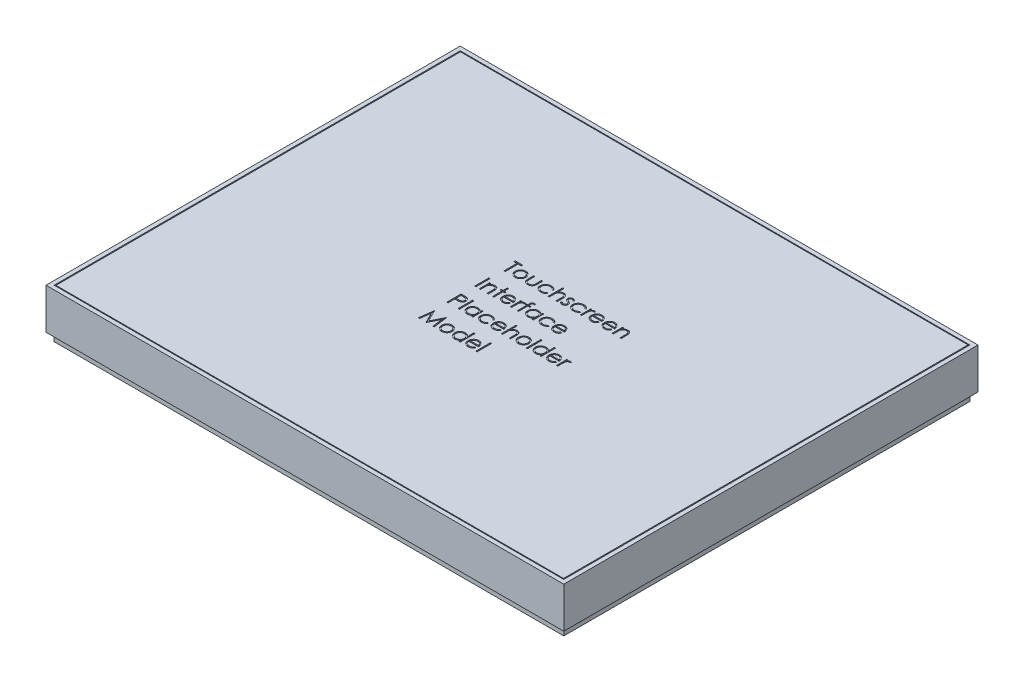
from build123d import *

# Parameters (mm, degrees)
SKETCH1_W           = 127
SKETCH1_H           = 101.6
BOSS_EXTRUDE1_DEPTH = 10
SKETCH2_W           = 125
SKETCH2_H           = 99.6
BOSS_EXTRUDE2_DEPTH = 2
SKETCH3_W           = 125
SKETCH3_H           = 99.6
SKETCH3_W_2         = 124.5
SKETCH3_H_2         = 99.2016
CUT_EXTRUDE1_DEPTH  = 0.25
SKETCH4_W           = 0.314102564
SKETCH4_H           = 3.5
SKETCH4_H_2         = 3.58974359
SKETCH4_W_2         = 0.314102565
SKETCH4_H_3         = 3.589743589
CUT_EXTRUDE2_DEPTH  = 0.25


with BuildPart() as part:
    # Sketch1 → Boss-Extrude1 (new body)
    with BuildSketch(Plane(origin=(0, 0, 0), x_dir=(1, 0, 0), z_dir=(0, 1, 0))):
        Rectangle(SKETCH1_W, SKETCH1_H)
    extrude(amount=BOSS_EXTRUDE1_DEPTH)

    # Sketch2 → Boss-Extrude2 (add)
    with BuildSketch(Plane.XZ):
        Rectangle(SKETCH2_W, SKETCH2_H)
    extrude(amount=BOSS_EXTRUDE2_DEPTH)

    # Sketch3 → Cut-Extrude1 (cut)
    with BuildSketch(Plane(origin=(0, 10, 0), x_dir=(1, 0, 0), z_dir=(0, 1, 0))):
        Rectangle(SKETCH3_W, SKETCH3_H)
        Rectangle(SKETCH3_W_2, SKETCH3_H_2, mode=Mode.SUBTRACT)
    extrude(amount=-CUT_EXTRUDE1_DEPTH, mode=Mode.SUBTRACT)

    # Sketch4 → Cut-Extrude2 (cut)
    # profile 1 of 36: a face of its own
    with BuildSketch(Plane(origin=(0, 10, 0), x_dir=(1, 0, 0), z_dir=(0, 1, 0))):
        Polygon((-11.148488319, 11.571467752), (-11.148488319, 11.930442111), (-9.308744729, 11.930442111), (-9.308744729, 11.571467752), (-10.071565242, 11.571467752), (-10.071565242, 8.430442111), (-10.385667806, 8.430442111), (-10.385667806, 11.571467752), align=None)
    # profile 2 of 36: a face of its own
    with BuildSketch(Plane(origin=(0, 10, 0), x_dir=(1, 0, 0), z_dir=(0, 1, 0))):
        with BuildLine():
            add(Edge.make_bspline(
                [(-7.624650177, 11.033006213), (-7.576658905, 11.031984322), (-7.482559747, 11.029980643), (-7.344751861, 11.008565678), (-7.213206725, 10.975818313), (-7.087420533, 10.930546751), (-6.969004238, 10.869864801), (-6.856232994, 10.79745551), (-6.749415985, 10.711672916), (-6.685392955, 10.645314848), (-6.65289537, 10.611632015)],
                knots=[0, 0, 0, 0, 1.054011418, 2.066658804, 3.057071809, 4.030435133, 4.997543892, 5.974964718, 6.972108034, 8, 8, 8, 8], degree=3))
            add(Edge.make_bspline(
                [(-6.65289537, 10.611632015), (-6.624913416, 10.579418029), (-6.569491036, 10.515613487), (-6.498425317, 10.412157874), (-6.437203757, 10.305017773), (-6.388140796, 10.192770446), (-6.349455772, 10.076395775), (-6.321990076, 9.955493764), (-6.305653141, 9.830331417), (-6.303450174, 9.745327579), (-6.302334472, 9.702277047)],
                knots=[0, 0, 0, 0, 1.025258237, 2.030674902, 3.01204498, 3.988269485, 4.97094183, 5.956517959, 6.965070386, 8, 8, 8, 8], degree=3))
            add(Edge.make_bspline(
                [(-6.302334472, 9.702277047), (-6.30331581, 9.658976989), (-6.305254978, 9.573414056), (-6.323598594, 9.44739469), (-6.35212968, 9.325199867), (-6.392961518, 9.207341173), (-6.445319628, 9.093458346), (-6.509210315, 8.984048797), (-6.585081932, 8.878896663), (-6.671085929, 8.778894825), (-6.766137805, 8.68672861), (-6.869253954, 8.606400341), (-6.978407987, 8.537578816), (-7.095051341, 8.482142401), (-7.218118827, 8.438432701), (-7.347875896, 8.407732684), (-7.484120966, 8.389171), (-7.577148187, 8.386787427), (-7.624650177, 8.385570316)],
                knots=[0, 0, 0, 0, 0.998656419, 1.973391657, 2.932242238, 3.890759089, 4.846373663, 5.82037756, 6.809684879, 7.83454468, 8.860553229, 9.859544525, 10.845671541, 11.83227036, 12.833544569, 13.85385346, 14.904124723, 16, 16, 16, 16], degree=3))
            add(Edge.make_bspline(
                [(-7.624650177, 8.385570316), (-7.672384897, 8.386791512), (-7.765875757, 8.389183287), (-7.902601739, 8.407660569), (-8.032591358, 8.438418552), (-8.155819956, 8.482286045), (-8.272964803, 8.537580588), (-8.3827513, 8.606192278), (-8.485951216, 8.686752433), (-8.5810232, 8.77888837), (-8.667021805, 8.878898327), (-8.742894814, 8.984048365), (-8.80678514, 9.093458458), (-8.859143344, 9.207341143), (-8.899975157, 9.325199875), (-8.928506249, 9.447394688), (-8.946849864, 9.573414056), (-8.948789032, 9.658976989), (-8.94977037, 9.702277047)],
                knots=[0, 0, 0, 0, 1.099876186, 2.154163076, 3.173186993, 4.173200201, 5.163417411, 6.152872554, 7.150605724, 8.17532212, 9.198891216, 10.186952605, 11.159729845, 12.11414092, 13.071450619, 14.029093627, 15.002601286, 16, 16, 16, 16], degree=3))
            add(Edge.make_bspline(
                [(-8.94977037, 9.702277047), (-8.948647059, 9.745093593), (-8.946423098, 9.829862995), (-8.930102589, 9.954790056), (-8.902744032, 10.075487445), (-8.864012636, 10.191412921), (-8.814497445, 10.303168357), (-8.754136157, 10.410573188), (-8.682345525, 10.513560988), (-8.627143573, 10.577283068), (-8.599209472, 10.609528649)],
                knots=[0, 0, 0, 0, 1.031353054, 2.041901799, 3.029428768, 4.008703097, 4.981709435, 5.96992636, 6.972712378, 8, 8, 8, 8], degree=3))
            add(Edge.make_bspline(
                [(-8.599209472, 10.609528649), (-8.566760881, 10.643503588), (-8.502945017, 10.710321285), (-8.39559629, 10.795853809), (-8.283102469, 10.869769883), (-8.163377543, 10.929246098), (-8.037694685, 10.976084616), (-7.905475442, 11.008650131), (-7.767199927, 11.029903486), (-7.672640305, 11.031961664), (-7.624650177, 11.033006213)],
                knots=[0, 0, 0, 0, 1.027980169, 2.021703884, 2.998553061, 3.971491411, 4.943284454, 5.930300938, 6.949603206, 8, 8, 8, 8], degree=3))
        make_face()
        with BuildLine():
            add(Edge.make_bspline(
                [(-7.626052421, 10.718903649), (-7.659990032, 10.717939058), (-7.726989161, 10.716034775), (-7.825608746, 10.70155087), (-7.9205489, 10.678603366), (-8.011989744, 10.64599931), (-8.099622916, 10.603900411), (-8.183532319, 10.552192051), (-8.263964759, 10.491559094), (-8.339346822, 10.422096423), (-8.408529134, 10.346217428), (-8.469007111, 10.265369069), (-8.520432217, 10.180862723), (-8.563272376, 10.092610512), (-8.595179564, 9.999718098), (-8.618352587, 9.903237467), (-8.632822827, 9.80297205), (-8.634709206, 9.734811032), (-8.635667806, 9.700173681)],
                knots=[0, 0, 0, 0, 1.021534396, 2.016698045, 2.994645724, 3.958388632, 4.93408049, 5.916473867, 6.921342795, 7.962252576, 8.998418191, 10.008913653, 10.997312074, 11.973003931, 12.956656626, 13.948281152, 14.957379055, 16, 16, 16, 16], degree=3))
            add(Edge.make_bspline(
                [(-8.635667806, 9.700173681), (-8.634060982, 9.655421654), (-8.630871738, 9.566597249), (-8.604936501, 9.435786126), (-8.561550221, 9.310204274), (-8.502962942, 9.190587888), (-8.429556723, 9.07991561), (-8.343069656, 8.981244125), (-8.244429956, 8.896058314), (-8.134813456, 8.825377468), (-8.016459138, 8.769217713), (-7.891202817, 8.729418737), (-7.760562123, 8.703547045), (-7.671281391, 8.70097557), (-7.626052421, 8.69967288)],
                knots=[0, 0, 0, 0, 1.016792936, 2.018143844, 3.017858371, 4.030088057, 5.03801393, 6.028138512, 7.003788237, 7.991172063, 8.984598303, 9.972568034, 10.972917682, 12, 12, 12, 12], degree=3))
            add(Edge.make_bspline(
                [(-7.626052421, 8.69967288), (-7.580826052, 8.70098316), (-7.491550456, 8.703569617), (-7.361091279, 8.729288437), (-7.236177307, 8.769392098), (-7.11794592, 8.825314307), (-7.008379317, 8.896326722), (-6.909030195, 8.980763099), (-6.823281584, 9.080176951), (-6.749947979, 9.190734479), (-6.690401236, 9.310018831), (-6.647218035, 9.435809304), (-6.621220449, 9.566591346), (-6.61803962, 9.655419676), (-6.616437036, 9.700173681)],
                knots=[0, 0, 0, 0, 1.02726834, 2.027799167, 3.010890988, 4.004497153, 4.992059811, 5.971914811, 6.958719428, 7.966827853, 8.981595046, 9.981490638, 10.983022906, 12, 12, 12, 12], degree=3))
            add(Edge.make_bspline(
                [(-6.616437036, 9.700173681), (-6.617395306, 9.734811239), (-6.619281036, 9.802972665), (-6.633756, 9.903235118), (-6.65691154, 9.999726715), (-6.688883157, 10.092578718), (-6.731537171, 10.181091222), (-6.783953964, 10.265120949), (-6.844184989, 10.346497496), (-6.91420211, 10.421851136), (-6.989505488, 10.491586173), (-7.069970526, 10.552215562), (-7.153755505, 10.603673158), (-7.241134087, 10.646359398), (-7.332586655, 10.678306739), (-7.427393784, 10.70168337), (-7.525592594, 10.715973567), (-7.592351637, 10.717920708), (-7.626052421, 10.718903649)],
                knots=[0, 0, 0, 0, 1.042956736, 2.052379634, 3.044323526, 4.02829302, 5.004299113, 5.996692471, 7.007513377, 8.048758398, 9.090003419, 10.095195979, 11.07790575, 12.047570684, 13.018257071, 13.989683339, 14.985167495, 16, 16, 16, 16], degree=3))
        make_face(mode=Mode.SUBTRACT)
    # profile 3 of 36: a face of its own
    with BuildSketch(Plane(origin=(0, 10, 0), x_dir=(1, 0, 0), z_dir=(0, 1, 0))):
        with BuildLine():
            Line((-5.719001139, 10.988134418), (-5.404898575, 10.988134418))
            Line((-5.404898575, 10.988134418), (-5.404898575, 9.801836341))
            add(Edge.make_bspline(
                [(-5.404898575, 9.801836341), (-5.40475667, 9.767013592), (-5.404485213, 9.700399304), (-5.402644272, 9.604544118), (-5.398314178, 9.517127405), (-5.392900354, 9.438098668), (-5.385938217, 9.367471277), (-5.377654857, 9.305491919), (-5.368396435, 9.251457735), (-5.359333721, 9.21891438), (-5.355118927, 9.20377945)],
                knots=[0, 0, 0, 0, 1.388932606, 2.656963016, 3.823490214, 4.879454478, 5.816252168, 6.653371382, 7.373723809, 8, 8, 8, 8], degree=3))
            add(Edge.make_bspline(
                [(-5.355118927, 9.20377945), (-5.348357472, 9.184756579), (-5.334975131, 9.147106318), (-5.310701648, 9.092717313), (-5.280673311, 9.042342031), (-5.247813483, 8.994037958), (-5.209914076, 8.949235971), (-5.167454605, 8.908011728), (-5.121856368, 8.868807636), (-5.054101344, 8.822422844), (-4.961442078, 8.772707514), (-4.839789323, 8.729811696), (-4.707885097, 8.704175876), (-4.616720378, 8.701201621), (-4.569862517, 8.69967288)],
                knots=[0, 0, 0, 0, 0.725840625, 1.436591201, 2.137033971, 2.831655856, 3.53531722, 4.242432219, 4.957935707, 5.694543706, 7.190802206, 8.724350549, 10.316345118, 12, 12, 12, 12], degree=3))
            add(Edge.make_bspline(
                [(-4.569862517, 8.69967288), (-4.52300901, 8.701234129), (-4.432356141, 8.704254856), (-4.301901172, 8.729038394), (-4.182649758, 8.770444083), (-4.075798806, 8.828251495), (-3.981832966, 8.898993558), (-3.903528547, 8.982002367), (-3.838921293, 9.074651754), (-3.810711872, 9.143776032), (-3.796525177, 9.178539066)],
                knots=[0, 0, 0, 0, 1.157059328, 2.238695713, 3.266970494, 4.264342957, 5.228770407, 6.160125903, 7.074715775, 8, 8, 8, 8], degree=3))
            add(Edge.make_bspline(
                [(-3.796525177, 9.178539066), (-3.792330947, 9.192505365), (-3.783058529, 9.22338144), (-3.773096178, 9.275761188), (-3.764121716, 9.338225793), (-3.75645854, 9.411184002), (-3.750993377, 9.494445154), (-3.748047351, 9.58798323), (-3.744719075, 9.69150459), (-3.744668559, 9.76397235), (-3.744642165, 9.801836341)],
                knots=[0, 0, 0, 0, 0.557542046, 1.232589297, 2.036731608, 2.971723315, 4.038036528, 5.22795436, 6.551621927, 8, 8, 8, 8], degree=3))
            Line((-3.744642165, 9.801836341), (-3.744642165, 10.988134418))
            Line((-3.744642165, 10.988134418), (-3.430539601, 10.988134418))
            Line((-3.430539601, 10.988134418), (-3.430539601, 9.742942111))
            add(Edge.make_bspline(
                [(-3.430539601, 9.742942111), (-3.430981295, 9.700634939), (-3.431838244, 9.618553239), (-3.437345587, 9.499269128), (-3.4467952, 9.388106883), (-3.461137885, 9.285007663), (-3.47800356, 9.190050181), (-3.499759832, 9.103112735), (-3.52573807, 9.024463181), (-3.555043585, 8.952721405), (-3.589665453, 8.88767451), (-3.626492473, 8.825938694), (-3.669017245, 8.769045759), (-3.713787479, 8.714163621), (-3.763589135, 8.664022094), (-3.817488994, 8.617470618), (-3.874728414, 8.573797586), (-3.936577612, 8.534706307), (-4.002133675, 8.499489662), (-4.071477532, 8.468273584), (-4.14545853, 8.443571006), (-4.223122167, 8.422260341), (-4.304848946, 8.405545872), (-4.39056008, 8.393759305), (-4.480226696, 8.386533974), (-4.541336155, 8.385896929), (-4.572667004, 8.385570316)],
                knots=[0, 0, 0, 0, 1.493040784, 2.896703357, 4.213163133, 5.428574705, 6.569057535, 7.615249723, 8.588095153, 9.490268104, 10.346124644, 11.18633936, 12.024365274, 12.850166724, 13.684164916, 14.514361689, 15.362232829, 16.222528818, 17.093394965, 17.986930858, 18.902426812, 19.842810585, 20.827885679, 21.843828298, 22.894529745, 24, 24, 24, 24], degree=3))
            add(Edge.make_bspline(
                [(-4.572667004, 8.385570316), (-4.603763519, 8.385910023), (-4.664871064, 8.386577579), (-4.754542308, 8.393719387), (-4.840490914, 8.405527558), (-4.922411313, 8.422382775), (-5.00038571, 8.443421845), (-5.07472995, 8.46842538), (-5.144573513, 8.499505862), (-5.210755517, 8.53448342), (-5.272757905, 8.574048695), (-5.330866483, 8.617416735), (-5.385003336, 8.664522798), (-5.435180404, 8.715170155), (-5.48069338, 8.769987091), (-5.522109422, 8.828532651), (-5.560066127, 8.89022674), (-5.594418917, 8.956289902), (-5.623930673, 9.028861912), (-5.649985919, 9.109159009), (-5.671296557, 9.198061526), (-5.688639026, 9.295493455), (-5.702590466, 9.400988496), (-5.712276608, 9.515156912), (-5.717692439, 9.637720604), (-5.718555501, 9.722370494), (-5.719001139, 9.76607913)],
                knots=[0, 0, 0, 0, 1.083640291, 2.129454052, 3.13281866, 4.105697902, 5.042300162, 5.946461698, 6.836384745, 7.703652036, 8.553297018, 9.397182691, 10.228592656, 11.052265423, 11.879314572, 12.708807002, 13.549817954, 14.402308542, 15.300838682, 16.27712199, 17.341985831, 18.484375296, 19.725102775, 21.0496083, 22.476576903, 24, 24, 24, 24], degree=3))
            Line((-5.719001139, 9.76607913), (-5.719001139, 10.988134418))
        make_face()
    # profile 4 of 36: a face of its own
    with BuildSketch(Plane(origin=(0, 10, 0), x_dir=(1, 0, 0), z_dir=(0, 1, 0))):
        with BuildLine():
            Line((-0.19977037, 10.433547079), (-0.462691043, 10.2701857))
            add(Edge.make_bspline(
                [(-0.462691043, 10.2701857), (-0.491520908, 10.306014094), (-0.548267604, 10.376536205), (-0.64680684, 10.467546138), (-0.751818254, 10.54571318), (-0.865096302, 10.609416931), (-0.986482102, 10.658638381), (-1.115496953, 10.693468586), (-1.252122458, 10.715172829), (-1.345787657, 10.717639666), (-1.393780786, 10.718903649)],
                knots=[0, 0, 0, 0, 1.026593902, 2.0206758, 2.988051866, 3.946915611, 4.916868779, 5.907761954, 6.927957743, 8, 8, 8, 8], degree=3))
            add(Edge.make_bspline(
                [(-1.393780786, 10.718903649), (-1.432139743, 10.717846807), (-1.507686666, 10.715765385), (-1.618592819, 10.702754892), (-1.724235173, 10.679112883), (-1.825275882, 10.647961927), (-1.9209963, 10.606211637), (-2.011647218, 10.555401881), (-2.098032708, 10.49635184), (-2.17764945, 10.427941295), (-2.250478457, 10.353542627), (-2.313577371, 10.273788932), (-2.368514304, 10.191069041), (-2.41162026, 10.103317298), (-2.446895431, 10.012541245), (-2.470102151, 9.917027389), (-2.485566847, 9.817999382), (-2.487336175, 9.750481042), (-2.488231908, 9.716299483)],
                knots=[0, 0, 0, 0, 1.112346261, 2.190735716, 3.231507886, 4.247384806, 5.251966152, 6.253067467, 7.256802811, 8.280671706, 9.291813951, 10.270744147, 11.225547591, 12.165006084, 13.100104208, 14.043489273, 15.009504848, 16, 16, 16, 16], degree=3))
            add(Edge.make_bspline(
                [(-2.488231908, 9.716299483), (-2.486452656, 9.671530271), (-2.482918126, 9.582595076), (-2.455216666, 9.451316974), (-2.409872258, 9.324393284), (-2.347814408, 9.202725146), (-2.269337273, 9.090130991), (-2.17716471, 8.989147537), (-2.071245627, 8.901731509), (-1.952513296, 8.829258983), (-1.823755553, 8.770997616), (-1.686365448, 8.729490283), (-1.541465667, 8.70443791), (-1.44225892, 8.701281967), (-1.391677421, 8.69967288)],
                knots=[0, 0, 0, 0, 0.966302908, 1.919585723, 2.883856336, 3.870342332, 4.860282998, 5.839159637, 6.814385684, 7.815993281, 8.834850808, 9.858348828, 10.908058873, 12, 12, 12, 12], degree=3))
            add(Edge.make_bspline(
                [(-1.391677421, 8.69967288), (-1.345322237, 8.700972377), (-1.254221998, 8.703526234), (-1.121054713, 8.725055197), (-0.994274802, 8.760298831), (-0.873886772, 8.809446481), (-0.760110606, 8.872973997), (-0.653681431, 8.951333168), (-0.552481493, 9.042269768), (-0.492984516, 9.112587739), (-0.462691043, 9.148390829)],
                knots=[0, 0, 0, 0, 1.039848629, 2.043578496, 3.018386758, 3.987534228, 4.954977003, 5.934852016, 6.948509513, 8, 8, 8, 8], degree=3))
            Line((-0.462691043, 9.148390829), (-0.19977037, 8.975914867))
            add(Edge.make_bspline(
                [(-0.19977037, 8.975914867), (-0.215358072, 8.95302414), (-0.246481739, 8.907318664), (-0.298509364, 8.842874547), (-0.354629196, 8.782552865), (-0.414622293, 8.726434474), (-0.477705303, 8.673176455), (-0.546033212, 8.625324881), (-0.617402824, 8.580190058), (-0.692651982, 8.539577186), (-0.77100268, 8.503070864), (-0.852344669, 8.471679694), (-0.936324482, 8.444709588), (-1.023040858, 8.423272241), (-1.112664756, 8.406161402), (-1.204964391, 8.394807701), (-1.299907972, 8.38633242), (-1.364080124, 8.385826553), (-1.396585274, 8.385570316)],
                knots=[0, 0, 0, 0, 0.954134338, 1.905101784, 2.851144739, 3.791306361, 4.734911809, 5.6936923, 6.663572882, 7.643865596, 8.638447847, 9.640600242, 10.646758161, 11.676244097, 12.717260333, 13.78922464, 14.880174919, 16, 16, 16, 16], degree=3))
            add(Edge.make_bspline(
                [(-1.396585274, 8.385570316), (-1.446196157, 8.386461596), (-1.543433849, 8.388208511), (-1.685756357, 8.407416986), (-1.821770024, 8.436374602), (-1.951428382, 8.477938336), (-2.074751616, 8.531443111), (-2.191624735, 8.596800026), (-2.301660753, 8.674551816), (-2.403771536, 8.763314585), (-2.497552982, 8.859555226), (-2.578079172, 8.963405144), (-2.647924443, 9.071046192), (-2.704011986, 9.184855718), (-2.748658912, 9.303321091), (-2.779163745, 9.427391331), (-2.798893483, 9.556043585), (-2.801176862, 9.643776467), (-2.802334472, 9.688254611)],
                knots=[0, 0, 0, 0, 1.1129367, 2.181364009, 3.217532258, 4.231199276, 5.232079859, 6.230262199, 7.231623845, 8.250719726, 9.263571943, 10.242672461, 11.195837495, 12.138959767, 13.085126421, 14.0317438, 15.002148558, 16, 16, 16, 16], degree=3))
            add(Edge.make_bspline(
                [(-2.802334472, 9.688254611), (-2.801893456, 9.718433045), (-2.801016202, 9.778462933), (-2.790954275, 9.867557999), (-2.777955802, 9.955466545), (-2.755930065, 10.041074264), (-2.730489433, 10.125679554), (-2.698013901, 10.208262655), (-2.659918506, 10.289207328), (-2.616666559, 10.368305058), (-2.567977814, 10.444254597), (-2.514096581, 10.516008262), (-2.457052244, 10.584428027), (-2.394176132, 10.647151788), (-2.328136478, 10.706687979), (-2.257064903, 10.761446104), (-2.181369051, 10.811587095), (-2.102185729, 10.85803811), (-2.019561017, 10.899397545), (-1.933994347, 10.935030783), (-1.846001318, 10.965483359), (-1.755441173, 10.989592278), (-1.662915, 11.009809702), (-1.567693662, 11.022527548), (-1.47014144, 11.031513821), (-1.404085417, 11.032504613), (-1.370643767, 11.033006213)],
                knots=[0, 0, 0, 0, 0.990994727, 1.971252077, 2.943264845, 3.907940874, 4.872158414, 5.844625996, 6.82015047, 7.809835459, 8.804511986, 9.781214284, 10.756496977, 11.728388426, 12.696359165, 13.676225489, 14.672885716, 15.677705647, 16.690706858, 17.706033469, 18.721040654, 19.747369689, 20.783475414, 21.830280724, 22.901553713, 24, 24, 24, 24], degree=3))
            add(Edge.make_bspline(
                [(-1.370643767, 11.033006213), (-1.328763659, 11.032084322), (-1.24521278, 11.030245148), (-1.121272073, 11.014766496), (-0.999156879, 10.99143008), (-0.881009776, 10.95685725), (-0.768263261, 10.914993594), (-0.662727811, 10.86798088), (-0.566887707, 10.813386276), (-0.478960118, 10.753666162), (-0.398780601, 10.686305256), (-0.325526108, 10.610498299), (-0.257694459, 10.52663982), (-0.219237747, 10.464834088), (-0.19977037, 10.433547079)],
                knots=[0, 0, 0, 0, 1.095225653, 2.184976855, 3.262915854, 4.344593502, 5.400796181, 6.407717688, 7.363229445, 8.282371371, 9.184954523, 10.097238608, 11.036792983, 12, 12, 12, 12], degree=3))
        make_face()
    # profile 5 of 36: a face of its own
    with BuildSketch(Plane(origin=(0, 10, 0), x_dir=(1, 0, 0), z_dir=(0, 1, 0))):
        with BuildLine():
            Line((0.428434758, 12.0201857), (0.742537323, 12.0201857))
            Line((0.742537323, 12.0201857), (0.742537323, 10.505061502))
            add(Edge.make_bspline(
                [(0.742537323, 10.505061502), (0.776254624, 10.547205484), (0.841903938, 10.629261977), (0.952400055, 10.736323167), (1.065870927, 10.829121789), (1.186235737, 10.902992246), (1.311286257, 10.961348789), (1.441549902, 11.002736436), (1.577050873, 11.028187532), (1.669076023, 11.03138595), (1.715694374, 11.033006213)],
                knots=[0, 0, 0, 0, 1.125788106, 2.19196713, 3.20547328, 4.180437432, 5.132270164, 6.079753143, 7.027236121, 8, 8, 8, 8], degree=3))
            add(Edge.make_bspline(
                [(1.715694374, 11.033006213), (1.763024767, 11.031260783), (1.855661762, 11.027844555), (1.990543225, 11.000831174), (2.1165041, 10.954673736), (2.233169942, 10.891506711), (2.33799464, 10.812833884), (2.430844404, 10.722002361), (2.506685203, 10.616728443), (2.55828432, 10.519472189), (2.591857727, 10.432933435), (2.613109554, 10.358696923), (2.631128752, 10.275975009), (2.646828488, 10.184810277), (2.657292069, 10.084765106), (2.665696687, 9.976290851), (2.671673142, 9.859393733), (2.671904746, 9.778473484), (2.672024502, 9.736632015)],
                knots=[0, 0, 0, 0, 1.235656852, 2.418478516, 3.575258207, 4.727955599, 5.870717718, 6.98870536, 8.107142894, 9.245821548, 9.854588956, 10.528768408, 11.260415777, 12.065282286, 12.943670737, 13.886611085, 14.907229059, 16, 16, 16, 16], degree=3))
            Line((2.672024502, 9.736632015), (2.672024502, 8.430442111))
            Line((2.672024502, 8.430442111), (2.357921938, 8.430442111))
            Line((2.357921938, 8.430442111), (2.357921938, 9.633567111))
            add(Edge.make_bspline(
                [(2.357921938, 9.633567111), (2.357731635, 9.66838978), (2.357367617, 9.734999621), (2.356164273, 9.830365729), (2.353478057, 9.916861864), (2.349137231, 9.994210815), (2.344571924, 10.062520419), (2.338288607, 10.121691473), (2.330978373, 10.171805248), (2.324409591, 10.201969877), (2.321463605, 10.2154982)],
                knots=[0, 0, 0, 0, 1.430932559, 2.737130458, 3.918967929, 4.986496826, 5.920444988, 6.731744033, 7.431208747, 8, 8, 8, 8], degree=3))
            add(Edge.make_bspline(
                [(2.321463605, 10.2154982), (2.310039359, 10.255192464), (2.288076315, 10.331504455), (2.237028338, 10.435166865), (2.173269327, 10.523551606), (2.095422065, 10.595465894), (2.004863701, 10.651877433), (1.901003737, 10.690945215), (1.784819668, 10.715192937), (1.702968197, 10.717632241), (1.660305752, 10.718903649)],
                knots=[0, 0, 0, 0, 1.090059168, 2.095632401, 3.037101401, 3.955032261, 4.878929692, 5.839099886, 6.873700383, 8, 8, 8, 8], degree=3))
            add(Edge.make_bspline(
                [(1.660305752, 10.718903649), (1.635037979, 10.718427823), (1.585033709, 10.717486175), (1.510885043, 10.708032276), (1.438955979, 10.692583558), (1.368553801, 10.671679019), (1.301170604, 10.643233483), (1.234842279, 10.610303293), (1.17144807, 10.569995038), (1.109862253, 10.524769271), (1.05254472, 10.474699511), (0.999217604, 10.421852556), (0.951679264, 10.365577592), (0.908610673, 10.306777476), (0.871432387, 10.244645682), (0.838979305, 10.179781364), (0.811443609, 10.112099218), (0.797760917, 10.065124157), (0.790914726, 10.041619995)],
                knots=[0, 0, 0, 0, 1.024319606, 2.027102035, 3.025350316, 4.005802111, 5.00026367, 5.987881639, 7.005602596, 8.042517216, 9.083927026, 10.089214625, 11.084353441, 12.06828073, 13.041928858, 14.016821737, 15.00770877, 16, 16, 16, 16], degree=3))
            add(Edge.make_bspline(
                [(0.790914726, 10.041619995), (0.786975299, 10.024599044), (0.778390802, 9.987508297), (0.769075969, 9.926333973), (0.760738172, 9.855247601), (0.753689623, 9.774357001), (0.749366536, 9.683365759), (0.744708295, 9.5828948), (0.742974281, 9.472314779), (0.742687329, 9.395419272), (0.742537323, 9.355221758)],
                knots=[0, 0, 0, 0, 0.607992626, 1.324890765, 2.152360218, 3.099583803, 4.150613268, 5.323148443, 6.60066238, 8, 8, 8, 8], degree=3))
            Line((0.742537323, 9.355221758), (0.742537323, 8.430442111))
            Line((0.742537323, 8.430442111), (0.428434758, 8.430442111))
            Line((0.428434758, 8.430442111), (0.428434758, 12.0201857))
        make_face()
    # profile 6 of 36: a face of its own
    with BuildSketch(Plane(origin=(0, 10, 0), x_dir=(1, 0, 0), z_dir=(0, 1, 0))):
        with BuildLine():
            Line((4.601511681, 10.669124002), (4.388370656, 10.44967288))
            add(Edge.make_bspline(
                [(4.388370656, 10.44967288), (4.369980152, 10.470986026), (4.334525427, 10.512075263), (4.278293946, 10.56701233), (4.222270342, 10.613149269), (4.167221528, 10.652101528), (4.111763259, 10.681550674), (4.056546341, 10.703045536), (4.001513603, 10.716347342), (3.964727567, 10.718061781), (3.946663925, 10.718903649)],
                knots=[0, 0, 0, 0, 1.26578478, 2.440284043, 3.530471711, 4.527705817, 5.468200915, 6.346673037, 7.188140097, 8, 8, 8, 8], degree=3))
            add(Edge.make_bspline(
                [(3.946663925, 10.718903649), (3.924524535, 10.717828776), (3.880957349, 10.715713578), (3.818531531, 10.694600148), (3.760580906, 10.66219141), (3.710423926, 10.616222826), (3.667936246, 10.563458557), (3.636922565, 10.504462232), (3.617956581, 10.441014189), (3.615551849, 10.396984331), (3.614332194, 10.374652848)],
                knots=[0, 0, 0, 0, 0.99966794, 1.967205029, 2.953328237, 3.988086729, 5.028030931, 6.008226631, 6.989793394, 8, 8, 8, 8], degree=3))
            add(Edge.make_bspline(
                [(3.614332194, 10.374652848), (3.615443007, 10.354440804), (3.6176615, 10.314073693), (3.634908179, 10.254525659), (3.662374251, 10.196468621), (3.688044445, 10.160905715), (3.701271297, 10.142581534)],
                knots=[0, 0, 0, 0, 0.960159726, 1.917612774, 2.927026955, 4, 4, 4, 4], degree=3))
            add(Edge.make_bspline(
                [(3.701271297, 10.142581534), (3.709234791, 10.132796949), (3.726184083, 10.111971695), (3.757992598, 10.083067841), (3.794015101, 10.051125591), (3.837335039, 10.019188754), (3.886086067, 9.985557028), (3.941325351, 9.951554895), (4.001299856, 9.91459047), (4.044237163, 9.891146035), (4.066555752, 9.878959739)],
                knots=[0, 0, 0, 0, 0.66740084, 1.420478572, 2.27185888, 3.217733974, 4.268547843, 5.408967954, 6.65319498, 8, 8, 8, 8], degree=3))
            add(Edge.make_bspline(
                [(4.066555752, 9.878959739), (4.093769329, 9.863714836), (4.146336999, 9.834266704), (4.221029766, 9.788557), (4.288816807, 9.743125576), (4.350272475, 9.698458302), (4.404214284, 9.653305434), (4.452278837, 9.609397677), (4.49326728, 9.565408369), (4.516221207, 9.534675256), (4.527192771, 9.51998538)],
                knots=[0, 0, 0, 0, 1.27191281, 2.456916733, 3.569705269, 4.599008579, 5.553216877, 6.436649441, 7.252746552, 8, 8, 8, 8], degree=3))
            add(Edge.make_bspline(
                [(4.527192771, 9.51998538), (4.545403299, 9.490319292), (4.581645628, 9.431278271), (4.619703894, 9.334059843), (4.641764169, 9.230949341), (4.644826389, 9.160417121), (4.646383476, 9.124552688)],
                knots=[0, 0, 0, 0, 0.995354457, 1.980940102, 2.973342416, 4, 4, 4, 4], degree=3))
            add(Edge.make_bspline(
                [(4.646383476, 9.124552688), (4.645663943, 9.099283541), (4.644246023, 9.049487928), (4.634387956, 8.976153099), (4.617432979, 8.906018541), (4.594339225, 8.838323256), (4.563154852, 8.774364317), (4.526607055, 8.712528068), (4.482732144, 8.654152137), (4.432640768, 8.599313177), (4.377795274, 8.549227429), (4.319289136, 8.505203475), (4.257050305, 8.468629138), (4.191523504, 8.438363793), (4.122559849, 8.414295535), (4.05014856, 8.397633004), (3.974519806, 8.387660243), (3.923089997, 8.386275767), (3.896884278, 8.385570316)],
                knots=[0, 0, 0, 0, 1.032770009, 2.035186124, 3.017557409, 3.978232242, 4.952395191, 5.920591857, 6.910227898, 7.931268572, 8.952309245, 9.941945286, 10.918353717, 11.897095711, 12.887975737, 13.898235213, 14.929059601, 16, 16, 16, 16], degree=3))
            add(Edge.make_bspline(
                [(3.896884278, 8.385570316), (3.861517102, 8.386563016), (3.791274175, 8.388534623), (3.687384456, 8.407040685), (3.585863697, 8.435836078), (3.487480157, 8.475552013), (3.394434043, 8.525702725), (3.309303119, 8.585765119), (3.231791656, 8.653755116), (3.187673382, 8.705868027), (3.165614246, 8.731924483)],
                knots=[0, 0, 0, 0, 1.013940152, 2.01379169, 3.017749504, 4.037548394, 5.051665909, 6.043208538, 7.021604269, 8, 8, 8, 8], degree=3))
            Line((3.165614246, 8.731924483), (3.373847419, 8.968903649))
            add(Edge.make_bspline(
                [(3.373847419, 8.968903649), (3.393619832, 8.947548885), (3.431951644, 8.906149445), (3.493252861, 8.851025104), (3.555632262, 8.804823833), (3.618466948, 8.766180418), (3.682687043, 8.736405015), (3.747932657, 8.715486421), (3.814071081, 8.702042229), (3.858493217, 8.700463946), (3.880758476, 8.69967288)],
                knots=[0, 0, 0, 0, 1.179806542, 2.287233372, 3.337373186, 4.324005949, 5.273901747, 6.200048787, 7.097828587, 8, 8, 8, 8], degree=3))
            add(Edge.make_bspline(
                [(3.880758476, 8.69967288), (3.911076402, 8.701043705), (3.970312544, 8.703722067), (4.055156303, 8.728039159), (4.133494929, 8.76616911), (4.201518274, 8.820253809), (4.259420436, 8.883209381), (4.30134861, 8.954123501), (4.327624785, 9.030914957), (4.330710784, 9.08414726), (4.332280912, 9.111231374)],
                knots=[0, 0, 0, 0, 1.072336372, 2.095165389, 3.102688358, 4.141489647, 5.156069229, 6.117746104, 7.042326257, 8, 8, 8, 8], degree=3))
            add(Edge.make_bspline(
                [(4.332280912, 9.111231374), (4.331194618, 9.133540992), (4.329049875, 9.177588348), (4.312206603, 9.241338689), (4.285593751, 9.30180797), (4.259389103, 9.337197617), (4.246042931, 9.355221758)],
                knots=[0, 0, 0, 0, 1.013901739, 2.00181326, 2.98231254, 4, 4, 4, 4], degree=3))
            add(Edge.make_bspline(
                [(4.246042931, 9.355221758), (4.238020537, 9.36425712), (4.220544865, 9.383939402), (4.188489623, 9.412364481), (4.150107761, 9.44300258), (4.104967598, 9.475334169), (4.052978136, 9.508932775), (3.993928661, 9.543622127), (3.928628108, 9.581049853), (3.882457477, 9.605869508), (3.858322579, 9.618843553)],
                knots=[0, 0, 0, 0, 0.615000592, 1.339693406, 2.178160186, 3.116406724, 4.166410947, 5.330106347, 6.604359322, 8, 8, 8, 8], degree=3))
            add(Edge.make_bspline(
                [(3.858322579, 9.618843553), (3.832275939, 9.633382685), (3.781763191, 9.661578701), (3.7102159, 9.705494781), (3.645668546, 9.750162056), (3.586567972, 9.793074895), (3.534406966, 9.836495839), (3.489391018, 9.880473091), (3.449747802, 9.923233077), (3.42780039, 9.953530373), (3.41731697, 9.968002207)],
                knots=[0, 0, 0, 0, 1.262093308, 2.447601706, 3.550203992, 4.582594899, 5.537233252, 6.418365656, 7.244515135, 8, 8, 8, 8], degree=3))
            add(Edge.make_bspline(
                [(3.41731697, 9.968002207), (3.39918637, 9.997147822), (3.362918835, 10.055449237), (3.327703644, 10.152759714), (3.303497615, 10.255204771), (3.301335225, 10.325891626), (3.30022963, 10.362032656)],
                knots=[0, 0, 0, 0, 0.985009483, 1.970363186, 2.962279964, 4, 4, 4, 4], degree=3))
            add(Edge.make_bspline(
                [(3.30022963, 10.362032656), (3.300763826, 10.385658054), (3.301809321, 10.431896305), (3.310153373, 10.499835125), (3.325345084, 10.564383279), (3.344400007, 10.626510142), (3.370883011, 10.685012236), (3.402528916, 10.740669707), (3.439716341, 10.793405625), (3.482559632, 10.842408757), (3.529666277, 10.886918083), (3.580561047, 10.925716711), (3.634099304, 10.958823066), (3.690507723, 10.986588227), (3.750328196, 11.007589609), (3.813142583, 11.022046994), (3.878823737, 11.031702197), (3.923724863, 11.032565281), (3.946663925, 11.033006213)],
                knots=[0, 0, 0, 0, 1.087655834, 2.128696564, 3.144119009, 4.137814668, 5.115653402, 6.093965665, 7.082169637, 8.081268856, 9.086088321, 10.061021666, 11.022561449, 11.980240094, 12.950172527, 13.934149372, 14.944599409, 16, 16, 16, 16], degree=3))
            add(Edge.make_bspline(
                [(3.946663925, 11.033006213), (3.973855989, 11.031901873), (4.02875021, 11.029672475), (4.111104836, 11.011966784), (4.193338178, 10.98283368), (4.275661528, 10.942597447), (4.357471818, 10.890530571), (4.439488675, 10.827601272), (4.522696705, 10.754223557), (4.574653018, 10.698124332), (4.601511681, 10.669124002)],
                knots=[0, 0, 0, 0, 0.845714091, 1.707292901, 2.609013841, 3.555613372, 4.552488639, 5.621697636, 6.770543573, 8, 8, 8, 8], degree=3))
        make_face()
    # profile 7 of 36: a face of its own
    with BuildSketch(Plane(origin=(0, 10, 0), x_dir=(1, 0, 0), z_dir=(0, 1, 0))):
        with BuildLine():
            Line((7.787409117, 10.433547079), (7.524488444, 10.2701857))
            add(Edge.make_bspline(
                [(7.524488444, 10.2701857), (7.495658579, 10.306014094), (7.438911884, 10.376536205), (7.340372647, 10.467546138), (7.235361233, 10.54571318), (7.122083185, 10.609416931), (7.000697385, 10.658638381), (6.871682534, 10.693468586), (6.735057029, 10.715172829), (6.64139183, 10.717639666), (6.593398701, 10.718903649)],
                knots=[0, 0, 0, 0, 1.026593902, 2.0206758, 2.988051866, 3.946915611, 4.916868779, 5.907761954, 6.927957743, 8, 8, 8, 8], degree=3))
            add(Edge.make_bspline(
                [(6.593398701, 10.718903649), (6.555039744, 10.717846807), (6.479492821, 10.715765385), (6.368586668, 10.702754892), (6.262944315, 10.679112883), (6.161903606, 10.647961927), (6.066183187, 10.606211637), (5.975532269, 10.555401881), (5.889146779, 10.49635184), (5.809530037, 10.427941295), (5.73670103, 10.353542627), (5.673602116, 10.273788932), (5.618665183, 10.191069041), (5.575559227, 10.103317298), (5.540284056, 10.012541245), (5.517077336, 9.917027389), (5.501612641, 9.817999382), (5.499843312, 9.750481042), (5.498947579, 9.716299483)],
                knots=[0, 0, 0, 0, 1.112346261, 2.190735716, 3.231507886, 4.247384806, 5.251966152, 6.253067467, 7.256802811, 8.280671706, 9.291813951, 10.270744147, 11.225547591, 12.165006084, 13.100104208, 14.043489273, 15.009504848, 16, 16, 16, 16], degree=3))
            add(Edge.make_bspline(
                [(5.498947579, 9.716299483), (5.500726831, 9.671530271), (5.504261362, 9.582595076), (5.531962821, 9.451316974), (5.577307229, 9.324393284), (5.639365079, 9.202725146), (5.717842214, 9.090130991), (5.810014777, 8.989147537), (5.91593386, 8.901731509), (6.034666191, 8.829258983), (6.163423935, 8.770997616), (6.300814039, 8.729490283), (6.44571382, 8.70443791), (6.544920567, 8.701281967), (6.595502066, 8.69967288)],
                knots=[0, 0, 0, 0, 0.966302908, 1.919585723, 2.883856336, 3.870342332, 4.860282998, 5.839159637, 6.814385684, 7.815993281, 8.834850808, 9.858348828, 10.908058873, 12, 12, 12, 12], degree=3))
            add(Edge.make_bspline(
                [(6.595502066, 8.69967288), (6.64185725, 8.700972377), (6.732957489, 8.703526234), (6.866124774, 8.725055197), (6.992904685, 8.760298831), (7.113292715, 8.809446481), (7.227068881, 8.872973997), (7.333498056, 8.951333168), (7.434697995, 9.042269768), (7.494194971, 9.112587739), (7.524488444, 9.148390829)],
                knots=[0, 0, 0, 0, 1.039848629, 2.043578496, 3.018386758, 3.987534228, 4.954977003, 5.934852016, 6.948509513, 8, 8, 8, 8], degree=3))
            Line((7.524488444, 9.148390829), (7.787409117, 8.975914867))
            add(Edge.make_bspline(
                [(7.787409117, 8.975914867), (7.771821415, 8.95302414), (7.740697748, 8.907318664), (7.688670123, 8.842874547), (7.632550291, 8.782552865), (7.572557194, 8.726434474), (7.509474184, 8.673176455), (7.441146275, 8.625324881), (7.369776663, 8.580190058), (7.294527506, 8.539577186), (7.216176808, 8.503070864), (7.134834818, 8.471679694), (7.050855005, 8.444709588), (6.964138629, 8.423272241), (6.874514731, 8.406161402), (6.782215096, 8.394807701), (6.687271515, 8.38633242), (6.623099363, 8.385826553), (6.590594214, 8.385570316)],
                knots=[0, 0, 0, 0, 0.954134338, 1.905101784, 2.851144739, 3.791306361, 4.734911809, 5.6936923, 6.663572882, 7.643865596, 8.638447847, 9.640600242, 10.646758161, 11.676244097, 12.717260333, 13.78922464, 14.880174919, 16, 16, 16, 16], degree=3))
            add(Edge.make_bspline(
                [(6.590594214, 8.385570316), (6.54098333, 8.386461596), (6.443745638, 8.388208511), (6.30142313, 8.407416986), (6.165409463, 8.436374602), (6.035751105, 8.477938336), (5.912427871, 8.531443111), (5.795554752, 8.596800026), (5.685518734, 8.674551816), (5.583407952, 8.763314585), (5.489626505, 8.859555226), (5.409100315, 8.963405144), (5.339255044, 9.071046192), (5.283167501, 9.184855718), (5.238520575, 9.303321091), (5.208015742, 9.427391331), (5.188286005, 9.556043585), (5.186002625, 9.643776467), (5.184845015, 9.688254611)],
                knots=[0, 0, 0, 0, 1.1129367, 2.181364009, 3.217532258, 4.231199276, 5.232079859, 6.230262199, 7.231623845, 8.250719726, 9.263571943, 10.242672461, 11.195837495, 12.138959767, 13.085126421, 14.0317438, 15.002148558, 16, 16, 16, 16], degree=3))
            add(Edge.make_bspline(
                [(5.184845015, 9.688254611), (5.185286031, 9.718433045), (5.186163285, 9.778462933), (5.196225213, 9.867557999), (5.209223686, 9.955466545), (5.231249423, 10.041074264), (5.256690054, 10.125679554), (5.289165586, 10.208262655), (5.327260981, 10.289207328), (5.370512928, 10.368305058), (5.419201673, 10.444254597), (5.473082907, 10.516008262), (5.530127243, 10.584428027), (5.593003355, 10.647151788), (5.659043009, 10.706687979), (5.730114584, 10.761446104), (5.805810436, 10.811587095), (5.884993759, 10.85803811), (5.96761847, 10.899397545), (6.05318514, 10.935030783), (6.14117817, 10.965483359), (6.231738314, 10.989592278), (6.324264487, 11.009809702), (6.419485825, 11.022527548), (6.517038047, 11.031513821), (6.58309407, 11.032504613), (6.61653572, 11.033006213)],
                knots=[0, 0, 0, 0, 0.990994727, 1.971252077, 2.943264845, 3.907940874, 4.872158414, 5.844625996, 6.82015047, 7.809835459, 8.804511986, 9.781214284, 10.756496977, 11.728388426, 12.696359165, 13.676225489, 14.672885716, 15.677705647, 16.690706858, 17.706033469, 18.721040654, 19.747369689, 20.783475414, 21.830280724, 22.901553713, 24, 24, 24, 24], degree=3))
            add(Edge.make_bspline(
                [(6.61653572, 11.033006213), (6.658415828, 11.032084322), (6.741966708, 11.030245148), (6.865907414, 11.014766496), (6.988022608, 10.99143008), (7.106169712, 10.95685725), (7.218916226, 10.914993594), (7.324451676, 10.86798088), (7.42029178, 10.813386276), (7.508219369, 10.753666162), (7.588398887, 10.686305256), (7.661653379, 10.610498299), (7.729485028, 10.52663982), (7.76794174, 10.464834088), (7.787409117, 10.433547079)],
                knots=[0, 0, 0, 0, 1.095225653, 2.184976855, 3.262915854, 4.344593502, 5.400796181, 6.407717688, 7.363229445, 8.282371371, 9.184954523, 10.097238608, 11.036792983, 12, 12, 12, 12], degree=3))
        make_face()
    # profile 8 of 36: a face of its own
    with BuildSketch(Plane(origin=(0, 10, 0), x_dir=(1, 0, 0), z_dir=(0, 1, 0))):
        with BuildLine():
            Line((8.325870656, 10.988134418), (8.63997322, 10.988134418))
            Line((8.63997322, 10.988134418), (8.63997322, 10.611632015))
            add(Edge.make_bspline(
                [(8.63997322, 10.611632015), (8.663161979, 10.646687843), (8.7075103, 10.713731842), (8.781223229, 10.802401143), (8.85672656, 10.87581619), (8.934381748, 10.934319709), (9.014759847, 10.978132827), (9.096096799, 11.010225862), (9.179672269, 11.029203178), (9.235834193, 11.031736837), (9.263971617, 11.033006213)],
                knots=[0, 0, 0, 0, 1.2804753, 2.448899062, 3.506932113, 4.484331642, 5.4025378, 6.288909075, 7.142734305, 8, 8, 8, 8], degree=3))
            add(Edge.make_bspline(
                [(9.263971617, 11.033006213), (9.285797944, 11.031815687), (9.330707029, 11.029366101), (9.398689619, 11.012155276), (9.468733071, 10.984677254), (9.513875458, 10.958837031), (9.537409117, 10.945365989)],
                knots=[0, 0, 0, 0, 0.901110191, 1.854092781, 2.881294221, 4, 4, 4, 4], degree=3))
            Line((9.537409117, 10.945365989), (9.364933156, 10.673330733))
            add(Edge.make_bspline(
                [(9.364933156, 10.673330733), (9.349824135, 10.680070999), (9.32114432, 10.692865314), (9.279189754, 10.708007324), (9.240508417, 10.71692324), (9.215864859, 10.718273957), (9.204376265, 10.718903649)],
                knots=[0, 0, 0, 0, 1.180555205, 2.24091978, 3.179933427, 4, 4, 4, 4], degree=3))
            add(Edge.make_bspline(
                [(9.204376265, 10.718903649), (9.179170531, 10.717223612), (9.127758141, 10.713796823), (9.052273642, 10.686858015), (8.979026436, 10.643332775), (8.920854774, 10.595061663), (8.875812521, 10.548513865), (8.843672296, 10.507865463), (8.814189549, 10.462286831), (8.786019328, 10.412557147), (8.760353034, 10.357827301), (8.736398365, 10.298644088), (8.714739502, 10.234938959), (8.702389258, 10.190556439), (8.696062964, 10.167821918)],
                knots=[0, 0, 0, 0, 1.125678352, 2.296057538, 3.5422874, 4.923748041, 5.663163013, 6.437101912, 7.23742474, 8.08941207, 8.991984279, 9.93940061, 10.944477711, 12, 12, 12, 12], degree=3))
            add(Edge.make_bspline(
                [(8.696062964, 10.167821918), (8.69133057, 10.147544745), (8.680848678, 10.102632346), (8.670657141, 10.027283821), (8.660587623, 9.938260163), (8.653491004, 9.83531357), (8.646912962, 9.718701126), (8.64320288, 9.58824518), (8.640099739, 9.443811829), (8.640016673, 9.342837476), (8.63997322, 9.290017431)],
                knots=[0, 0, 0, 0, 0.566838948, 1.255505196, 2.06880316, 3.007127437, 4.065329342, 5.249902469, 6.561414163, 8, 8, 8, 8], degree=3))
            Line((8.63997322, 9.290017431), (8.63997322, 8.430442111))
            Line((8.63997322, 8.430442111), (8.325870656, 8.430442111))
            Line((8.325870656, 8.430442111), (8.325870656, 10.988134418))
        make_face()
    # profile 9 of 36: a face of its own
    with BuildSketch(Plane(origin=(0, 10, 0), x_dir=(1, 0, 0), z_dir=(0, 1, 0))):
        with BuildLine():
            Line((11.950670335, 9.238134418), (12.22971681, 9.091599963))
            add(Edge.make_bspline(
                [(12.22971681, 9.091599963), (12.207480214, 9.052156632), (12.164216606, 8.975415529), (12.089815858, 8.869983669), (12.011823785, 8.775135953), (11.926719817, 8.693406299), (11.837050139, 8.622154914), (11.742317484, 8.559817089), (11.642028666, 8.506698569), (11.536178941, 8.461946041), (11.42387939, 8.427536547), (11.304857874, 8.403232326), (11.178886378, 8.388209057), (11.092540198, 8.386463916), (11.048326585, 8.385570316)],
                knots=[0, 0, 0, 0, 1.120438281, 2.179929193, 3.190490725, 4.156257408, 5.095198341, 6.022838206, 6.959905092, 7.901321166, 8.864066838, 9.862729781, 10.905609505, 12, 12, 12, 12], degree=3))
            add(Edge.make_bspline(
                [(11.048326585, 8.385570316), (10.999184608, 8.386717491), (10.903322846, 8.388955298), (10.763783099, 8.408247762), (10.632403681, 8.439720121), (10.509191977, 8.483685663), (10.394449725, 8.541112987), (10.28794887, 8.611072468), (10.189129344, 8.693204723), (10.101105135, 8.788221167), (10.021861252, 8.889903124), (9.951935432, 8.995859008), (9.893478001, 9.105822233), (9.845925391, 9.219092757), (9.807520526, 9.33495665), (9.780753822, 9.454468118), (9.765324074, 9.577303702), (9.762959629, 9.660401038), (9.761768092, 9.702277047)],
                knots=[0, 0, 0, 0, 1.145258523, 2.234067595, 3.276747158, 4.290159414, 5.277019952, 6.260822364, 7.254936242, 8.264827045, 9.274100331, 10.257902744, 11.220704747, 12.172965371, 13.118907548, 14.062713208, 15.023725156, 16, 16, 16, 16], degree=3))
            add(Edge.make_bspline(
                [(9.761768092, 9.702277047), (9.762827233, 9.741571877), (9.764926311, 9.819449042), (9.778157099, 9.934714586), (9.801605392, 10.046743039), (9.833781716, 10.155627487), (9.875332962, 10.261185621), (9.926165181, 10.363481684), (9.986357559, 10.462406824), (10.032830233, 10.524809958), (10.056239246, 10.556243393)],
                knots=[0, 0, 0, 0, 1.024358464, 2.0301432, 3.019427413, 4.004406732, 4.986367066, 5.972626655, 6.978780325, 8, 8, 8, 8], degree=3))
            add(Edge.make_bspline(
                [(10.056239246, 10.556243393), (10.087946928, 10.594112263), (10.150357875, 10.668650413), (10.25591423, 10.766588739), (10.370214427, 10.848632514), (10.491826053, 10.91663965), (10.622162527, 10.968313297), (10.759471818, 11.00682088), (10.905317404, 11.028398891), (11.005022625, 11.031446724), (11.056038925, 11.033006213)],
                knots=[0, 0, 0, 0, 1.030682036, 2.02871468, 2.997146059, 3.962720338, 4.930598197, 5.918074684, 6.934738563, 8, 8, 8, 8], degree=3))
            add(Edge.make_bspline(
                [(11.056038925, 11.033006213), (11.10848653, 11.031652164), (11.211376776, 11.028995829), (11.361408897, 11.004369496), (11.503369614, 10.965316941), (11.637202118, 10.910163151), (11.762919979, 10.839003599), (11.879706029, 10.750861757), (11.989557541, 10.64844367), (12.05346612, 10.569680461), (12.085986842, 10.529600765)],
                knots=[0, 0, 0, 0, 1.056321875, 2.072262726, 3.055038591, 4.01806755, 4.982017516, 5.957941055, 6.960871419, 8, 8, 8, 8], degree=3))
            add(Edge.make_bspline(
                [(12.085986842, 10.529600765), (12.10811378, 10.499397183), (12.152220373, 10.439191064), (12.207467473, 10.341019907), (12.255424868, 10.238309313), (12.293757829, 10.129399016), (12.32479733, 10.015579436), (12.347254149, 9.896036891), (12.360423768, 9.77080698), (12.363012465, 9.685480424), (12.364332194, 9.641980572)],
                knots=[0, 0, 0, 0, 0.94817472, 1.890038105, 2.849395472, 3.817997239, 4.812318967, 5.836947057, 6.897266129, 8, 8, 8, 8], degree=3))
            Line((12.364332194, 9.641980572), (10.075870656, 9.641980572))
            add(Edge.make_bspline(
                [(10.075870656, 9.641980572), (10.077410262, 9.608280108), (10.080437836, 9.542009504), (10.094552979, 9.445038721), (10.116801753, 9.352665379), (10.148070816, 9.265582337), (10.185937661, 9.18265221), (10.232323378, 9.104490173), (10.287662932, 9.031452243), (10.349388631, 8.962885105), (10.418095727, 8.901824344), (10.490378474, 8.847172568), (10.567272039, 8.801366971), (10.648170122, 8.764187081), (10.732941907, 8.735080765), (10.821614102, 8.715212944), (10.914012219, 8.701905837), (10.976997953, 8.700426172), (11.009063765, 8.69967288)],
                knots=[0, 0, 0, 0, 1.094153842, 2.151609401, 3.174256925, 4.172055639, 5.149267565, 6.128595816, 7.11444997, 8.118368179, 9.117203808, 10.09244225, 11.054858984, 12.015122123, 12.976791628, 13.957293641, 14.960065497, 16, 16, 16, 16], degree=3))
            add(Edge.make_bspline(
                [(11.009063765, 8.69967288), (11.040414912, 8.700280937), (11.102621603, 8.701487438), (11.195262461, 8.713219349), (11.286401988, 8.732189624), (11.375662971, 8.758079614), (11.461233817, 8.789656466), (11.540479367, 8.827759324), (11.613359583, 8.869909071), (11.68147655, 8.918118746), (11.747547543, 8.977126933), (11.813090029, 9.050762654), (11.883366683, 9.137850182), (11.927356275, 9.203395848), (11.950670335, 9.238134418)],
                knots=[0, 0, 0, 0, 0.99110716, 1.966546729, 2.947904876, 3.932708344, 4.903319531, 5.828989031, 6.710028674, 7.56322171, 8.463672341, 9.504779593, 10.677557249, 12, 12, 12, 12], degree=3))
        make_face()
        with BuildLine():
            add(Edge.make_bspline(
                [(12.05022963, 9.956083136), (12.038733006, 9.99774601), (12.016605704, 10.077933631), (11.97036934, 10.188974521), (11.918297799, 10.287662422), (11.856676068, 10.373242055), (11.786857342, 10.449245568), (11.706212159, 10.515664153), (11.615776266, 10.575081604), (11.516017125, 10.625234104), (11.41037534, 10.667923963), (11.299769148, 10.696549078), (11.18691136, 10.716158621), (11.110577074, 10.717984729), (11.072164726, 10.718903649)],
                knots=[0, 0, 0, 0, 1.154881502, 2.222775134, 3.210006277, 4.132804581, 5.035138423, 5.962687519, 6.919655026, 7.923214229, 8.944639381, 9.960483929, 10.97369054, 12, 12, 12, 12], degree=3))
            add(Edge.make_bspline(
                [(11.072164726, 10.718903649), (11.040815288, 10.718291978), (10.978844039, 10.717082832), (10.887542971, 10.705612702), (10.799863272, 10.686652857), (10.715157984, 10.660687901), (10.634537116, 10.626079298), (10.556342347, 10.585496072), (10.482561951, 10.535954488), (10.436420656, 10.498195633), (10.413110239, 10.479119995)],
                knots=[0, 0, 0, 0, 1.04873581, 2.073130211, 3.073294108, 4.04793562, 5.032784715, 6.005352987, 6.992311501, 8, 8, 8, 8], degree=3))
            add(Edge.make_bspline(
                [(10.413110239, 10.479119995), (10.396416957, 10.46402568), (10.362633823, 10.433478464), (10.317493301, 10.380849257), (10.274272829, 10.324097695), (10.234939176, 10.26105257), (10.19886159, 10.192431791), (10.165101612, 10.118814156), (10.1347152, 10.039641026), (10.11761909, 9.984468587), (10.10882338, 9.956083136)],
                knots=[0, 0, 0, 0, 0.879870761, 1.780643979, 2.707998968, 3.669668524, 4.684282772, 5.740141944, 6.837334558, 8, 8, 8, 8], degree=3))
            Line((10.10882338, 9.956083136), (12.05022963, 9.956083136))
        make_face(mode=Mode.SUBTRACT)
    # profile 10 of 36: a face of its own
    with BuildSketch(Plane(origin=(0, 10, 0), x_dir=(1, 0, 0), z_dir=(0, 1, 0))):
        with BuildLine():
            Line((15.091695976, 9.238134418), (15.370742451, 9.091599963))
            add(Edge.make_bspline(
                [(15.370742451, 9.091599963), (15.348505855, 9.052156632), (15.305242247, 8.975415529), (15.230841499, 8.869983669), (15.152849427, 8.775135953), (15.067745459, 8.693406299), (14.97807578, 8.622154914), (14.883343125, 8.559817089), (14.783054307, 8.506698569), (14.677204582, 8.461946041), (14.564905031, 8.427536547), (14.445883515, 8.403232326), (14.319912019, 8.388209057), (14.233565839, 8.386463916), (14.189352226, 8.385570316)],
                knots=[0, 0, 0, 0, 1.120438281, 2.179929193, 3.190490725, 4.156257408, 5.095198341, 6.022838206, 6.959905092, 7.901321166, 8.864066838, 9.862729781, 10.905609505, 12, 12, 12, 12], degree=3))
            add(Edge.make_bspline(
                [(14.189352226, 8.385570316), (14.140210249, 8.386717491), (14.044348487, 8.388955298), (13.90480874, 8.408247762), (13.773429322, 8.439720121), (13.650217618, 8.483685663), (13.535475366, 8.541112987), (13.428974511, 8.611072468), (13.330154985, 8.693204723), (13.242130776, 8.788221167), (13.162886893, 8.889903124), (13.092961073, 8.995859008), (13.034503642, 9.105822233), (12.986951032, 9.219092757), (12.948546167, 9.33495665), (12.921779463, 9.454468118), (12.906349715, 9.577303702), (12.90398527, 9.660401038), (12.902793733, 9.702277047)],
                knots=[0, 0, 0, 0, 1.145258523, 2.234067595, 3.276747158, 4.290159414, 5.277019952, 6.260822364, 7.254936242, 8.264827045, 9.274100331, 10.257902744, 11.220704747, 12.172965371, 13.118907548, 14.062713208, 15.023725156, 16, 16, 16, 16], degree=3))
            add(Edge.make_bspline(
                [(12.902793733, 9.702277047), (12.903852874, 9.741571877), (12.905951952, 9.819449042), (12.91918274, 9.934714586), (12.942631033, 10.046743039), (12.974807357, 10.155627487), (13.016358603, 10.261185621), (13.067190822, 10.363481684), (13.1273832, 10.462406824), (13.173855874, 10.524809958), (13.197264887, 10.556243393)],
                knots=[0, 0, 0, 0, 1.024358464, 2.0301432, 3.019427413, 4.004406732, 4.986367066, 5.972626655, 6.978780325, 8, 8, 8, 8], degree=3))
            add(Edge.make_bspline(
                [(13.197264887, 10.556243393), (13.228972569, 10.594112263), (13.291383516, 10.668650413), (13.396939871, 10.766588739), (13.511240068, 10.848632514), (13.632851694, 10.91663965), (13.763188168, 10.968313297), (13.900497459, 11.00682088), (14.046343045, 11.028398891), (14.146048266, 11.031446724), (14.197064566, 11.033006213)],
                knots=[0, 0, 0, 0, 1.030682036, 2.02871468, 2.997146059, 3.962720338, 4.930598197, 5.918074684, 6.934738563, 8, 8, 8, 8], degree=3))
            add(Edge.make_bspline(
                [(14.197064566, 11.033006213), (14.249512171, 11.031652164), (14.352402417, 11.028995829), (14.502434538, 11.004369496), (14.644395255, 10.965316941), (14.778227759, 10.910163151), (14.90394562, 10.839003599), (15.02073167, 10.750861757), (15.130583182, 10.64844367), (15.194491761, 10.569680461), (15.227012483, 10.529600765)],
                knots=[0, 0, 0, 0, 1.056321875, 2.072262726, 3.055038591, 4.01806755, 4.982017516, 5.957941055, 6.960871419, 8, 8, 8, 8], degree=3))
            add(Edge.make_bspline(
                [(15.227012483, 10.529600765), (15.249139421, 10.499397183), (15.293246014, 10.439191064), (15.348493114, 10.341019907), (15.396450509, 10.238309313), (15.43478347, 10.129399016), (15.465822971, 10.015579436), (15.48827979, 9.896036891), (15.501449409, 9.77080698), (15.504038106, 9.685480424), (15.505357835, 9.641980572)],
                knots=[0, 0, 0, 0, 0.94817472, 1.890038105, 2.849395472, 3.817997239, 4.812318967, 5.836947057, 6.897266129, 8, 8, 8, 8], degree=3))
            Line((15.505357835, 9.641980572), (13.216896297, 9.641980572))
            add(Edge.make_bspline(
                [(13.216896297, 9.641980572), (13.218435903, 9.608280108), (13.221463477, 9.542009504), (13.23557862, 9.445038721), (13.257827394, 9.352665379), (13.289096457, 9.265582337), (13.326963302, 9.18265221), (13.373349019, 9.104490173), (13.428688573, 9.031452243), (13.490414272, 8.962885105), (13.559121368, 8.901824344), (13.631404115, 8.847172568), (13.70829768, 8.801366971), (13.789195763, 8.764187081), (13.873967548, 8.735080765), (13.962639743, 8.715212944), (14.05503786, 8.701905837), (14.118023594, 8.700426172), (14.150089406, 8.69967288)],
                knots=[0, 0, 0, 0, 1.094153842, 2.151609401, 3.174256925, 4.172055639, 5.149267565, 6.128595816, 7.11444997, 8.118368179, 9.117203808, 10.09244225, 11.054858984, 12.015122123, 12.976791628, 13.957293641, 14.960065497, 16, 16, 16, 16], degree=3))
            add(Edge.make_bspline(
                [(14.150089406, 8.69967288), (14.181440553, 8.700280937), (14.243647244, 8.701487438), (14.336288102, 8.713219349), (14.427427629, 8.732189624), (14.516688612, 8.758079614), (14.602259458, 8.789656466), (14.681505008, 8.827759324), (14.754385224, 8.869909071), (14.822502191, 8.918118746), (14.888573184, 8.977126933), (14.95411567, 9.050762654), (15.024392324, 9.137850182), (15.068381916, 9.203395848), (15.091695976, 9.238134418)],
                knots=[0, 0, 0, 0, 0.99110716, 1.966546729, 2.947904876, 3.932708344, 4.903319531, 5.828989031, 6.710028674, 7.56322171, 8.463672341, 9.504779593, 10.677557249, 12, 12, 12, 12], degree=3))
        make_face()
        with BuildLine():
            add(Edge.make_bspline(
                [(15.191255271, 9.956083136), (15.179758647, 9.99774601), (15.157631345, 10.077933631), (15.111394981, 10.188974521), (15.05932344, 10.287662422), (14.997701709, 10.373242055), (14.927882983, 10.449245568), (14.8472378, 10.515664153), (14.756801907, 10.575081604), (14.657042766, 10.625234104), (14.551400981, 10.667923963), (14.440794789, 10.696549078), (14.327937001, 10.716158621), (14.251602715, 10.717984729), (14.213190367, 10.718903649)],
                knots=[0, 0, 0, 0, 1.154881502, 2.222775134, 3.210006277, 4.132804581, 5.035138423, 5.962687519, 6.919655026, 7.923214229, 8.944639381, 9.960483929, 10.97369054, 12, 12, 12, 12], degree=3))
            add(Edge.make_bspline(
                [(14.213190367, 10.718903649), (14.181840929, 10.718291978), (14.11986968, 10.717082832), (14.028568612, 10.705612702), (13.940888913, 10.686652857), (13.856183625, 10.660687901), (13.775562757, 10.626079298), (13.697367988, 10.585496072), (13.623587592, 10.535954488), (13.577446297, 10.498195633), (13.55413588, 10.479119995)],
                knots=[0, 0, 0, 0, 1.04873581, 2.073130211, 3.073294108, 4.04793562, 5.032784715, 6.005352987, 6.992311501, 8, 8, 8, 8], degree=3))
            add(Edge.make_bspline(
                [(13.55413588, 10.479119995), (13.537442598, 10.46402568), (13.503659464, 10.433478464), (13.458518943, 10.380849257), (13.41529847, 10.324097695), (13.375964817, 10.26105257), (13.339887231, 10.192431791), (13.306127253, 10.118814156), (13.275740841, 10.039641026), (13.258644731, 9.984468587), (13.249849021, 9.956083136)],
                knots=[0, 0, 0, 0, 0.879870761, 1.780643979, 2.707998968, 3.669668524, 4.684282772, 5.740141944, 6.837334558, 8, 8, 8, 8], degree=3))
            Line((13.249849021, 9.956083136), (15.191255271, 9.956083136))
        make_face(mode=Mode.SUBTRACT)
    # profile 11 of 36: a face of its own
    with BuildSketch(Plane(origin=(0, 10, 0), x_dir=(1, 0, 0), z_dir=(0, 1, 0))):
        with BuildLine():
            Line((16.133562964, 10.988134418), (16.447665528, 10.988134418))
            Line((16.447665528, 10.988134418), (16.447665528, 10.526796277))
            add(Edge.make_bspline(
                [(16.447665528, 10.526796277), (16.481203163, 10.568639), (16.546284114, 10.649836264), (16.654668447, 10.756556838), (16.769212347, 10.844502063), (16.889214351, 10.914605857), (17.014837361, 10.967452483), (17.145315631, 11.005618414), (17.281430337, 11.028503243), (17.373994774, 11.031493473), (17.420822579, 11.033006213)],
                knots=[0, 0, 0, 0, 1.12780773, 2.188550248, 3.19190651, 4.159438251, 5.104880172, 6.052711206, 7.014878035, 8, 8, 8, 8], degree=3))
            add(Edge.make_bspline(
                [(17.420822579, 11.033006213), (17.468153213, 11.031261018), (17.560790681, 11.027845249), (17.695668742, 11.000828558), (17.821642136, 10.954683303), (17.938261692, 10.891471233), (18.043388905, 10.812864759), (18.135713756, 10.721286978), (18.212077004, 10.615950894), (18.263274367, 10.518227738), (18.297000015, 10.431538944), (18.318232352, 10.357292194), (18.336263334, 10.274574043), (18.351895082, 10.183634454), (18.362472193, 10.083836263), (18.370814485, 9.975588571), (18.376793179, 9.858926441), (18.377030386, 9.778239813), (18.377152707, 9.736632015)],
                knots=[0, 0, 0, 0, 1.235846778, 2.418850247, 3.575807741, 4.728682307, 5.871620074, 6.994088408, 8.11269785, 9.256955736, 9.865816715, 10.540099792, 11.271859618, 12.076849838, 12.949306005, 13.892391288, 14.913166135, 16, 16, 16, 16], degree=3))
            Line((18.377152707, 9.736632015), (18.377152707, 8.430442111))
            Line((18.377152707, 8.430442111), (18.063050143, 8.430442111))
            Line((18.063050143, 8.430442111), (18.063050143, 9.633567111))
            add(Edge.make_bspline(
                [(18.063050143, 9.633567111), (18.062856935, 9.668389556), (18.062487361, 9.734998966), (18.061321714, 9.83036799), (18.058511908, 9.916854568), (18.054563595, 9.994251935), (18.048784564, 10.062485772), (18.042761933, 10.121695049), (18.035396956, 10.171804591), (18.028834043, 10.201969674), (18.025890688, 10.2154982)],
                knots=[0, 0, 0, 0, 1.430800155, 2.736877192, 3.918605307, 4.986035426, 5.920637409, 6.731861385, 7.431261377, 8, 8, 8, 8], degree=3))
            add(Edge.make_bspline(
                [(18.025890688, 10.2154982), (18.015265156, 10.255209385), (17.994814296, 10.33164113), (17.944280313, 10.435315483), (17.880466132, 10.52351367), (17.802568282, 10.595690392), (17.711339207, 10.651861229), (17.607032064, 10.690835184), (17.490653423, 10.715211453), (17.408799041, 10.717638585), (17.366135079, 10.718903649)],
                knots=[0, 0, 0, 0, 1.084156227, 2.086665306, 3.027808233, 3.945421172, 4.874247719, 5.839848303, 6.874090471, 8, 8, 8, 8], degree=3))
            add(Edge.make_bspline(
                [(17.366135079, 10.718903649), (17.340867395, 10.718427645), (17.290863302, 10.717485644), (17.21671333, 10.708034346), (17.144789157, 10.69257589), (17.074368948, 10.671707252), (17.006861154, 10.643044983), (16.940096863, 10.610515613), (16.876590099, 10.569967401), (16.814986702, 10.52477678), (16.757673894, 10.474697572), (16.704345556, 10.421853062), (16.656807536, 10.365577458), (16.61373886, 10.306777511), (16.576560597, 10.244645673), (16.544107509, 10.179781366), (16.516571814, 10.112099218), (16.502889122, 10.065124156), (16.496042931, 10.041619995)],
                knots=[0, 0, 0, 0, 1.023777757, 2.026029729, 3.023749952, 4.003683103, 4.997618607, 5.993177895, 7.010360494, 8.046726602, 9.087585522, 10.09234134, 11.086953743, 12.070360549, 13.043493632, 14.017870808, 15.008233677, 16, 16, 16, 16], degree=3))
            add(Edge.make_bspline(
                [(16.496042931, 10.041619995), (16.492103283, 10.024364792), (16.483526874, 9.986801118), (16.474263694, 9.925156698), (16.465856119, 9.853846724), (16.45881916, 9.772954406), (16.454513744, 9.682196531), (16.449819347, 9.581960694), (16.448110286, 9.471847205), (16.447817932, 9.395185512), (16.447665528, 9.355221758)],
                knots=[0, 0, 0, 0, 0.615963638, 1.340920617, 2.168419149, 3.115676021, 4.16674242, 5.331190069, 6.6087489, 8, 8, 8, 8], degree=3))
            Line((16.447665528, 9.355221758), (16.447665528, 8.430442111))
            Line((16.447665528, 8.430442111), (16.133562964, 8.430442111))
            Line((16.133562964, 8.430442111), (16.133562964, 10.988134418))
        make_face()
    # profile 12 of 36: a face of its own
    with BuildSketch(Plane(origin=(0, 10, 0), x_dir=(1, 0, 0), z_dir=(0, 1, 0))):
        with Locations((-10.587590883, 3.347108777)):
            Rectangle(SKETCH4_W, SKETCH4_H)
    # profile 13 of 36: a face of its own
    with BuildSketch(Plane(origin=(0, 10, 0), x_dir=(1, 0, 0), z_dir=(0, 1, 0))):
        with BuildLine():
            Line((-9.622847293, 4.154801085), (-9.308744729, 4.154801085))
            Line((-9.308744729, 4.154801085), (-9.308744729, 3.693462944))
            add(Edge.make_bspline(
                [(-9.308744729, 3.693462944), (-9.275207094, 3.735305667), (-9.210126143, 3.81650293), (-9.101741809, 3.923223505), (-8.987197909, 4.01116873), (-8.867195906, 4.081272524), (-8.741572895, 4.13411915), (-8.611094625, 4.172285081), (-8.474979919, 4.19516991), (-8.382415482, 4.19816014), (-8.335587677, 4.19967288)],
                knots=[0, 0, 0, 0, 1.12780773, 2.188550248, 3.19190651, 4.159438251, 5.104880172, 6.052711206, 7.014878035, 8, 8, 8, 8], degree=3))
            add(Edge.make_bspline(
                [(-8.335587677, 4.19967288), (-8.288257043, 4.197927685), (-8.195619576, 4.194511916), (-8.060741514, 4.167495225), (-7.934768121, 4.12134997), (-7.818148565, 4.058137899), (-7.713021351, 3.979531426), (-7.6206965, 3.887953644), (-7.544333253, 3.782617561), (-7.49313589, 3.684894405), (-7.459410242, 3.598205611), (-7.438177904, 3.52395886), (-7.420146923, 3.441240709), (-7.404515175, 3.35030112), (-7.393938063, 3.25050293), (-7.385595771, 3.142255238), (-7.379617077, 3.025593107), (-7.37937987, 2.94490648), (-7.379257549, 2.903298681)],
                knots=[0, 0, 0, 0, 1.235846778, 2.418850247, 3.575807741, 4.728682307, 5.871620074, 6.994088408, 8.11269785, 9.256955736, 9.865816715, 10.540099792, 11.271859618, 12.076849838, 12.949306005, 13.892391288, 14.913166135, 16, 16, 16, 16], degree=3))
            Line((-7.379257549, 2.903298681), (-7.379257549, 1.597108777))
            Line((-7.379257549, 1.597108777), (-7.693360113, 1.597108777))
            Line((-7.693360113, 1.597108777), (-7.693360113, 2.800233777))
            add(Edge.make_bspline(
                [(-7.693360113, 2.800233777), (-7.693553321, 2.835056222), (-7.693922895, 2.901665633), (-7.695088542, 2.997034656), (-7.697898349, 3.083521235), (-7.701846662, 3.160918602), (-7.707625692, 3.229152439), (-7.713648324, 3.288361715), (-7.7210133, 3.338471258), (-7.727576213, 3.36863634), (-7.730519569, 3.382164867)],
                knots=[0, 0, 0, 0, 1.430800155, 2.736877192, 3.918605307, 4.986035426, 5.920637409, 6.731861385, 7.431261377, 8, 8, 8, 8], degree=3))
            add(Edge.make_bspline(
                [(-7.730519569, 3.382164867), (-7.7411451, 3.421876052), (-7.761595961, 3.498307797), (-7.812129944, 3.601982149), (-7.875944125, 3.690180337), (-7.953841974, 3.762357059), (-8.04507105, 3.818527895), (-8.149378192, 3.85750185), (-8.265756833, 3.881878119), (-8.347611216, 3.884305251), (-8.390275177, 3.885570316)],
                knots=[0, 0, 0, 0, 1.084156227, 2.086665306, 3.027808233, 3.945421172, 4.874247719, 5.839848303, 6.874090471, 8, 8, 8, 8], degree=3))
            add(Edge.make_bspline(
                [(-8.390275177, 3.885570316), (-8.415542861, 3.885094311), (-8.465546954, 3.88415231), (-8.539696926, 3.874701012), (-8.611621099, 3.859242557), (-8.682041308, 3.838373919), (-8.749549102, 3.80971165), (-8.816313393, 3.77718228), (-8.879820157, 3.736634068), (-8.941423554, 3.691443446), (-8.998736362, 3.641364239), (-9.0520647, 3.588519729), (-9.099602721, 3.532244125), (-9.142671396, 3.473444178), (-9.179849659, 3.41131234), (-9.212302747, 3.346448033), (-9.239838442, 3.278765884), (-9.253521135, 3.231790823), (-9.260367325, 3.208286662)],
                knots=[0, 0, 0, 0, 1.023777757, 2.026029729, 3.023749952, 4.003683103, 4.997618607, 5.993177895, 7.010360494, 8.046726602, 9.087585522, 10.09234134, 11.086953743, 12.070360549, 13.043493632, 14.017870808, 15.008233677, 16, 16, 16, 16], degree=3))
            add(Edge.make_bspline(
                [(-9.260367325, 3.208286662), (-9.264306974, 3.191031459), (-9.272883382, 3.153467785), (-9.282146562, 3.091823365), (-9.290554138, 3.02051339), (-9.297591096, 2.939621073), (-9.301896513, 2.848863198), (-9.306590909, 2.74862736), (-9.308299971, 2.638513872), (-9.308592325, 2.561852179), (-9.308744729, 2.521888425)],
                knots=[0, 0, 0, 0, 0.615963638, 1.340920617, 2.168419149, 3.115676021, 4.16674242, 5.331190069, 6.6087489, 8, 8, 8, 8], degree=3))
            Line((-9.308744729, 2.521888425), (-9.308744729, 1.597108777))
            Line((-9.308744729, 1.597108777), (-9.622847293, 1.597108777))
            Line((-9.622847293, 1.597108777), (-9.622847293, 4.154801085))
        make_face()
    # profile 14 of 36: a face of its own
    with BuildSketch(Plane(origin=(0, 10, 0), x_dir=(1, 0, 0), z_dir=(0, 1, 0))):
        Polygon((-6.347206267, 5.186852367), (-6.033103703, 5.186852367), (-6.033103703, 4.154801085), (-5.584385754, 4.154801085), (-5.584385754, 3.840698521), (-6.033103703, 3.840698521), (-6.033103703, 1.597108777), (-6.347206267, 1.597108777), (-6.347206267, 3.840698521), (-6.795924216, 3.840698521), (-6.795924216, 4.154801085), (-6.347206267, 4.154801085), align=None)
    # profile 15 of 36: a face of its own
    with BuildSketch(Plane(origin=(0, 10, 0), x_dir=(1, 0, 0), z_dir=(0, 1, 0))):
        with BuildLine():
            Line((-2.946765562, 2.404801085), (-2.667719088, 2.25826663))
            add(Edge.make_bspline(
                [(-2.667719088, 2.25826663), (-2.689955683, 2.218823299), (-2.733219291, 2.142082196), (-2.807620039, 2.036650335), (-2.885612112, 1.94180262), (-2.97071608, 1.860072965), (-3.060385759, 1.78882158), (-3.155118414, 1.726483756), (-3.255407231, 1.673365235), (-3.361256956, 1.628612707), (-3.473556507, 1.594203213), (-3.592578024, 1.569898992), (-3.718549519, 1.554875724), (-3.804895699, 1.553130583), (-3.849109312, 1.552236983)],
                knots=[0, 0, 0, 0, 1.120438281, 2.179929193, 3.190490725, 4.156257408, 5.095198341, 6.022838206, 6.959905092, 7.901321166, 8.864066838, 9.862729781, 10.905609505, 12, 12, 12, 12], degree=3))
            add(Edge.make_bspline(
                [(-3.849109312, 1.552236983), (-3.89825129, 1.553384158), (-3.994113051, 1.555621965), (-4.133652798, 1.574914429), (-4.265032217, 1.606386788), (-4.38824392, 1.650352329), (-4.502986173, 1.707779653), (-4.609487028, 1.777739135), (-4.708306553, 1.85987139), (-4.796330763, 1.954887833), (-4.875574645, 2.056569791), (-4.945500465, 2.162525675), (-5.003957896, 2.2724889), (-5.051510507, 2.385759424), (-5.089915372, 2.501623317), (-5.116682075, 2.621134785), (-5.132111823, 2.743970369), (-5.134476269, 2.827067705), (-5.135667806, 2.868943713)],
                knots=[0, 0, 0, 0, 1.145258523, 2.234067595, 3.276747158, 4.290159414, 5.277019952, 6.260822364, 7.254936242, 8.264827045, 9.274100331, 10.257902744, 11.220704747, 12.172965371, 13.118907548, 14.062713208, 15.023725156, 16, 16, 16, 16], degree=3))
            add(Edge.make_bspline(
                [(-5.135667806, 2.868943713), (-5.134608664, 2.908238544), (-5.132509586, 2.986115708), (-5.119278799, 3.101381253), (-5.095830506, 3.213409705), (-5.063654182, 3.322294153), (-5.022102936, 3.427852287), (-4.971270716, 3.530148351), (-4.911078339, 3.629073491), (-4.864605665, 3.691476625), (-4.841196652, 3.722910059)],
                knots=[0, 0, 0, 0, 1.024358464, 2.0301432, 3.019427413, 4.004406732, 4.986367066, 5.972626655, 6.978780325, 8, 8, 8, 8], degree=3))
            add(Edge.make_bspline(
                [(-4.841196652, 3.722910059), (-4.809488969, 3.76077893), (-4.747078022, 3.83531708), (-4.641521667, 3.933255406), (-4.527221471, 4.015299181), (-4.405609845, 4.083306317), (-4.275273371, 4.134979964), (-4.13796408, 4.173487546), (-3.992118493, 4.195065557), (-3.892413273, 4.198113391), (-3.841396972, 4.19967288)],
                knots=[0, 0, 0, 0, 1.030682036, 2.02871468, 2.997146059, 3.962720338, 4.930598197, 5.918074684, 6.934738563, 8, 8, 8, 8], degree=3))
            add(Edge.make_bspline(
                [(-3.841396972, 4.19967288), (-3.788949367, 4.198318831), (-3.686059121, 4.195662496), (-3.536027, 4.171036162), (-3.394066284, 4.131983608), (-3.260233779, 4.076829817), (-3.134515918, 4.005670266), (-3.017729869, 3.917528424), (-2.907878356, 3.815110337), (-2.843969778, 3.736347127), (-2.811449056, 3.696267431)],
                knots=[0, 0, 0, 0, 1.056321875, 2.072262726, 3.055038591, 4.01806755, 4.982017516, 5.957941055, 6.960871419, 8, 8, 8, 8], degree=3))
            add(Edge.make_bspline(
                [(-2.811449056, 3.696267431), (-2.789322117, 3.66606385), (-2.745215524, 3.605857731), (-2.689968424, 3.507686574), (-2.642011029, 3.40497598), (-2.603678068, 3.296065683), (-2.572638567, 3.182246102), (-2.550181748, 3.062703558), (-2.53701213, 2.937473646), (-2.534423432, 2.852147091), (-2.533103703, 2.808647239)],
                knots=[0, 0, 0, 0, 0.94817472, 1.890038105, 2.849395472, 3.817997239, 4.812318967, 5.836947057, 6.897266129, 8, 8, 8, 8], degree=3))
            Line((-2.533103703, 2.808647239), (-4.821565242, 2.808647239))
            add(Edge.make_bspline(
                [(-4.821565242, 2.808647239), (-4.820025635, 2.774946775), (-4.816998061, 2.708676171), (-4.802882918, 2.611705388), (-4.780634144, 2.519332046), (-4.749365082, 2.432249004), (-4.711498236, 2.349318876), (-4.66511252, 2.271156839), (-4.609772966, 2.198118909), (-4.548047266, 2.129551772), (-4.479340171, 2.06849101), (-4.407057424, 2.013839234), (-4.330163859, 1.968033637), (-4.249265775, 1.930853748), (-4.16449399, 1.901747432), (-4.075821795, 1.881879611), (-3.983423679, 1.868572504), (-3.920437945, 1.867092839), (-3.888372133, 1.866339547)],
                knots=[0, 0, 0, 0, 1.094153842, 2.151609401, 3.174256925, 4.172055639, 5.149267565, 6.128595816, 7.11444997, 8.118368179, 9.117203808, 10.09244225, 11.054858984, 12.015122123, 12.976791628, 13.957293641, 14.960065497, 16, 16, 16, 16], degree=3))
            add(Edge.make_bspline(
                [(-3.888372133, 1.866339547), (-3.857020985, 1.866947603), (-3.794814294, 1.868154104), (-3.702173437, 1.879886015), (-3.611033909, 1.898856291), (-3.521772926, 1.924746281), (-3.43620208, 1.956323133), (-3.35695653, 1.994425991), (-3.284076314, 2.036575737), (-3.215959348, 2.084785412), (-3.149888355, 2.1437936), (-3.084345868, 2.21742932), (-3.014069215, 2.304516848), (-2.970079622, 2.370062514), (-2.946765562, 2.404801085)],
                knots=[0, 0, 0, 0, 0.99110716, 1.966546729, 2.947904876, 3.932708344, 4.903319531, 5.828989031, 6.710028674, 7.56322171, 8.463672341, 9.504779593, 10.677557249, 12, 12, 12, 12], degree=3))
        make_face()
        with BuildLine():
            add(Edge.make_bspline(
                [(-2.847206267, 3.122749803), (-2.858702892, 3.164412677), (-2.880830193, 3.244600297), (-2.927066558, 3.355641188), (-2.979138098, 3.454329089), (-3.04075983, 3.539908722), (-3.110578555, 3.615912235), (-3.191223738, 3.68233082), (-3.281659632, 3.741748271), (-3.381418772, 3.791900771), (-3.487060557, 3.834590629), (-3.597666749, 3.863215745), (-3.710524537, 3.882825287), (-3.786858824, 3.884651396), (-3.825271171, 3.885570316)],
                knots=[0, 0, 0, 0, 1.154881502, 2.222775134, 3.210006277, 4.132804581, 5.035138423, 5.962687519, 6.919655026, 7.923214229, 8.944639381, 9.960483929, 10.97369054, 12, 12, 12, 12], degree=3))
            add(Edge.make_bspline(
                [(-3.825271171, 3.885570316), (-3.85662061, 3.884958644), (-3.918591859, 3.883749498), (-4.009892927, 3.872279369), (-4.097572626, 3.853319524), (-4.182277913, 3.827354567), (-4.262898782, 3.792745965), (-4.34109355, 3.752162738), (-4.414873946, 3.702621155), (-4.461015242, 3.6648623), (-4.484325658, 3.645786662)],
                knots=[0, 0, 0, 0, 1.04873581, 2.073130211, 3.073294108, 4.04793562, 5.032784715, 6.005352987, 6.992311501, 8, 8, 8, 8], degree=3))
            add(Edge.make_bspline(
                [(-4.484325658, 3.645786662), (-4.50101894, 3.630692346), (-4.534802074, 3.60014513), (-4.579942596, 3.547515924), (-4.623163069, 3.490764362), (-4.662496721, 3.427719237), (-4.698574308, 3.359098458), (-4.732334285, 3.285480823), (-4.762720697, 3.206307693), (-4.779816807, 3.151135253), (-4.788612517, 3.122749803)],
                knots=[0, 0, 0, 0, 0.879870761, 1.780643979, 2.707998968, 3.669668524, 4.684282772, 5.740141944, 6.837334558, 8, 8, 8, 8], degree=3))
            Line((-4.788612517, 3.122749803), (-2.847206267, 3.122749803))
        make_face(mode=Mode.SUBTRACT)
    # profile 16 of 36: a face of its own
    with BuildSketch(Plane(origin=(0, 10, 0), x_dir=(1, 0, 0), z_dir=(0, 1, 0))):
        with BuildLine():
            Line((-1.994642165, 4.154801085), (-1.680539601, 4.154801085))
            Line((-1.680539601, 4.154801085), (-1.680539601, 3.778298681))
            add(Edge.make_bspline(
                [(-1.680539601, 3.778298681), (-1.657350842, 3.81335451), (-1.613002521, 3.880398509), (-1.539289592, 3.96906781), (-1.46378626, 4.042482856), (-1.386131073, 4.100986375), (-1.305752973, 4.144799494), (-1.224416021, 4.176892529), (-1.140840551, 4.195869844), (-1.084678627, 4.198403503), (-1.056541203, 4.19967288)],
                knots=[0, 0, 0, 0, 1.2804753, 2.448899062, 3.506932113, 4.484331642, 5.4025378, 6.288909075, 7.142734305, 8, 8, 8, 8], degree=3))
            add(Edge.make_bspline(
                [(-1.056541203, 4.19967288), (-1.034714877, 4.198482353), (-0.989805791, 4.196032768), (-0.921823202, 4.178821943), (-0.85177975, 4.15134392), (-0.806637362, 4.125503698), (-0.783103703, 4.112032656)],
                knots=[0, 0, 0, 0, 0.901110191, 1.854092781, 2.881294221, 4, 4, 4, 4], degree=3))
            Line((-0.783103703, 4.112032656), (-0.955579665, 3.839997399))
            add(Edge.make_bspline(
                [(-0.955579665, 3.839997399), (-0.970688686, 3.846737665), (-0.9993685, 3.859531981), (-1.041323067, 3.874673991), (-1.080004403, 3.883589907), (-1.104647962, 3.884940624), (-1.116136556, 3.885570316)],
                knots=[0, 0, 0, 0, 1.180555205, 2.24091978, 3.179933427, 4, 4, 4, 4], degree=3))
            add(Edge.make_bspline(
                [(-1.116136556, 3.885570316), (-1.141342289, 3.883890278), (-1.192754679, 3.880463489), (-1.268239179, 3.853524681), (-1.341486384, 3.809999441), (-1.399658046, 3.76172833), (-1.444700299, 3.715180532), (-1.476840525, 3.674532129), (-1.506323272, 3.628953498), (-1.534493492, 3.579223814), (-1.560159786, 3.524493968), (-1.584114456, 3.465310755), (-1.605773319, 3.401605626), (-1.618123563, 3.357223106), (-1.624449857, 3.334488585)],
                knots=[0, 0, 0, 0, 1.125678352, 2.296057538, 3.5422874, 4.923748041, 5.663163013, 6.437101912, 7.23742474, 8.08941207, 8.991984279, 9.93940061, 10.944477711, 12, 12, 12, 12], degree=3))
            add(Edge.make_bspline(
                [(-1.624449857, 3.334488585), (-1.62918225, 3.314211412), (-1.639664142, 3.269299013), (-1.64985568, 3.193950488), (-1.659925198, 3.104926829), (-1.667021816, 3.001980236), (-1.673599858, 2.885367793), (-1.677309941, 2.754911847), (-1.680413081, 2.610478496), (-1.680496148, 2.509504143), (-1.680539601, 2.456684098)],
                knots=[0, 0, 0, 0, 0.566838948, 1.255505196, 2.06880316, 3.007127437, 4.065329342, 5.249902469, 6.561414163, 8, 8, 8, 8], degree=3))
            Line((-1.680539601, 2.456684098), (-1.680539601, 1.597108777))
            Line((-1.680539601, 1.597108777), (-1.994642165, 1.597108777))
            Line((-1.994642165, 1.597108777), (-1.994642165, 4.154801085))
        make_face()
    # profile 17 of 36: a face of its own
    with BuildSketch(Plane(origin=(0, 10, 0), x_dir=(1, 0, 0), z_dir=(0, 1, 0))):
        with BuildLine():
            Line((0.607921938, 5.165818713), (0.607921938, 4.839095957))
            add(Edge.make_bspline(
                [(0.607921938, 4.839095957), (0.578183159, 4.851046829), (0.521738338, 4.873729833), (0.438497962, 4.898394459), (0.361969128, 4.914330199), (0.312815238, 4.916566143), (0.289612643, 4.917621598)],
                knots=[0, 0, 0, 0, 1.16548392, 2.212112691, 3.15604595, 4, 4, 4, 4], degree=3))
            add(Edge.make_bspline(
                [(0.289612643, 4.917621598), (0.273938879, 4.916970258), (0.2435997, 4.91570948), (0.199996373, 4.909281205), (0.160707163, 4.896178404), (0.125801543, 4.879149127), (0.096851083, 4.857794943), (0.072064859, 4.83633968), (0.054098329, 4.812154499), (0.044343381, 4.789634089), (0.03839338, 4.768783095), (0.036603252, 4.747428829), (0.032218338, 4.721204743), (0.030995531, 4.689041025), (0.028208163, 4.651938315), (0.028454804, 4.609111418), (0.026170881, 4.561234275), (0.026512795, 4.527333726), (0.02669197, 4.509568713)],
                knots=[0, 0, 0, 0, 1.311993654, 2.539582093, 3.670788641, 4.763509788, 5.772417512, 6.671800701, 7.496729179, 8.266799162, 8.712543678, 9.304149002, 10.05334463, 10.934920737, 11.99209668, 13.165090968, 14.514413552, 16, 16, 16, 16], degree=3))
            Line((0.02669197, 4.509568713), (0.02669197, 4.154801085))
            Line((0.02669197, 4.154801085), (0.563050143, 4.154801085))
            Line((0.563050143, 4.154801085), (0.563050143, 3.840698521))
            Line((0.563050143, 3.840698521), (0.025990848, 3.840698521))
            Line((0.025990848, 3.840698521), (0.024588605, 1.597108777))
            Line((0.024588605, 1.597108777), (-0.28951396, 1.597108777))
            Line((-0.28951396, 1.597108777), (-0.28951396, 3.840698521))
            Line((-0.28951396, 3.840698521), (-0.648488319, 3.840698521))
            Line((-0.648488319, 3.840698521), (-0.648488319, 4.154801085))
            Line((-0.648488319, 4.154801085), (-0.28951396, 4.154801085))
            Line((-0.28951396, 4.154801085), (-0.28951396, 4.563555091))
            add(Edge.make_bspline(
                [(-0.28951396, 4.563555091), (-0.289488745, 4.586230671), (-0.289440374, 4.629731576), (-0.286052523, 4.692341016), (-0.283156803, 4.75016448), (-0.277389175, 4.802753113), (-0.270727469, 4.850599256), (-0.261191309, 4.892992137), (-0.252179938, 4.931073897), (-0.235831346, 4.974176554), (-0.211409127, 5.023026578), (-0.17187893, 5.074650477), (-0.124485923, 5.120955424), (-0.067877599, 5.159962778), (-0.004162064, 5.192378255), (0.066719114, 5.215620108), (0.143994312, 5.228760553), (0.197481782, 5.230714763), (0.225109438, 5.231724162)],
                knots=[0, 0, 0, 0, 1.116398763, 2.141702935, 3.087165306, 3.966655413, 4.746276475, 5.464069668, 6.106083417, 6.67047701, 7.730773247, 8.782666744, 9.856985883, 10.980834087, 12.154321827, 13.366232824, 14.639591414, 16, 16, 16, 16], degree=3))
            add(Edge.make_bspline(
                [(0.225109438, 5.231724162), (0.253186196, 5.230766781), (0.31213186, 5.228756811), (0.404328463, 5.216323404), (0.50392498, 5.194852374), (0.572260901, 5.17577449), (0.607921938, 5.165818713)],
                knots=[0, 0, 0, 0, 0.864728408, 1.815451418, 2.859995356, 4, 4, 4, 4], degree=3))
        make_face()
    # profile 18 of 36: a face of its own
    with BuildSketch(Plane(origin=(0, 10, 0), x_dir=(1, 0, 0), z_dir=(0, 1, 0))):
        with BuildLine():
            Line((3.659203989, 4.154801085), (3.659203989, 1.597108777))
            Line((3.659203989, 1.597108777), (3.345101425, 1.597108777))
            Line((3.345101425, 1.597108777), (3.345101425, 2.03951663))
            add(Edge.make_bspline(
                [(3.345101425, 2.03951663), (3.309682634, 1.999477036), (3.240562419, 1.921339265), (3.125121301, 1.819257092), (3.002753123, 1.734878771), (2.874051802, 1.666728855), (2.739133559, 1.615536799), (2.598297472, 1.57915064), (2.451486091, 1.555756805), (2.351233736, 1.553420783), (2.300429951, 1.552236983)],
                knots=[0, 0, 0, 0, 1.074387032, 2.096679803, 3.090159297, 4.057316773, 5.018401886, 5.985159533, 6.978961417, 8, 8, 8, 8], degree=3))
            add(Edge.make_bspline(
                [(2.300429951, 1.552236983), (2.255261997, 1.553463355), (2.166188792, 1.555881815), (2.035159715, 1.574644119), (1.909067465, 1.60477474), (1.787792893, 1.64667563), (1.672120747, 1.702256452), (1.561060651, 1.7687977), (1.455187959, 1.84803853), (1.35611642, 1.938626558), (1.264884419, 2.037021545), (1.184823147, 2.141967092), (1.118070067, 2.253009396), (1.062249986, 2.36874255), (1.019253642, 2.490057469), (0.989280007, 2.616534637), (0.970539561, 2.748024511), (0.9681221, 2.837564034), (0.966896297, 2.882966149)],
                knots=[0, 0, 0, 0, 1.033919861, 2.038935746, 3.024066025, 3.998881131, 4.97069526, 5.957263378, 6.95902576, 7.993208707, 9.027059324, 10.027763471, 11.009749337, 11.988697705, 12.965288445, 13.950418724, 14.960734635, 16, 16, 16, 16], degree=3))
            add(Edge.make_bspline(
                [(0.966896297, 2.882966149), (0.968149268, 2.927429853), (0.970626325, 3.015332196), (0.989079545, 3.144610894), (1.020110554, 3.269129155), (1.063658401, 3.388486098), (1.119500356, 3.502826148), (1.187428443, 3.612230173), (1.267447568, 3.716999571), (1.359699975, 3.814670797), (1.459634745, 3.904891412), (1.566543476, 3.983300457), (1.677766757, 4.051017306), (1.795029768, 4.104670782), (1.916596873, 4.148079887), (2.043550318, 4.178112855), (2.175361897, 4.195810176), (2.264852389, 4.19837294), (2.310245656, 4.19967288)],
                knots=[0, 0, 0, 0, 1.020392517, 2.01726096, 2.990465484, 3.961182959, 4.928053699, 5.906110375, 6.912531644, 7.948652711, 8.985773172, 9.998621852, 10.987621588, 11.969261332, 12.953316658, 13.946091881, 14.958173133, 16, 16, 16, 16], degree=3))
            add(Edge.make_bspline(
                [(2.310245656, 4.19967288), (2.362445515, 4.198235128), (2.464806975, 4.195415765), (2.614534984, 4.171953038), (2.756179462, 4.132314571), (2.890833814, 4.078397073), (3.0180145, 4.006748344), (3.136517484, 3.916368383), (3.247582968, 3.807827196), (3.311963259, 3.724456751), (3.345101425, 3.681543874)],
                knots=[0, 0, 0, 0, 1.038897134, 2.037228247, 3.008116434, 3.962042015, 4.918381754, 5.904844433, 6.921570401, 8, 8, 8, 8], degree=3))
            Line((3.345101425, 3.681543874), (3.345101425, 4.154801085))
            Line((3.345101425, 4.154801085), (3.659203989, 4.154801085))
        make_face()
        with BuildLine():
            add(Edge.make_bspline(
                [(2.314452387, 3.885570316), (2.268538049, 3.883936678), (2.177910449, 3.880712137), (2.044866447, 3.855538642), (1.917553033, 3.813654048), (1.796606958, 3.756372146), (1.683938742, 3.68434341), (1.583245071, 3.597222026), (1.49370237, 3.497385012), (1.418394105, 3.385282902), (1.357003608, 3.265104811), (1.313836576, 3.139480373), (1.285367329, 3.010675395), (1.282458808, 2.923312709), (1.280998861, 2.87946054)],
                knots=[0, 0, 0, 0, 1.031046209, 2.035121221, 3.029706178, 4.034933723, 5.034054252, 6.02443088, 7.017295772, 8.038157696, 9.050218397, 10.03989886, 11.016116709, 12, 12, 12, 12], degree=3))
            add(Edge.make_bspline(
                [(1.280998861, 2.87946054), (1.282863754, 2.835870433), (1.286586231, 2.748861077), (1.313336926, 2.6198805), (1.358216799, 2.494226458), (1.419458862, 2.372965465), (1.496145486, 2.260381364), (1.585034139, 2.158641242), (1.68698442, 2.071151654), (1.799911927, 1.99791408), (1.920519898, 1.938751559), (2.047353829, 1.89758592), (2.178029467, 1.871008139), (2.266881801, 1.867903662), (2.311647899, 1.866339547)],
                knots=[0, 0, 0, 0, 0.979072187, 1.954306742, 2.945804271, 3.96968567, 4.997920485, 5.998718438, 6.996577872, 8.005894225, 9.015743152, 10.005417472, 10.995077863, 12, 12, 12, 12], degree=3))
            add(Edge.make_bspline(
                [(2.311647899, 1.866339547), (2.357094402, 1.867999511), (2.447482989, 1.871301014), (2.580921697, 1.896582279), (2.710416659, 1.938351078), (2.834203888, 1.996250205), (2.949520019, 2.06800756), (3.053017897, 2.152014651), (3.140533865, 2.249717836), (3.214726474, 2.357094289), (3.272901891, 2.474806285), (3.31527795, 2.600140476), (3.340331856, 2.733101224), (3.343489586, 2.823965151), (3.345101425, 2.870345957)],
                knots=[0, 0, 0, 0, 1.01762866, 2.023962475, 3.030623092, 4.058876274, 5.077231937, 6.066672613, 7.034107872, 8.005628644, 8.981990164, 9.965428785, 10.961468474, 12, 12, 12, 12], degree=3))
            add(Edge.make_bspline(
                [(3.345101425, 2.870345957), (3.344141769, 2.905683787), (3.342252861, 2.975239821), (3.327822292, 3.077367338), (3.304867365, 3.175101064), (3.272521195, 3.268543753), (3.230029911, 3.357178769), (3.178782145, 3.441642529), (3.117876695, 3.52149574), (3.048293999, 3.595638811), (2.972128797, 3.663265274), (2.891534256, 3.723629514), (2.805555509, 3.773218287), (2.715638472, 3.814259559), (2.621627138, 3.846918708), (2.522756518, 3.868706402), (2.420077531, 3.883666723), (2.350031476, 3.884929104), (2.314452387, 3.885570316)],
                knots=[0, 0, 0, 0, 1.050140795, 2.067009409, 3.05949893, 4.030605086, 5.00011959, 5.97591094, 6.962425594, 7.979863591, 8.993523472, 9.986985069, 10.967611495, 11.937549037, 12.921786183, 13.919465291, 14.943216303, 16, 16, 16, 16], degree=3))
        make_face(mode=Mode.SUBTRACT)
    # profile 19 of 36: a face of its own
    with BuildSketch(Plane(origin=(0, 10, 0), x_dir=(1, 0, 0), z_dir=(0, 1, 0))):
        with BuildLine():
            Line((6.88997322, 3.600213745), (6.627052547, 3.436852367))
            add(Edge.make_bspline(
                [(6.627052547, 3.436852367), (6.598222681, 3.472680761), (6.541475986, 3.543202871), (6.44293675, 3.634212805), (6.337925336, 3.712379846), (6.224647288, 3.776083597), (6.103261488, 3.825305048), (5.974246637, 3.860135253), (5.837621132, 3.881839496), (5.743955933, 3.884306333), (5.695962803, 3.885570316)],
                knots=[0, 0, 0, 0, 1.026593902, 2.0206758, 2.988051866, 3.946915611, 4.916868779, 5.907761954, 6.927957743, 8, 8, 8, 8], degree=3))
            add(Edge.make_bspline(
                [(5.695962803, 3.885570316), (5.657603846, 3.884513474), (5.582056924, 3.882432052), (5.47115077, 3.869421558), (5.365508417, 3.84577955), (5.264467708, 3.814628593), (5.16874729, 3.772878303), (5.078096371, 3.722068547), (4.991710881, 3.663018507), (4.91209414, 3.594607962), (4.839265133, 3.520209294), (4.776166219, 3.440455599), (4.721229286, 3.357735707), (4.678123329, 3.269983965), (4.642848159, 3.179207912), (4.619641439, 3.083694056), (4.604176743, 2.984666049), (4.602407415, 2.917147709), (4.601511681, 2.882966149)],
                knots=[0, 0, 0, 0, 1.112346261, 2.190735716, 3.231507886, 4.247384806, 5.251966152, 6.253067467, 7.256802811, 8.280671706, 9.291813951, 10.270744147, 11.225547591, 12.165006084, 13.100104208, 14.043489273, 15.009504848, 16, 16, 16, 16], degree=3))
            add(Edge.make_bspline(
                [(4.601511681, 2.882966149), (4.603290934, 2.838196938), (4.606825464, 2.749261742), (4.634526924, 2.617983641), (4.679871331, 2.49105995), (4.741929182, 2.369391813), (4.820406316, 2.256797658), (4.91257888, 2.155814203), (5.018497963, 2.068398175), (5.137230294, 1.99592565), (5.265988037, 1.937664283), (5.403378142, 1.89615695), (5.548277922, 1.871104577), (5.647484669, 1.867948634), (5.698066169, 1.866339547)],
                knots=[0, 0, 0, 0, 0.966302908, 1.919585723, 2.883856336, 3.870342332, 4.860282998, 5.839159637, 6.814385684, 7.815993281, 8.834850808, 9.858348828, 10.908058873, 12, 12, 12, 12], degree=3))
            add(Edge.make_bspline(
                [(5.698066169, 1.866339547), (5.744421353, 1.867639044), (5.835521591, 1.870192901), (5.968688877, 1.891721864), (6.095468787, 1.926965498), (6.215856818, 1.976113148), (6.329632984, 2.039640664), (6.436062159, 2.117999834), (6.537262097, 2.208936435), (6.596759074, 2.279254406), (6.627052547, 2.315057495)],
                knots=[0, 0, 0, 0, 1.039848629, 2.043578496, 3.018386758, 3.987534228, 4.954977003, 5.934852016, 6.948509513, 8, 8, 8, 8], degree=3))
            Line((6.627052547, 2.315057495), (6.88997322, 2.142581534))
            add(Edge.make_bspline(
                [(6.88997322, 2.142581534), (6.874385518, 2.119690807), (6.843261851, 2.07398533), (6.791234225, 2.009541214), (6.735114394, 1.949219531), (6.675121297, 1.893101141), (6.612038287, 1.839843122), (6.543710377, 1.791991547), (6.472340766, 1.746856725), (6.397091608, 1.706243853), (6.31874091, 1.669737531), (6.237398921, 1.63834636), (6.153419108, 1.611376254), (6.066702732, 1.589938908), (5.977078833, 1.572828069), (5.884779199, 1.561474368), (5.789835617, 1.552999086), (5.725663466, 1.55249322), (5.693158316, 1.552236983)],
                knots=[0, 0, 0, 0, 0.954134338, 1.905101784, 2.851144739, 3.791306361, 4.734911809, 5.6936923, 6.663572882, 7.643865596, 8.638447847, 9.640600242, 10.646758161, 11.676244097, 12.717260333, 13.78922464, 14.880174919, 16, 16, 16, 16], degree=3))
            add(Edge.make_bspline(
                [(5.693158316, 1.552236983), (5.643547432, 1.553128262), (5.54630974, 1.554875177), (5.403987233, 1.574083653), (5.267973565, 1.603041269), (5.138315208, 1.644605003), (5.014991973, 1.698109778), (4.898118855, 1.763466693), (4.788082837, 1.841218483), (4.685972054, 1.929981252), (4.592190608, 2.026221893), (4.511664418, 2.130071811), (4.441819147, 2.237712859), (4.385731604, 2.351522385), (4.341084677, 2.469987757), (4.310579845, 2.594057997), (4.290850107, 2.722710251), (4.288566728, 2.810443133), (4.287409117, 2.854921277)],
                knots=[0, 0, 0, 0, 1.1129367, 2.181364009, 3.217532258, 4.231199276, 5.232079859, 6.230262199, 7.231623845, 8.250719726, 9.263571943, 10.242672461, 11.195837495, 12.138959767, 13.085126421, 14.0317438, 15.002148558, 16, 16, 16, 16], degree=3))
            add(Edge.make_bspline(
                [(4.287409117, 2.854921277), (4.287850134, 2.885099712), (4.288727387, 2.945129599), (4.298789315, 3.034224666), (4.311787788, 3.122133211), (4.333813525, 3.207740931), (4.359254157, 3.292346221), (4.391729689, 3.374929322), (4.429825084, 3.455873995), (4.473077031, 3.534971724), (4.521765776, 3.610921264), (4.575647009, 3.682674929), (4.632691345, 3.751094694), (4.695567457, 3.813818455), (4.761607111, 3.873354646), (4.832678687, 3.92811277), (4.908374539, 3.978253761), (4.987557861, 4.024704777), (5.070182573, 4.066064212), (5.155749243, 4.10169745), (5.243742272, 4.132150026), (5.334302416, 4.156258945), (5.426828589, 4.176476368), (5.522049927, 4.189194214), (5.61960215, 4.198180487), (5.685658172, 4.19917128), (5.719099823, 4.19967288)],
                knots=[0, 0, 0, 0, 0.990994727, 1.971252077, 2.943264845, 3.907940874, 4.872158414, 5.844625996, 6.82015047, 7.809835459, 8.804511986, 9.781214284, 10.756496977, 11.728388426, 12.696359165, 13.676225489, 14.672885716, 15.677705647, 16.690706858, 17.706033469, 18.721040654, 19.747369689, 20.783475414, 21.830280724, 22.901553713, 24, 24, 24, 24], degree=3))
            add(Edge.make_bspline(
                [(5.719099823, 4.19967288), (5.760979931, 4.198750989), (5.84453081, 4.196911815), (5.968471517, 4.181433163), (6.090586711, 4.158096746), (6.208733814, 4.123523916), (6.321480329, 4.081660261), (6.427015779, 4.034647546), (6.522855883, 3.980052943), (6.610783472, 3.920332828), (6.690962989, 3.852971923), (6.764217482, 3.777164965), (6.832049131, 3.693306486), (6.870505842, 3.631500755), (6.88997322, 3.600213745)],
                knots=[0, 0, 0, 0, 1.095225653, 2.184976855, 3.262915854, 4.344593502, 5.400796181, 6.407717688, 7.363229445, 8.282371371, 9.184954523, 10.097238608, 11.036792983, 12, 12, 12, 12], degree=3))
        make_face()
    # profile 20 of 36: a face of its own
    with BuildSketch(Plane(origin=(0, 10, 0), x_dir=(1, 0, 0), z_dir=(0, 1, 0))):
        with BuildLine():
            Line((9.617337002, 2.404801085), (9.896383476, 2.25826663))
            add(Edge.make_bspline(
                [(9.896383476, 2.25826663), (9.874146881, 2.218823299), (9.830883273, 2.142082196), (9.756482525, 2.036650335), (9.678490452, 1.94180262), (9.593386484, 1.860072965), (9.503716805, 1.78882158), (9.40898415, 1.726483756), (9.308695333, 1.673365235), (9.202845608, 1.628612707), (9.090546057, 1.594203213), (8.97152454, 1.569898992), (8.845553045, 1.554875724), (8.759206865, 1.553130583), (8.714993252, 1.552236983)],
                knots=[0, 0, 0, 0, 1.120438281, 2.179929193, 3.190490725, 4.156257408, 5.095198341, 6.022838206, 6.959905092, 7.901321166, 8.864066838, 9.862729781, 10.905609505, 12, 12, 12, 12], degree=3))
            add(Edge.make_bspline(
                [(8.714993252, 1.552236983), (8.665851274, 1.553384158), (8.569989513, 1.555621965), (8.430449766, 1.574914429), (8.299070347, 1.606386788), (8.175858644, 1.650352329), (8.061116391, 1.707779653), (7.954615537, 1.777739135), (7.855796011, 1.85987139), (7.767771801, 1.954887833), (7.688527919, 2.056569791), (7.618602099, 2.162525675), (7.560144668, 2.2724889), (7.512592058, 2.385759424), (7.474187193, 2.501623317), (7.447420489, 2.621134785), (7.431990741, 2.743970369), (7.429626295, 2.827067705), (7.428434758, 2.868943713)],
                knots=[0, 0, 0, 0, 1.145258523, 2.234067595, 3.276747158, 4.290159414, 5.277019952, 6.260822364, 7.254936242, 8.264827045, 9.274100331, 10.257902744, 11.220704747, 12.172965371, 13.118907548, 14.062713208, 15.023725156, 16, 16, 16, 16], degree=3))
            add(Edge.make_bspline(
                [(7.428434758, 2.868943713), (7.4294939, 2.908238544), (7.431592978, 2.986115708), (7.444823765, 3.101381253), (7.468272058, 3.213409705), (7.500448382, 3.322294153), (7.541999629, 3.427852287), (7.592831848, 3.530148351), (7.653024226, 3.629073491), (7.699496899, 3.691476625), (7.722905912, 3.722910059)],
                knots=[0, 0, 0, 0, 1.024358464, 2.0301432, 3.019427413, 4.004406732, 4.986367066, 5.972626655, 6.978780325, 8, 8, 8, 8], degree=3))
            add(Edge.make_bspline(
                [(7.722905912, 3.722910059), (7.754613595, 3.76077893), (7.817024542, 3.83531708), (7.922580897, 3.933255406), (8.036881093, 4.015299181), (8.158492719, 4.083306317), (8.288829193, 4.134979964), (8.426138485, 4.173487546), (8.571984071, 4.195065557), (8.671689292, 4.198113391), (8.722705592, 4.19967288)],
                knots=[0, 0, 0, 0, 1.030682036, 2.02871468, 2.997146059, 3.962720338, 4.930598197, 5.918074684, 6.934738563, 8, 8, 8, 8], degree=3))
            add(Edge.make_bspline(
                [(8.722705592, 4.19967288), (8.775153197, 4.198318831), (8.878043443, 4.195662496), (9.028075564, 4.171036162), (9.170036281, 4.131983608), (9.303868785, 4.076829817), (9.429586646, 4.005670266), (9.546372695, 3.917528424), (9.656224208, 3.815110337), (9.720132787, 3.736347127), (9.752653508, 3.696267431)],
                knots=[0, 0, 0, 0, 1.056321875, 2.072262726, 3.055038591, 4.01806755, 4.982017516, 5.957941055, 6.960871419, 8, 8, 8, 8], degree=3))
            add(Edge.make_bspline(
                [(9.752653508, 3.696267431), (9.774780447, 3.66606385), (9.81888704, 3.605857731), (9.87413414, 3.507686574), (9.922091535, 3.40497598), (9.960424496, 3.296065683), (9.991463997, 3.182246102), (10.013920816, 3.062703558), (10.027090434, 2.937473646), (10.029679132, 2.852147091), (10.030998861, 2.808647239)],
                knots=[0, 0, 0, 0, 0.94817472, 1.890038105, 2.849395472, 3.817997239, 4.812318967, 5.836947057, 6.897266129, 8, 8, 8, 8], degree=3))
            Line((10.030998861, 2.808647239), (7.742537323, 2.808647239))
            add(Edge.make_bspline(
                [(7.742537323, 2.808647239), (7.744076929, 2.774946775), (7.747104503, 2.708676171), (7.761219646, 2.611705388), (7.78346842, 2.519332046), (7.814737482, 2.432249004), (7.852604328, 2.349318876), (7.898990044, 2.271156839), (7.954329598, 2.198118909), (8.016055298, 2.129551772), (8.084762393, 2.06849101), (8.15704514, 2.013839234), (8.233938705, 1.968033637), (8.314836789, 1.930853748), (8.399608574, 1.901747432), (8.488280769, 1.881879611), (8.580678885, 1.868572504), (8.64366462, 1.867092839), (8.675730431, 1.866339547)],
                knots=[0, 0, 0, 0, 1.094153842, 2.151609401, 3.174256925, 4.172055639, 5.149267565, 6.128595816, 7.11444997, 8.118368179, 9.117203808, 10.09244225, 11.054858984, 12.015122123, 12.976791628, 13.957293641, 14.960065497, 16, 16, 16, 16], degree=3))
            add(Edge.make_bspline(
                [(8.675730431, 1.866339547), (8.707081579, 1.866947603), (8.76928827, 1.868154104), (8.861929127, 1.879886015), (8.953068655, 1.898856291), (9.042329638, 1.924746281), (9.127900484, 1.956323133), (9.207146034, 1.994425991), (9.28002625, 2.036575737), (9.348143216, 2.084785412), (9.41421421, 2.1437936), (9.479756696, 2.21742932), (9.550033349, 2.304516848), (9.594022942, 2.370062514), (9.617337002, 2.404801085)],
                knots=[0, 0, 0, 0, 0.99110716, 1.966546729, 2.947904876, 3.932708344, 4.903319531, 5.828989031, 6.710028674, 7.56322171, 8.463672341, 9.504779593, 10.677557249, 12, 12, 12, 12], degree=3))
        make_face()
        with BuildLine():
            add(Edge.make_bspline(
                [(9.716896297, 3.122749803), (9.705399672, 3.164412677), (9.683272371, 3.244600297), (9.637036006, 3.355641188), (9.584964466, 3.454329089), (9.523342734, 3.539908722), (9.453524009, 3.615912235), (9.372878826, 3.68233082), (9.282442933, 3.741748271), (9.182683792, 3.791900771), (9.077042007, 3.834590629), (8.966435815, 3.863215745), (8.853578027, 3.882825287), (8.777243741, 3.884651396), (8.738831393, 3.885570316)],
                knots=[0, 0, 0, 0, 1.154881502, 2.222775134, 3.210006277, 4.132804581, 5.035138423, 5.962687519, 6.919655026, 7.923214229, 8.944639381, 9.960483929, 10.97369054, 12, 12, 12, 12], degree=3))
            add(Edge.make_bspline(
                [(8.738831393, 3.885570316), (8.707481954, 3.884958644), (8.645510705, 3.883749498), (8.554209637, 3.872279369), (8.466529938, 3.853319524), (8.381824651, 3.827354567), (8.301203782, 3.792745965), (8.223009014, 3.752162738), (8.149228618, 3.702621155), (8.103087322, 3.6648623), (8.079776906, 3.645786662)],
                knots=[0, 0, 0, 0, 1.04873581, 2.073130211, 3.073294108, 4.04793562, 5.032784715, 6.005352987, 6.992311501, 8, 8, 8, 8], degree=3))
            add(Edge.make_bspline(
                [(8.079776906, 3.645786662), (8.063083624, 3.630692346), (8.02930049, 3.60014513), (7.984159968, 3.547515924), (7.940939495, 3.490764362), (7.901605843, 3.427719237), (7.865528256, 3.359098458), (7.831768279, 3.285480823), (7.801381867, 3.206307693), (7.784285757, 3.151135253), (7.775490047, 3.122749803)],
                knots=[0, 0, 0, 0, 0.879870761, 1.780643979, 2.707998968, 3.669668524, 4.684282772, 5.740141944, 6.837334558, 8, 8, 8, 8], degree=3))
            Line((7.775490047, 3.122749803), (9.716896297, 3.122749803))
        make_face(mode=Mode.SUBTRACT)
    # profile 21 of 36: a face of its own
    with BuildSketch(Plane(origin=(0, 10, 0), x_dir=(1, 0, 0), z_dir=(0, 1, 0))):
        with BuildLine():
            Line((-10.744642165, -1.736224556), (-10.058243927, -1.736224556))
            add(Edge.make_bspline(
                [(-10.058243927, -1.736224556), (-10.011033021, -1.736276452), (-9.920574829, -1.736375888), (-9.790859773, -1.739390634), (-9.673050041, -1.743417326), (-9.56739966, -1.748999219), (-9.473583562, -1.755595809), (-9.392026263, -1.764847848), (-9.322086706, -1.774508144), (-9.280180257, -1.78432955), (-9.261068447, -1.788808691)],
                knots=[0, 0, 0, 0, 1.415646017, 2.712440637, 3.8905458, 4.950247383, 5.884950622, 6.709939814, 7.411656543, 8, 8, 8, 8], degree=3))
            add(Edge.make_bspline(
                [(-9.261068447, -1.788808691), (-9.236874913, -1.79543064), (-9.189057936, -1.808518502), (-9.120156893, -1.834732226), (-9.054603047, -1.865814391), (-8.992171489, -1.901238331), (-8.933629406, -1.942523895), (-8.878103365, -1.987997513), (-8.826083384, -2.038709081), (-8.777861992, -2.094089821), (-8.733577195, -2.153210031), (-8.695447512, -2.216952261), (-8.663520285, -2.284243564), (-8.636137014, -2.355037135), (-8.616428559, -2.429927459), (-8.601581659, -2.508394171), (-8.592158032, -2.590428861), (-8.59125547, -2.646488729), (-8.590796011, -2.675026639)],
                knots=[0, 0, 0, 0, 0.999701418, 1.975846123, 2.934577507, 3.890451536, 4.834027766, 5.787354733, 6.749476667, 7.726910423, 8.712836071, 9.690891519, 10.682875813, 11.679750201, 12.712814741, 13.765529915, 14.8625177, 16, 16, 16, 16], degree=3))
            add(Edge.make_bspline(
                [(-8.590796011, -2.675026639), (-8.591217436, -2.703804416), (-8.592041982, -2.76011008), (-8.601938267, -2.842482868), (-8.615268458, -2.921201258), (-8.635765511, -2.996090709), (-8.662611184, -3.066706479), (-8.694103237, -3.134127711), (-8.732086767, -3.197207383), (-8.775731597, -3.256174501), (-8.824283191, -3.311084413), (-8.877536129, -3.361539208), (-8.935275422, -3.407243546), (-8.99731757, -3.44829989), (-9.064267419, -3.483756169), (-9.135109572, -3.515513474), (-9.210459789, -3.542184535), (-9.262602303, -3.556214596), (-9.289113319, -3.563347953)],
                knots=[0, 0, 0, 0, 1.121902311, 2.195077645, 3.232258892, 4.234102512, 5.217864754, 6.176164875, 7.132989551, 8.084763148, 9.034132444, 9.988522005, 10.94243251, 11.903244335, 12.886203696, 13.894208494, 14.929344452, 16, 16, 16, 16], degree=3))
            add(Edge.make_bspline(
                [(-9.289113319, -3.563347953), (-9.311040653, -3.568010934), (-9.35909568, -3.578230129), (-9.438238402, -3.589638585), (-9.530383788, -3.599376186), (-9.635406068, -3.606677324), (-9.753210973, -3.612927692), (-9.88386223, -3.617895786), (-10.027616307, -3.62062564), (-10.127887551, -3.620766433), (-10.18023912, -3.620839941)],
                knots=[0, 0, 0, 0, 0.601384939, 1.31797006, 2.144135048, 3.087295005, 4.142315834, 5.309527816, 6.595305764, 8, 8, 8, 8], degree=3))
            Line((-10.18023912, -3.620839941), (-10.430539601, -3.620839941))
            Line((-10.430539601, -3.620839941), (-10.430539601, -5.236224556))
            Line((-10.430539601, -5.236224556), (-10.744642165, -5.236224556))
            Line((-10.744642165, -5.236224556), (-10.744642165, -1.736224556))
        make_face()
        with BuildLine():
            Line((-10.430539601, -2.095198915), (-10.430539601, -3.261865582))
            Line((-10.430539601, -3.261865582), (-9.817759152, -3.269577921))
            add(Edge.make_bspline(
                [(-9.817759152, -3.269577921), (-9.787839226, -3.269593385), (-9.730079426, -3.269623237), (-9.646643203, -3.265638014), (-9.569233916, -3.261037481), (-9.49808934, -3.254301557), (-9.433177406, -3.2447803), (-9.374389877, -3.235168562), (-9.322182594, -3.221263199), (-9.261083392, -3.20254013), (-9.193000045, -3.170607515), (-9.118932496, -3.124257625), (-9.05616191, -3.065176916), (-9.001843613, -2.998749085), (-8.958737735, -2.924849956), (-8.927181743, -2.845781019), (-8.908640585, -2.762353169), (-8.906154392, -2.705265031), (-8.904898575, -2.676428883)],
                knots=[0, 0, 0, 0, 1.160613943, 2.240541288, 3.23993089, 4.169200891, 5.011653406, 5.7853311, 6.478053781, 7.106038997, 8.262395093, 9.384106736, 10.481365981, 11.59014053, 12.70357646, 13.786202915, 14.881775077, 16, 16, 16, 16], degree=3))
            add(Edge.make_bspline(
                [(-8.904898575, -2.676428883), (-8.906161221, -2.648290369), (-8.908671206, -2.592354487), (-8.92732707, -2.510375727), (-8.958676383, -2.432140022), (-9.002132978, -2.359166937), (-9.054874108, -2.292978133), (-9.116173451, -2.235481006), (-9.185886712, -2.189259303), (-9.250734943, -2.159426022), (-9.308336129, -2.141210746), (-9.358368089, -2.128465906), (-9.414858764, -2.118290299), (-9.477826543, -2.110050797), (-9.546783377, -2.102997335), (-9.622321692, -2.098211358), (-9.704155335, -2.095409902), (-9.760965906, -2.095270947), (-9.790415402, -2.095198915)],
                knots=[0, 0, 0, 0, 1.120700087, 2.227813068, 3.331159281, 4.466773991, 5.599788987, 6.693661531, 7.80175334, 8.91857717, 9.525282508, 10.207424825, 10.974604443, 11.810962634, 12.737642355, 13.736264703, 14.826523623, 16, 16, 16, 16], degree=3))
            Line((-9.790415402, -2.095198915), (-10.430539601, -2.095198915))
        make_face(mode=Mode.SUBTRACT)
    # profile 22 of 36: a face of its own
    with BuildSketch(Plane(origin=(0, 10, 0), x_dir=(1, 0, 0), z_dir=(0, 1, 0))):
        with Locations((-7.850411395, -3.441352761)):
            Rectangle(SKETCH4_W, SKETCH4_H_2)
    # profile 23 of 36: a face of its own
    with BuildSketch(Plane(origin=(0, 10, 0), x_dir=(1, 0, 0), z_dir=(0, 1, 0))):
        with BuildLine():
            Line((-4.372847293, -2.678532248), (-4.372847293, -5.236224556))
            Line((-4.372847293, -5.236224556), (-4.686949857, -5.236224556))
            Line((-4.686949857, -5.236224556), (-4.686949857, -4.793816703))
            add(Edge.make_bspline(
                [(-4.686949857, -4.793816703), (-4.722368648, -4.833856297), (-4.791488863, -4.911994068), (-4.906929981, -5.014076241), (-5.029298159, -5.098454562), (-5.15799948, -5.166604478), (-5.292917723, -5.217796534), (-5.433753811, -5.254182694), (-5.580565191, -5.277576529), (-5.680817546, -5.279912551), (-5.731621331, -5.281096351)],
                knots=[0, 0, 0, 0, 1.074387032, 2.096679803, 3.090159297, 4.057316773, 5.018401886, 5.985159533, 6.978961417, 8, 8, 8, 8], degree=3))
            add(Edge.make_bspline(
                [(-5.731621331, -5.281096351), (-5.776789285, -5.279869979), (-5.86586249, -5.277451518), (-5.996891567, -5.258689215), (-6.122983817, -5.228558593), (-6.244258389, -5.186657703), (-6.359930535, -5.131076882), (-6.470990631, -5.064535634), (-6.576863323, -4.985294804), (-6.675934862, -4.894706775), (-6.767166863, -4.796311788), (-6.847228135, -4.691366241), (-6.913981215, -4.580323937), (-6.969801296, -4.464590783), (-7.01279764, -4.343275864), (-7.042771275, -4.216798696), (-7.061511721, -4.085308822), (-7.063929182, -3.995769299), (-7.065154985, -3.950367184)],
                knots=[0, 0, 0, 0, 1.033919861, 2.038935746, 3.024066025, 3.998881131, 4.97069526, 5.957263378, 6.95902576, 7.993208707, 9.027059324, 10.027763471, 11.009749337, 11.988697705, 12.965288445, 13.950418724, 14.960734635, 16, 16, 16, 16], degree=3))
            add(Edge.make_bspline(
                [(-7.065154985, -3.950367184), (-7.063902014, -3.905903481), (-7.061424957, -3.818001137), (-7.042971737, -3.688722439), (-7.011940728, -3.564204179), (-6.968392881, -3.444847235), (-6.912550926, -3.330507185), (-6.844622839, -3.22110316), (-6.764603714, -3.116333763), (-6.672351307, -3.018662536), (-6.572416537, -2.928441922), (-6.465507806, -2.850032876), (-6.354284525, -2.782316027), (-6.237021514, -2.728662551), (-6.115454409, -2.685253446), (-5.988500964, -2.655220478), (-5.856689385, -2.637523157), (-5.767198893, -2.634960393), (-5.721805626, -2.633660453)],
                knots=[0, 0, 0, 0, 1.020392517, 2.01726096, 2.990465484, 3.961182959, 4.928053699, 5.906110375, 6.912531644, 7.948652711, 8.985773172, 9.998621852, 10.987621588, 11.969261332, 12.953316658, 13.946091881, 14.958173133, 16, 16, 16, 16], degree=3))
            add(Edge.make_bspline(
                [(-5.721805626, -2.633660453), (-5.669605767, -2.635098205), (-5.567244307, -2.637917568), (-5.417516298, -2.661380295), (-5.27587182, -2.701018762), (-5.141217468, -2.75493626), (-5.014036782, -2.826584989), (-4.895533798, -2.91696495), (-4.784468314, -3.025506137), (-4.720088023, -3.108876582), (-4.686949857, -3.15178946)],
                knots=[0, 0, 0, 0, 1.038897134, 2.037228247, 3.008116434, 3.962042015, 4.918381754, 5.904844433, 6.921570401, 8, 8, 8, 8], degree=3))
            Line((-4.686949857, -3.15178946), (-4.686949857, -2.678532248))
            Line((-4.686949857, -2.678532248), (-4.372847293, -2.678532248))
        make_face()
        with BuildLine():
            add(Edge.make_bspline(
                [(-5.717598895, -2.947763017), (-5.763513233, -2.949396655), (-5.854140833, -2.952621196), (-5.987184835, -2.977794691), (-6.114498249, -3.019679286), (-6.235444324, -3.076961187), (-6.34811254, -3.148989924), (-6.448806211, -3.236111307), (-6.538348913, -3.335948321), (-6.613657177, -3.448050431), (-6.675047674, -3.568228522), (-6.718214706, -3.693852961), (-6.746683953, -3.822657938), (-6.749592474, -3.910020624), (-6.751052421, -3.953872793)],
                knots=[0, 0, 0, 0, 1.031046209, 2.035121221, 3.029706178, 4.034933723, 5.034054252, 6.02443088, 7.017295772, 8.038157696, 9.050218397, 10.03989886, 11.016116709, 12, 12, 12, 12], degree=3))
            add(Edge.make_bspline(
                [(-6.751052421, -3.953872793), (-6.749187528, -3.9974629), (-6.745465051, -4.084472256), (-6.718714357, -4.213452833), (-6.673834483, -4.339106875), (-6.61259242, -4.460367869), (-6.535905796, -4.572951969), (-6.447017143, -4.674692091), (-6.345066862, -4.76218168), (-6.232139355, -4.835419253), (-6.111531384, -4.894581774), (-5.984697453, -4.935747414), (-5.854021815, -4.962325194), (-5.765169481, -4.965429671), (-5.720403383, -4.966993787)],
                knots=[0, 0, 0, 0, 0.979072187, 1.954306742, 2.945804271, 3.96968567, 4.997920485, 5.998718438, 6.996577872, 8.005894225, 9.015743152, 10.005417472, 10.995077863, 12, 12, 12, 12], degree=3))
            add(Edge.make_bspline(
                [(-5.720403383, -4.966993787), (-5.67495688, -4.965333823), (-5.584568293, -4.962032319), (-5.451129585, -4.936751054), (-5.321634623, -4.894982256), (-5.197847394, -4.837083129), (-5.082531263, -4.765325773), (-4.979033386, -4.681318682), (-4.891517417, -4.583615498), (-4.817324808, -4.476239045), (-4.759149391, -4.358527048), (-4.716773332, -4.233192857), (-4.691719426, -4.100232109), (-4.688561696, -4.009368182), (-4.686949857, -3.962987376)],
                knots=[0, 0, 0, 0, 1.01762866, 2.023962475, 3.030623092, 4.058876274, 5.077231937, 6.066672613, 7.034107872, 8.005628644, 8.981990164, 9.965428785, 10.961468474, 12, 12, 12, 12], degree=3))
            add(Edge.make_bspline(
                [(-4.686949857, -3.962987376), (-4.687909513, -3.927649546), (-4.689798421, -3.858093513), (-4.70422899, -3.755965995), (-4.727183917, -3.658232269), (-4.759530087, -3.56478958), (-4.802021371, -3.476154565), (-4.853269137, -3.391690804), (-4.914174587, -3.311837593), (-4.983757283, -3.237694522), (-5.059922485, -3.17006806), (-5.140517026, -3.109703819), (-5.226495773, -3.060115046), (-5.31641281, -3.019073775), (-5.410424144, -2.986414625), (-5.509294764, -2.964626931), (-5.611973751, -2.94966661), (-5.682019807, -2.948404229), (-5.717598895, -2.947763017)],
                knots=[0, 0, 0, 0, 1.050140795, 2.067009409, 3.05949893, 4.030605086, 5.00011959, 5.97591094, 6.962425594, 7.979863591, 8.993523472, 9.986985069, 10.967611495, 11.937549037, 12.921786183, 13.919465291, 14.943216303, 16, 16, 16, 16], degree=3))
        make_face(mode=Mode.SUBTRACT)
    # profile 24 of 36: a face of its own
    with BuildSketch(Plane(origin=(0, 10, 0), x_dir=(1, 0, 0), z_dir=(0, 1, 0))):
        with BuildLine():
            Line((-1.142078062, -3.233119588), (-1.404998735, -3.396480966))
            add(Edge.make_bspline(
                [(-1.404998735, -3.396480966), (-1.433828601, -3.360652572), (-1.490575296, -3.290130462), (-1.589114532, -3.199120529), (-1.694125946, -3.120953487), (-1.807403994, -3.057249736), (-1.928789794, -3.008028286), (-2.057804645, -2.97319808), (-2.19443015, -2.951493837), (-2.288095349, -2.949027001), (-2.336088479, -2.947763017)],
                knots=[0, 0, 0, 0, 1.026593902, 2.0206758, 2.988051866, 3.946915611, 4.916868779, 5.907761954, 6.927957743, 8, 8, 8, 8], degree=3))
            add(Edge.make_bspline(
                [(-2.336088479, -2.947763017), (-2.374447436, -2.94881986), (-2.449994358, -2.950901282), (-2.560900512, -2.963911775), (-2.666542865, -2.987553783), (-2.767583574, -3.01870474), (-2.863303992, -3.06045503), (-2.953954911, -3.111264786), (-3.040340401, -3.170314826), (-3.119957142, -3.238725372), (-3.192786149, -3.313124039), (-3.255885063, -3.392877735), (-3.310821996, -3.475597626), (-3.353927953, -3.563349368), (-3.389203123, -3.654125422), (-3.412409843, -3.749639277), (-3.427874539, -3.848667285), (-3.429643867, -3.916185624), (-3.430539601, -3.950367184)],
                knots=[0, 0, 0, 0, 1.112346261, 2.190735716, 3.231507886, 4.247384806, 5.251966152, 6.253067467, 7.256802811, 8.280671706, 9.291813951, 10.270744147, 11.225547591, 12.165006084, 13.100104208, 14.043489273, 15.009504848, 16, 16, 16, 16], degree=3))
            add(Edge.make_bspline(
                [(-3.430539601, -3.950367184), (-3.428760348, -3.995136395), (-3.425225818, -4.084071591), (-3.397524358, -4.215349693), (-3.352179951, -4.342273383), (-3.2901221, -4.46394152), (-3.211644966, -4.576535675), (-3.119472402, -4.67751913), (-3.013553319, -4.764935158), (-2.894820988, -4.837407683), (-2.766063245, -4.895669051), (-2.62867314, -4.937176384), (-2.48377336, -4.962228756), (-2.384566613, -4.965384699), (-2.333985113, -4.966993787)],
                knots=[0, 0, 0, 0, 0.966302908, 1.919585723, 2.883856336, 3.870342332, 4.860282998, 5.839159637, 6.814385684, 7.815993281, 8.834850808, 9.858348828, 10.908058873, 12, 12, 12, 12], degree=3))
            add(Edge.make_bspline(
                [(-2.333985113, -4.966993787), (-2.287629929, -4.96569429), (-2.196529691, -4.963140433), (-2.063362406, -4.941611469), (-1.936582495, -4.906367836), (-1.816194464, -4.857220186), (-1.702418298, -4.79369267), (-1.595989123, -4.715333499), (-1.494789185, -4.624396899), (-1.435292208, -4.554078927), (-1.404998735, -4.518275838)],
                knots=[0, 0, 0, 0, 1.039848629, 2.043578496, 3.018386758, 3.987534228, 4.954977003, 5.934852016, 6.948509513, 8, 8, 8, 8], degree=3))
            Line((-1.404998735, -4.518275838), (-1.142078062, -4.6907518))
            add(Edge.make_bspline(
                [(-1.142078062, -4.6907518), (-1.157665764, -4.713642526), (-1.188789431, -4.759348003), (-1.240817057, -4.82379212), (-1.296936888, -4.884113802), (-1.356929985, -4.940232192), (-1.420012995, -4.993490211), (-1.488340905, -5.041341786), (-1.559710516, -5.086476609), (-1.634959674, -5.127089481), (-1.713310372, -5.163595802), (-1.794652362, -5.194986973), (-1.878632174, -5.221957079), (-1.96534855, -5.243394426), (-2.054972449, -5.260505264), (-2.147272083, -5.271858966), (-2.242215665, -5.280334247), (-2.306387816, -5.280840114), (-2.338892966, -5.281096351)],
                knots=[0, 0, 0, 0, 0.954134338, 1.905101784, 2.851144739, 3.791306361, 4.734911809, 5.6936923, 6.663572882, 7.643865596, 8.638447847, 9.640600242, 10.646758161, 11.676244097, 12.717260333, 13.78922464, 14.880174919, 16, 16, 16, 16], degree=3))
            add(Edge.make_bspline(
                [(-2.338892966, -5.281096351), (-2.38850385, -5.280205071), (-2.485741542, -5.278458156), (-2.628064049, -5.259249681), (-2.764077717, -5.230292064), (-2.893736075, -5.188728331), (-3.017059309, -5.135223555), (-3.133932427, -5.069866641), (-3.243968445, -4.992114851), (-3.346079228, -4.903352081), (-3.439860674, -4.80711144), (-3.520386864, -4.703261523), (-3.590232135, -4.595620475), (-3.646319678, -4.481810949), (-3.690966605, -4.363345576), (-3.721471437, -4.239275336), (-3.741201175, -4.110623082), (-3.743484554, -4.0228902), (-3.744642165, -3.978412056)],
                knots=[0, 0, 0, 0, 1.1129367, 2.181364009, 3.217532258, 4.231199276, 5.232079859, 6.230262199, 7.231623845, 8.250719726, 9.263571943, 10.242672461, 11.195837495, 12.138959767, 13.085126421, 14.0317438, 15.002148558, 16, 16, 16, 16], degree=3))
            add(Edge.make_bspline(
                [(-3.744642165, -3.978412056), (-3.744201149, -3.948233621), (-3.743323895, -3.888203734), (-3.733261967, -3.799108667), (-3.720263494, -3.711200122), (-3.698237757, -3.625592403), (-3.672797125, -3.540987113), (-3.640321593, -3.458404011), (-3.602226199, -3.377459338), (-3.558974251, -3.298361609), (-3.510285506, -3.222412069), (-3.456404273, -3.150658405), (-3.399359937, -3.082238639), (-3.336483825, -3.019514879), (-3.270444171, -2.959978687), (-3.199372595, -2.905220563), (-3.123676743, -2.855079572), (-3.044493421, -2.808628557), (-2.96186871, -2.767269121), (-2.876302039, -2.731635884), (-2.78830901, -2.701183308), (-2.697748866, -2.677074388), (-2.605222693, -2.656856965), (-2.510001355, -2.644139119), (-2.412449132, -2.635152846), (-2.34639311, -2.634162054), (-2.31295146, -2.633660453)],
                knots=[0, 0, 0, 0, 0.990994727, 1.971252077, 2.943264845, 3.907940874, 4.872158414, 5.844625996, 6.82015047, 7.809835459, 8.804511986, 9.781214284, 10.756496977, 11.728388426, 12.696359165, 13.676225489, 14.672885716, 15.677705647, 16.690706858, 17.706033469, 18.721040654, 19.747369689, 20.783475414, 21.830280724, 22.901553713, 24, 24, 24, 24], degree=3))
            add(Edge.make_bspline(
                [(-2.31295146, -2.633660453), (-2.271071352, -2.634582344), (-2.187520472, -2.636421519), (-2.063579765, -2.651900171), (-1.941464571, -2.675236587), (-1.823317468, -2.709809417), (-1.710570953, -2.751673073), (-1.605035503, -2.798685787), (-1.509195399, -2.85328039), (-1.42126781, -2.913000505), (-1.341088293, -2.980361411), (-1.2678338, -3.056168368), (-1.200002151, -3.140026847), (-1.16154544, -3.201832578), (-1.142078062, -3.233119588)],
                knots=[0, 0, 0, 0, 1.095225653, 2.184976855, 3.262915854, 4.344593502, 5.400796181, 6.407717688, 7.363229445, 8.282371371, 9.184954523, 10.097238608, 11.036792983, 12, 12, 12, 12], degree=3))
        make_face()
    # profile 25 of 36: a face of its own
    with BuildSketch(Plane(origin=(0, 10, 0), x_dir=(1, 0, 0), z_dir=(0, 1, 0))):
        with BuildLine():
            Line((1.58528572, -4.428532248), (1.864332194, -4.575066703))
            add(Edge.make_bspline(
                [(1.864332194, -4.575066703), (1.842095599, -4.614510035), (1.798831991, -4.691251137), (1.724431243, -4.796682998), (1.64643917, -4.891530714), (1.561335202, -4.973260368), (1.471665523, -5.044511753), (1.376932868, -5.106849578), (1.276644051, -5.159968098), (1.170794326, -5.204720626), (1.058494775, -5.23913012), (0.939473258, -5.263434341), (0.813501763, -5.27845761), (0.727155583, -5.28020275), (0.68294197, -5.281096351)],
                knots=[0, 0, 0, 0, 1.120438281, 2.179929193, 3.190490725, 4.156257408, 5.095198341, 6.022838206, 6.959905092, 7.901321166, 8.864066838, 9.862729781, 10.905609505, 12, 12, 12, 12], degree=3))
            add(Edge.make_bspline(
                [(0.68294197, -5.281096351), (0.633799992, -5.279949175), (0.537938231, -5.277711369), (0.398398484, -5.258418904), (0.267019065, -5.226946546), (0.143807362, -5.182981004), (0.029065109, -5.12555368), (-0.077435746, -5.055594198), (-0.176255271, -4.973461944), (-0.264279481, -4.8784455), (-0.343523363, -4.776763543), (-0.413449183, -4.670807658), (-0.471906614, -4.560844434), (-0.519459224, -4.44757391), (-0.557864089, -4.331710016), (-0.584630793, -4.212198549), (-0.600060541, -4.089362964), (-0.602424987, -4.006265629), (-0.603616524, -3.96438962)],
                knots=[0, 0, 0, 0, 1.145258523, 2.234067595, 3.276747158, 4.290159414, 5.277019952, 6.260822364, 7.254936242, 8.264827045, 9.274100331, 10.257902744, 11.220704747, 12.172965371, 13.118907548, 14.062713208, 15.023725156, 16, 16, 16, 16], degree=3))
            add(Edge.make_bspline(
                [(-0.603616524, -3.96438962), (-0.602557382, -3.92509479), (-0.600458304, -3.847217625), (-0.587227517, -3.73195208), (-0.563779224, -3.619923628), (-0.5316029, -3.51103918), (-0.490051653, -3.405481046), (-0.439219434, -3.303184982), (-0.379027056, -3.204259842), (-0.332554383, -3.141856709), (-0.30914537, -3.110423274)],
                knots=[0, 0, 0, 0, 1.024358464, 2.0301432, 3.019427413, 4.004406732, 4.986367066, 5.972626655, 6.978780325, 8, 8, 8, 8], degree=3))
            add(Edge.make_bspline(
                [(-0.30914537, -3.110423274), (-0.277437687, -3.072554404), (-0.21502674, -2.998016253), (-0.109470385, -2.900077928), (0.004829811, -2.818034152), (0.126441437, -2.750027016), (0.256777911, -2.698353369), (0.394087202, -2.659845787), (0.539932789, -2.638267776), (0.63963801, -2.635219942), (0.69065431, -2.633660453)],
                knots=[0, 0, 0, 0, 1.030682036, 2.02871468, 2.997146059, 3.962720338, 4.930598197, 5.918074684, 6.934738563, 8, 8, 8, 8], degree=3))
            add(Edge.make_bspline(
                [(0.69065431, -2.633660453), (0.743101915, -2.635014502), (0.845992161, -2.637670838), (0.996024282, -2.662297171), (1.137984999, -2.701349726), (1.271817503, -2.756503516), (1.397535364, -2.827663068), (1.514321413, -2.915804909), (1.624172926, -3.018222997), (1.688081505, -3.096986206), (1.720602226, -3.137065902)],
                knots=[0, 0, 0, 0, 1.056321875, 2.072262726, 3.055038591, 4.01806755, 4.982017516, 5.957941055, 6.960871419, 8, 8, 8, 8], degree=3))
            add(Edge.make_bspline(
                [(1.720602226, -3.137065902), (1.742729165, -3.167269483), (1.786835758, -3.227475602), (1.842082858, -3.325646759), (1.890040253, -3.428357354), (1.928373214, -3.537267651), (1.959412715, -3.651087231), (1.981869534, -3.770629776), (1.995039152, -3.895859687), (1.99762785, -3.981186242), (1.998947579, -4.024686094)],
                knots=[0, 0, 0, 0, 0.94817472, 1.890038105, 2.849395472, 3.817997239, 4.812318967, 5.836947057, 6.897266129, 8, 8, 8, 8], degree=3))
            Line((1.998947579, -4.024686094), (-0.28951396, -4.024686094))
            add(Edge.make_bspline(
                [(-0.28951396, -4.024686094), (-0.287974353, -4.058386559), (-0.284946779, -4.124657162), (-0.270831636, -4.221627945), (-0.248582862, -4.314001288), (-0.2173138, -4.40108433), (-0.179446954, -4.484014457), (-0.133061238, -4.562176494), (-0.077721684, -4.635214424), (-0.015995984, -4.703781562), (0.052711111, -4.764842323), (0.124993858, -4.819494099), (0.201887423, -4.865299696), (0.282785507, -4.902479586), (0.367557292, -4.931585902), (0.456229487, -4.951453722), (0.548627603, -4.964760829), (0.611613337, -4.966240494), (0.643679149, -4.966993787)],
                knots=[0, 0, 0, 0, 1.094153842, 2.151609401, 3.174256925, 4.172055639, 5.149267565, 6.128595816, 7.11444997, 8.118368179, 9.117203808, 10.09244225, 11.054858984, 12.015122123, 12.976791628, 13.957293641, 14.960065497, 16, 16, 16, 16], degree=3))
            add(Edge.make_bspline(
                [(0.643679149, -4.966993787), (0.675030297, -4.96638573), (0.737236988, -4.965179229), (0.829877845, -4.953447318), (0.921017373, -4.934477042), (1.010278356, -4.908587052), (1.095849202, -4.8770102), (1.175094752, -4.838907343), (1.247974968, -4.796757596), (1.316091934, -4.748547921), (1.382162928, -4.689539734), (1.447705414, -4.615904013), (1.517982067, -4.528816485), (1.56197166, -4.463270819), (1.58528572, -4.428532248)],
                knots=[0, 0, 0, 0, 0.99110716, 1.966546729, 2.947904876, 3.932708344, 4.903319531, 5.828989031, 6.710028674, 7.56322171, 8.463672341, 9.504779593, 10.677557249, 12, 12, 12, 12], degree=3))
        make_face()
        with BuildLine():
            add(Edge.make_bspline(
                [(1.684845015, -3.71058353), (1.67334839, -3.668920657), (1.651221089, -3.588733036), (1.604984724, -3.477692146), (1.552913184, -3.379004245), (1.491291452, -3.293424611), (1.421472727, -3.217421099), (1.340827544, -3.151002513), (1.25039165, -3.091585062), (1.15063251, -3.041432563), (1.044990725, -2.998742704), (0.934384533, -2.970117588), (0.821526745, -2.950508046), (0.745192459, -2.948681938), (0.706780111, -2.947763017)],
                knots=[0, 0, 0, 0, 1.154881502, 2.222775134, 3.210006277, 4.132804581, 5.035138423, 5.962687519, 6.919655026, 7.923214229, 8.944639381, 9.960483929, 10.97369054, 12, 12, 12, 12], degree=3))
            add(Edge.make_bspline(
                [(0.706780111, -2.947763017), (0.675430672, -2.948374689), (0.613459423, -2.949583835), (0.522158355, -2.961053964), (0.434478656, -2.980013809), (0.349773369, -3.005978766), (0.2691525, -3.040587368), (0.190957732, -3.081170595), (0.117177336, -3.130712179), (0.07103604, -3.168471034), (0.047725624, -3.187546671)],
                knots=[0, 0, 0, 0, 1.04873581, 2.073130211, 3.073294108, 4.04793562, 5.032784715, 6.005352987, 6.992311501, 8, 8, 8, 8], degree=3))
            add(Edge.make_bspline(
                [(0.047725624, -3.187546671), (0.031032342, -3.202640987), (-0.002750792, -3.233188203), (-0.047891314, -3.28581741), (-0.091111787, -3.342568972), (-0.130445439, -3.405614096), (-0.166523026, -3.474234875), (-0.200283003, -3.547852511), (-0.230669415, -3.627025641), (-0.247765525, -3.68219808), (-0.256561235, -3.71058353)],
                knots=[0, 0, 0, 0, 0.879870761, 1.780643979, 2.707998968, 3.669668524, 4.684282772, 5.740141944, 6.837334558, 8, 8, 8, 8], degree=3))
            Line((-0.256561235, -3.71058353), (1.684845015, -3.71058353))
        make_face(mode=Mode.SUBTRACT)
    # profile 26 of 36: a face of its own
    with BuildSketch(Plane(origin=(0, 10, 0), x_dir=(1, 0, 0), z_dir=(0, 1, 0))):
        with BuildLine():
            Line((2.627152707, -1.646480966), (2.941255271, -1.646480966))
            Line((2.941255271, -1.646480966), (2.941255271, -3.161605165))
            add(Edge.make_bspline(
                [(2.941255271, -3.161605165), (2.974972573, -3.119461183), (3.040621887, -3.03740469), (3.151118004, -2.930343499), (3.264588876, -2.837544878), (3.384953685, -2.763674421), (3.510004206, -2.705317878), (3.64026785, -2.663930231), (3.775768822, -2.638479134), (3.867793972, -2.635280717), (3.914412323, -2.633660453)],
                knots=[0, 0, 0, 0, 1.125788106, 2.19196713, 3.20547328, 4.180437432, 5.132270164, 6.079753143, 7.027236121, 8, 8, 8, 8], degree=3))
            add(Edge.make_bspline(
                [(3.914412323, -2.633660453), (3.961742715, -2.635405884), (4.054379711, -2.638822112), (4.189261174, -2.665835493), (4.315222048, -2.711992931), (4.431887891, -2.775159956), (4.536712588, -2.853832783), (4.629562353, -2.944664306), (4.705403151, -3.049938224), (4.757002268, -3.147194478), (4.790575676, -3.233733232), (4.811827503, -3.307969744), (4.829846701, -3.390691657), (4.845546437, -3.48185639), (4.856010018, -3.581901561), (4.864414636, -3.690375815), (4.87039109, -3.807272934), (4.870622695, -3.888193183), (4.870742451, -3.930034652)],
                knots=[0, 0, 0, 0, 1.235656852, 2.418478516, 3.575258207, 4.727955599, 5.870717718, 6.98870536, 8.107142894, 9.245821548, 9.854588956, 10.528768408, 11.260415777, 12.065282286, 12.943670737, 13.886611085, 14.907229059, 16, 16, 16, 16], degree=3))
            Line((4.870742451, -3.930034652), (4.870742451, -5.236224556))
            Line((4.870742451, -5.236224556), (4.556639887, -5.236224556))
            Line((4.556639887, -5.236224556), (4.556639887, -4.033099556))
            add(Edge.make_bspline(
                [(4.556639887, -4.033099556), (4.556449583, -3.998276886), (4.556085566, -3.931667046), (4.554882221, -3.836300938), (4.552196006, -3.749804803), (4.54785518, -3.672455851), (4.543289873, -3.604146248), (4.537006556, -3.544975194), (4.529696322, -3.494861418), (4.52312754, -3.46469679), (4.520181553, -3.451168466)],
                knots=[0, 0, 0, 0, 1.430932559, 2.737130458, 3.918967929, 4.986496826, 5.920444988, 6.731744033, 7.431208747, 8, 8, 8, 8], degree=3))
            add(Edge.make_bspline(
                [(4.520181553, -3.451168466), (4.508757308, -3.411474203), (4.486794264, -3.335162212), (4.435746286, -3.231499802), (4.371987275, -3.143115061), (4.294140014, -3.071200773), (4.20358165, -3.014789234), (4.099721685, -2.975721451), (3.983537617, -2.951473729), (3.901686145, -2.949034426), (3.859023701, -2.947763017)],
                knots=[0, 0, 0, 0, 1.090059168, 2.095632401, 3.037101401, 3.955032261, 4.878929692, 5.839099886, 6.873700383, 8, 8, 8, 8], degree=3))
            add(Edge.make_bspline(
                [(3.859023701, -2.947763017), (3.833755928, -2.948238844), (3.783751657, -2.949180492), (3.709602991, -2.95863439), (3.637673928, -2.974083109), (3.56727175, -2.994987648), (3.499888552, -3.023433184), (3.433560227, -3.056363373), (3.370166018, -3.096671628), (3.308580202, -3.141897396), (3.251262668, -3.191967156), (3.197935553, -3.244814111), (3.150397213, -3.301089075), (3.107328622, -3.359889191), (3.070150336, -3.422020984), (3.037697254, -3.486885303), (3.010161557, -3.554567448), (2.996478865, -3.60154251), (2.989632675, -3.625046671)],
                knots=[0, 0, 0, 0, 1.024319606, 2.027102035, 3.025350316, 4.005802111, 5.00026367, 5.987881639, 7.005602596, 8.042517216, 9.083927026, 10.089214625, 11.084353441, 12.06828073, 13.041928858, 14.016821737, 15.00770877, 16, 16, 16, 16], degree=3))
            add(Edge.make_bspline(
                [(2.989632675, -3.625046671), (2.985693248, -3.642067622), (2.977108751, -3.679158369), (2.967793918, -3.740332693), (2.959456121, -3.811419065), (2.952407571, -3.892309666), (2.948084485, -3.983300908), (2.943426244, -4.083771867), (2.94169223, -4.194351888), (2.941405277, -4.271247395), (2.941255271, -4.311444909)],
                knots=[0, 0, 0, 0, 0.607992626, 1.324890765, 2.152360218, 3.099583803, 4.150613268, 5.323148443, 6.60066238, 8, 8, 8, 8], degree=3))
            Line((2.941255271, -4.311444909), (2.941255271, -5.236224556))
            Line((2.941255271, -5.236224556), (2.627152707, -5.236224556))
            Line((2.627152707, -5.236224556), (2.627152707, -1.646480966))
        make_face()
    # profile 27 of 36: a face of its own
    with BuildSketch(Plane(origin=(0, 10, 0), x_dir=(1, 0, 0), z_dir=(0, 1, 0))):
        with BuildLine():
            add(Edge.make_bspline(
                [(6.824067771, -2.633660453), (6.872059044, -2.634682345), (6.966158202, -2.636686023), (7.103966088, -2.658100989), (7.235511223, -2.690848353), (7.361297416, -2.736119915), (7.479713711, -2.796801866), (7.592484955, -2.869211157), (7.699301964, -2.954993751), (7.763324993, -3.021351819), (7.795822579, -3.055034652)],
                knots=[0, 0, 0, 0, 1.054011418, 2.066658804, 3.057071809, 4.030435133, 4.997543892, 5.974964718, 6.972108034, 8, 8, 8, 8], degree=3))
            add(Edge.make_bspline(
                [(7.795822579, -3.055034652), (7.823804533, -3.087248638), (7.879226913, -3.15105318), (7.950292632, -3.254508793), (8.011514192, -3.361648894), (8.060577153, -3.47389622), (8.099262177, -3.590270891), (8.126727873, -3.711172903), (8.143064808, -3.83633525), (8.145267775, -3.921339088), (8.146383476, -3.96438962)],
                knots=[0, 0, 0, 0, 1.025258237, 2.030674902, 3.01204498, 3.988269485, 4.97094183, 5.956517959, 6.965070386, 8, 8, 8, 8], degree=3))
            add(Edge.make_bspline(
                [(8.146383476, -3.96438962), (8.145402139, -4.007689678), (8.143462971, -4.093252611), (8.125119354, -4.219271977), (8.096588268, -4.3414668), (8.05575643, -4.459325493), (8.003398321, -4.573208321), (7.939507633, -4.68261787), (7.863636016, -4.787770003), (7.77763202, -4.887771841), (7.682580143, -4.979938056), (7.579463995, -5.060266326), (7.470309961, -5.12908785), (7.353666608, -5.184524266), (7.230599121, -5.228233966), (7.100842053, -5.258933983), (6.964596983, -5.277495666), (6.871569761, -5.27987924), (6.824067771, -5.281096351)],
                knots=[0, 0, 0, 0, 0.998656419, 1.973391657, 2.932242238, 3.890759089, 4.846373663, 5.82037756, 6.809684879, 7.83454468, 8.860553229, 9.859544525, 10.845671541, 11.83227036, 12.833544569, 13.85385346, 14.904124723, 16, 16, 16, 16], degree=3))
            add(Edge.make_bspline(
                [(6.824067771, -5.281096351), (6.776333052, -5.279875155), (6.682842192, -5.27748338), (6.54611621, -5.259006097), (6.416126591, -5.228248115), (6.292897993, -5.184380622), (6.175753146, -5.129086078), (6.065966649, -5.060474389), (5.962766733, -4.979914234), (5.867694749, -4.887778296), (5.781696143, -4.78776834), (5.705823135, -4.682618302), (5.641932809, -4.573208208), (5.589574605, -4.459325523), (5.548742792, -4.341466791), (5.520211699, -4.219271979), (5.501868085, -4.09325261), (5.499928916, -4.007689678), (5.498947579, -3.96438962)],
                knots=[0, 0, 0, 0, 1.099876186, 2.154163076, 3.173186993, 4.173200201, 5.163417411, 6.152872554, 7.150605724, 8.17532212, 9.198891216, 10.186952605, 11.159729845, 12.11414092, 13.071450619, 14.029093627, 15.002601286, 16, 16, 16, 16], degree=3))
            add(Edge.make_bspline(
                [(5.498947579, -3.96438962), (5.500070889, -3.921573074), (5.502294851, -3.836803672), (5.51861536, -3.711876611), (5.545973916, -3.591179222), (5.584705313, -3.475253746), (5.634220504, -3.36349831), (5.694581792, -3.256093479), (5.766372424, -3.153105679), (5.821574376, -3.089383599), (5.849508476, -3.057138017)],
                knots=[0, 0, 0, 0, 1.031353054, 2.041901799, 3.029428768, 4.008703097, 4.981709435, 5.96992636, 6.972712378, 8, 8, 8, 8], degree=3))
            add(Edge.make_bspline(
                [(5.849508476, -3.057138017), (5.881957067, -3.023163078), (5.945772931, -2.956345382), (6.053121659, -2.870812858), (6.16561548, -2.796896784), (6.285340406, -2.737420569), (6.411023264, -2.690582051), (6.543242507, -2.658016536), (6.681518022, -2.636763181), (6.776077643, -2.634705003), (6.824067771, -2.633660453)],
                knots=[0, 0, 0, 0, 1.027980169, 2.021703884, 2.998553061, 3.971491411, 4.943284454, 5.930300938, 6.949603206, 8, 8, 8, 8], degree=3))
        make_face()
        with BuildLine():
            add(Edge.make_bspline(
                [(6.822665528, -2.947763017), (6.788727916, -2.948727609), (6.721728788, -2.950631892), (6.623109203, -2.965115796), (6.528169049, -2.988063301), (6.436728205, -3.020667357), (6.349095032, -3.062766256), (6.26518563, -3.114474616), (6.18475319, -3.175107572), (6.109371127, -3.244570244), (6.040188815, -3.320449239), (5.979710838, -3.401297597), (5.928285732, -3.485803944), (5.885445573, -3.574056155), (5.853538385, -3.666948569), (5.830365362, -3.7634292), (5.815895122, -3.863694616), (5.814008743, -3.931855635), (5.813050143, -3.966492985)],
                knots=[0, 0, 0, 0, 1.021534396, 2.016698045, 2.994645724, 3.958388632, 4.93408049, 5.916473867, 6.921342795, 7.962252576, 8.998418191, 10.008913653, 10.997312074, 11.973003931, 12.956656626, 13.948281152, 14.957379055, 16, 16, 16, 16], degree=3))
            add(Edge.make_bspline(
                [(5.813050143, -3.966492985), (5.814656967, -4.011245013), (5.817846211, -4.100069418), (5.843781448, -4.230880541), (5.887167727, -4.356462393), (5.945755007, -4.476078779), (6.019161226, -4.586751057), (6.105648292, -4.685422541), (6.204287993, -4.770608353), (6.313904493, -4.841289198), (6.432258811, -4.897448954), (6.557515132, -4.93724793), (6.688155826, -4.963119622), (6.777436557, -4.965691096), (6.822665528, -4.966993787)],
                knots=[0, 0, 0, 0, 1.016792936, 2.018143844, 3.017858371, 4.030088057, 5.03801393, 6.028138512, 7.003788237, 7.991172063, 8.984598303, 9.972568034, 10.972917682, 12, 12, 12, 12], degree=3))
            add(Edge.make_bspline(
                [(6.822665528, -4.966993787), (6.867891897, -4.965683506), (6.957167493, -4.96309705), (7.087626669, -4.93737823), (7.212540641, -4.897274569), (7.330772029, -4.841352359), (7.440338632, -4.770339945), (7.539687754, -4.685903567), (7.625436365, -4.586489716), (7.69876997, -4.475932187), (7.758316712, -4.356647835), (7.801499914, -4.230857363), (7.8274975, -4.100075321), (7.830678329, -4.01124699), (7.832280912, -3.966492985)],
                knots=[0, 0, 0, 0, 1.02726834, 2.027799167, 3.010890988, 4.004497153, 4.992059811, 5.971914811, 6.958719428, 7.966827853, 8.981595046, 9.981490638, 10.983022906, 12, 12, 12, 12], degree=3))
            add(Edge.make_bspline(
                [(7.832280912, -3.966492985), (7.831322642, -3.931855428), (7.829436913, -3.863694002), (7.814961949, -3.763431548), (7.791806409, -3.666939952), (7.759834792, -3.574087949), (7.717180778, -3.485575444), (7.664763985, -3.401545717), (7.604532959, -3.320169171), (7.534515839, -3.24481553), (7.459212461, -3.175080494), (7.378747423, -3.114451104), (7.294962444, -3.062993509), (7.207583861, -3.020307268), (7.116131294, -2.988359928), (7.021324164, -2.964983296), (6.923125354, -2.9506931), (6.856366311, -2.948745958), (6.822665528, -2.947763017)],
                knots=[0, 0, 0, 0, 1.042956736, 2.052379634, 3.044323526, 4.02829302, 5.004299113, 5.996692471, 7.007513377, 8.048758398, 9.090003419, 10.095195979, 11.07790575, 12.047570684, 13.018257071, 13.989683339, 14.985167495, 16, 16, 16, 16], degree=3))
        make_face(mode=Mode.SUBTRACT)
    # profile 28 of 36: a face of its own
    with BuildSketch(Plane(origin=(0, 10, 0), x_dir=(1, 0, 0), z_dir=(0, 1, 0))):
        with Locations((8.886768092, -3.441352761)):
            Rectangle(SKETCH4_W, SKETCH4_H_2)
    # profile 29 of 36: a face of its own
    with BuildSketch(Plane(origin=(0, 10, 0), x_dir=(1, 0, 0), z_dir=(0, 1, 0))):
        with BuildLine():
            Line((12.364332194, -1.646480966), (12.364332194, -5.236224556))
            Line((12.364332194, -5.236224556), (12.05022963, -5.236224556))
            Line((12.05022963, -5.236224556), (12.05022963, -4.793816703))
            add(Edge.make_bspline(
                [(12.05022963, -4.793816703), (12.01481084, -4.833856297), (11.945690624, -4.911994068), (11.830249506, -5.014076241), (11.707881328, -5.098454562), (11.579180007, -5.166604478), (11.444261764, -5.217796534), (11.303425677, -5.254182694), (11.156614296, -5.277576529), (11.056361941, -5.279912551), (11.005558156, -5.281096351)],
                knots=[0, 0, 0, 0, 1.074387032, 2.096679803, 3.090159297, 4.057316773, 5.018401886, 5.985159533, 6.978961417, 8, 8, 8, 8], degree=3))
            add(Edge.make_bspline(
                [(11.005558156, -5.281096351), (10.960390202, -5.279869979), (10.871316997, -5.277451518), (10.74028792, -5.258689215), (10.614195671, -5.228558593), (10.492921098, -5.186657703), (10.377248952, -5.131076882), (10.266188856, -5.064535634), (10.160316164, -4.985294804), (10.061244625, -4.894706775), (9.970012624, -4.796311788), (9.889951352, -4.691366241), (9.823198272, -4.580323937), (9.767378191, -4.464590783), (9.724381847, -4.343275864), (9.694408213, -4.216798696), (9.675667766, -4.085308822), (9.673250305, -3.995769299), (9.672024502, -3.950367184)],
                knots=[0, 0, 0, 0, 1.033919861, 2.038935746, 3.024066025, 3.998881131, 4.97069526, 5.957263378, 6.95902576, 7.993208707, 9.027059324, 10.027763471, 11.009749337, 11.988697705, 12.965288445, 13.950418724, 14.960734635, 16, 16, 16, 16], degree=3))
            add(Edge.make_bspline(
                [(9.672024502, -3.950367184), (9.673277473, -3.905903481), (9.67575453, -3.818001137), (9.69420775, -3.688722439), (9.725238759, -3.564204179), (9.768786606, -3.444847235), (9.824628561, -3.330507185), (9.892556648, -3.22110316), (9.972575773, -3.116333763), (10.06482818, -3.018662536), (10.16476295, -2.928441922), (10.271671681, -2.850032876), (10.382894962, -2.782316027), (10.500157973, -2.728662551), (10.621725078, -2.685253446), (10.748678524, -2.655220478), (10.880490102, -2.637523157), (10.969980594, -2.634960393), (11.015373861, -2.633660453)],
                knots=[0, 0, 0, 0, 1.020392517, 2.01726096, 2.990465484, 3.961182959, 4.928053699, 5.906110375, 6.912531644, 7.948652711, 8.985773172, 9.998621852, 10.987621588, 11.969261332, 12.953316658, 13.946091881, 14.958173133, 16, 16, 16, 16], degree=3))
            add(Edge.make_bspline(
                [(11.015373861, -2.633660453), (11.067590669, -2.635227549), (11.170086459, -2.638303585), (11.319984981, -2.664009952), (11.461772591, -2.70717283), (11.596265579, -2.766264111), (11.722662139, -2.843064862), (11.84188878, -2.93581631), (11.951872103, -3.047143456), (12.016943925, -3.13075503), (12.05022963, -3.173524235)],
                knots=[0, 0, 0, 0, 1.031072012, 2.023879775, 2.993683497, 3.952812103, 4.918022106, 5.908088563, 6.929940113, 8, 8, 8, 8], degree=3))
            Line((12.05022963, -3.173524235), (12.05022963, -1.646480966))
            Line((12.05022963, -1.646480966), (12.364332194, -1.646480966))
        make_face()
        with BuildLine():
            add(Edge.make_bspline(
                [(11.019580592, -2.947763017), (10.973666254, -2.949396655), (10.883038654, -2.952621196), (10.749994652, -2.977794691), (10.622681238, -3.019679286), (10.501735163, -3.076961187), (10.389066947, -3.148989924), (10.288373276, -3.236111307), (10.198830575, -3.335948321), (10.12352231, -3.448050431), (10.062131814, -3.568228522), (10.018964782, -3.693852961), (9.990495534, -3.822657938), (9.987587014, -3.910020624), (9.986127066, -3.953872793)],
                knots=[0, 0, 0, 0, 1.031046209, 2.035121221, 3.029706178, 4.034933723, 5.034054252, 6.02443088, 7.017295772, 8.038157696, 9.050218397, 10.03989886, 11.016116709, 12, 12, 12, 12], degree=3))
            add(Edge.make_bspline(
                [(9.986127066, -3.953872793), (9.987991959, -3.9974629), (9.991714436, -4.084472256), (10.018465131, -4.213452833), (10.063345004, -4.339106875), (10.124587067, -4.460367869), (10.201273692, -4.572951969), (10.290162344, -4.674692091), (10.392112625, -4.76218168), (10.505040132, -4.835419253), (10.625648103, -4.894581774), (10.752482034, -4.935747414), (10.883157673, -4.962325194), (10.972010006, -4.965429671), (11.016776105, -4.966993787)],
                knots=[0, 0, 0, 0, 0.979072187, 1.954306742, 2.945804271, 3.96968567, 4.997920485, 5.998718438, 6.996577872, 8.005894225, 9.015743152, 10.005417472, 10.995077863, 12, 12, 12, 12], degree=3))
            add(Edge.make_bspline(
                [(11.016776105, -4.966993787), (11.062222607, -4.965333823), (11.152611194, -4.962032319), (11.286049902, -4.936751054), (11.415544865, -4.894982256), (11.539332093, -4.837083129), (11.654648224, -4.765325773), (11.758146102, -4.681318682), (11.84566207, -4.583615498), (11.91985468, -4.476239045), (11.978030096, -4.358527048), (12.020406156, -4.233192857), (12.045460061, -4.100232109), (12.048617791, -4.009368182), (12.05022963, -3.962987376)],
                knots=[0, 0, 0, 0, 1.01762866, 2.023962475, 3.030623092, 4.058876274, 5.077231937, 6.066672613, 7.034107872, 8.005628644, 8.981990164, 9.965428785, 10.961468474, 12, 12, 12, 12], degree=3))
            add(Edge.make_bspline(
                [(12.05022963, -3.962987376), (12.049269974, -3.927649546), (12.047381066, -3.858093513), (12.032950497, -3.755965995), (12.00999557, -3.658232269), (11.9776494, -3.56478958), (11.935158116, -3.476154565), (11.88391035, -3.391690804), (11.8230049, -3.311837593), (11.753422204, -3.237694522), (11.677257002, -3.17006806), (11.596662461, -3.109703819), (11.510683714, -3.060115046), (11.420766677, -3.019073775), (11.326755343, -2.986414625), (11.227884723, -2.964626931), (11.125205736, -2.94966661), (11.055159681, -2.948404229), (11.019580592, -2.947763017)],
                knots=[0, 0, 0, 0, 1.050140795, 2.067009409, 3.05949893, 4.030605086, 5.00011959, 5.97591094, 6.962425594, 7.979863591, 8.993523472, 9.986985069, 10.967611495, 11.937549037, 12.921786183, 13.919465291, 14.943216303, 16, 16, 16, 16], degree=3))
        make_face(mode=Mode.SUBTRACT)
    # profile 30 of 36: a face of its own
    with BuildSketch(Plane(origin=(0, 10, 0), x_dir=(1, 0, 0), z_dir=(0, 1, 0))):
        with BuildLine():
            Line((15.181439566, -4.428532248), (15.46048604, -4.575066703))
            add(Edge.make_bspline(
                [(15.46048604, -4.575066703), (15.438249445, -4.614510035), (15.394985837, -4.691251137), (15.320585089, -4.796682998), (15.242593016, -4.891530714), (15.157489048, -4.973260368), (15.067819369, -5.044511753), (14.973086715, -5.106849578), (14.872797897, -5.159968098), (14.766948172, -5.204720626), (14.654648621, -5.23913012), (14.535627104, -5.263434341), (14.409655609, -5.27845761), (14.323309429, -5.28020275), (14.279095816, -5.281096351)],
                knots=[0, 0, 0, 0, 1.120438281, 2.179929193, 3.190490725, 4.156257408, 5.095198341, 6.022838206, 6.959905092, 7.901321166, 8.864066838, 9.862729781, 10.905609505, 12, 12, 12, 12], degree=3))
            add(Edge.make_bspline(
                [(14.279095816, -5.281096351), (14.229953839, -5.279949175), (14.134092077, -5.277711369), (13.99455233, -5.258418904), (13.863172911, -5.226946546), (13.739961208, -5.182981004), (13.625218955, -5.12555368), (13.518718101, -5.055594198), (13.419898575, -4.973461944), (13.331874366, -4.8784455), (13.252630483, -4.776763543), (13.182704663, -4.670807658), (13.124247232, -4.560844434), (13.076694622, -4.44757391), (13.038289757, -4.331710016), (13.011523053, -4.212198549), (12.996093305, -4.089362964), (12.993728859, -4.006265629), (12.992537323, -3.96438962)],
                knots=[0, 0, 0, 0, 1.145258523, 2.234067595, 3.276747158, 4.290159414, 5.277019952, 6.260822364, 7.254936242, 8.264827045, 9.274100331, 10.257902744, 11.220704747, 12.172965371, 13.118907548, 14.062713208, 15.023725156, 16, 16, 16, 16], degree=3))
            add(Edge.make_bspline(
                [(12.992537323, -3.96438962), (12.993596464, -3.92509479), (12.995695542, -3.847217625), (13.008926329, -3.73195208), (13.032374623, -3.619923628), (13.064550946, -3.51103918), (13.106102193, -3.405481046), (13.156934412, -3.303184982), (13.21712679, -3.204259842), (13.263599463, -3.141856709), (13.287008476, -3.110423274)],
                knots=[0, 0, 0, 0, 1.024358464, 2.0301432, 3.019427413, 4.004406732, 4.986367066, 5.972626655, 6.978780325, 8, 8, 8, 8], degree=3))
            add(Edge.make_bspline(
                [(13.287008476, -3.110423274), (13.318716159, -3.072554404), (13.381127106, -2.998016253), (13.486683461, -2.900077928), (13.600983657, -2.818034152), (13.722595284, -2.750027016), (13.852931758, -2.698353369), (13.990241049, -2.659845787), (14.136086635, -2.638267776), (14.235791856, -2.635219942), (14.286808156, -2.633660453)],
                knots=[0, 0, 0, 0, 1.030682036, 2.02871468, 2.997146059, 3.962720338, 4.930598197, 5.918074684, 6.934738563, 8, 8, 8, 8], degree=3))
            add(Edge.make_bspline(
                [(14.286808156, -2.633660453), (14.339255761, -2.635014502), (14.442146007, -2.637670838), (14.592178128, -2.662297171), (14.734138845, -2.701349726), (14.867971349, -2.756503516), (14.99368921, -2.827663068), (15.110475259, -2.915804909), (15.220326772, -3.018222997), (15.284235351, -3.096986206), (15.316756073, -3.137065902)],
                knots=[0, 0, 0, 0, 1.056321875, 2.072262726, 3.055038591, 4.01806755, 4.982017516, 5.957941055, 6.960871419, 8, 8, 8, 8], degree=3))
            add(Edge.make_bspline(
                [(15.316756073, -3.137065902), (15.338883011, -3.167269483), (15.382989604, -3.227475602), (15.438236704, -3.325646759), (15.486194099, -3.428357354), (15.52452706, -3.537267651), (15.555566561, -3.651087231), (15.57802338, -3.770629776), (15.591192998, -3.895859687), (15.593781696, -3.981186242), (15.595101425, -4.024686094)],
                knots=[0, 0, 0, 0, 0.94817472, 1.890038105, 2.849395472, 3.817997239, 4.812318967, 5.836947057, 6.897266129, 8, 8, 8, 8], degree=3))
            Line((15.595101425, -4.024686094), (13.306639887, -4.024686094))
            add(Edge.make_bspline(
                [(13.306639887, -4.024686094), (13.308179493, -4.058386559), (13.311207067, -4.124657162), (13.32532221, -4.221627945), (13.347570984, -4.314001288), (13.378840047, -4.40108433), (13.416706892, -4.484014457), (13.463092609, -4.562176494), (13.518432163, -4.635214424), (13.580157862, -4.703781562), (13.648864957, -4.764842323), (13.721147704, -4.819494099), (13.798041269, -4.865299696), (13.878939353, -4.902479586), (13.963711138, -4.931585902), (14.052383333, -4.951453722), (14.14478145, -4.964760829), (14.207767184, -4.966240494), (14.239832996, -4.966993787)],
                knots=[0, 0, 0, 0, 1.094153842, 2.151609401, 3.174256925, 4.172055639, 5.149267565, 6.128595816, 7.11444997, 8.118368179, 9.117203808, 10.09244225, 11.054858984, 12.015122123, 12.976791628, 13.957293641, 14.960065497, 16, 16, 16, 16], degree=3))
            add(Edge.make_bspline(
                [(14.239832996, -4.966993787), (14.271184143, -4.96638573), (14.333390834, -4.965179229), (14.426031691, -4.953447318), (14.517171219, -4.934477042), (14.606432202, -4.908587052), (14.692003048, -4.8770102), (14.771248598, -4.838907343), (14.844128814, -4.796757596), (14.91224578, -4.748547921), (14.978316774, -4.689539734), (15.04385926, -4.615904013), (15.114135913, -4.528816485), (15.158125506, -4.463270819), (15.181439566, -4.428532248)],
                knots=[0, 0, 0, 0, 0.99110716, 1.966546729, 2.947904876, 3.932708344, 4.903319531, 5.828989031, 6.710028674, 7.56322171, 8.463672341, 9.504779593, 10.677557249, 12, 12, 12, 12], degree=3))
        make_face()
        with BuildLine():
            add(Edge.make_bspline(
                [(15.280998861, -3.71058353), (15.269502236, -3.668920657), (15.247374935, -3.588733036), (15.20113857, -3.477692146), (15.14906703, -3.379004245), (15.087445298, -3.293424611), (15.017626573, -3.217421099), (14.93698139, -3.151002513), (14.846545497, -3.091585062), (14.746786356, -3.041432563), (14.641144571, -2.998742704), (14.530538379, -2.970117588), (14.417680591, -2.950508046), (14.341346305, -2.948681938), (14.302933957, -2.947763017)],
                knots=[0, 0, 0, 0, 1.154881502, 2.222775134, 3.210006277, 4.132804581, 5.035138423, 5.962687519, 6.919655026, 7.923214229, 8.944639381, 9.960483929, 10.97369054, 12, 12, 12, 12], degree=3))
            add(Edge.make_bspline(
                [(14.302933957, -2.947763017), (14.271584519, -2.948374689), (14.20961327, -2.949583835), (14.118312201, -2.961053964), (14.030632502, -2.980013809), (13.945927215, -3.005978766), (13.865306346, -3.040587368), (13.787111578, -3.081170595), (13.713331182, -3.130712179), (13.667189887, -3.168471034), (13.64387947, -3.187546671)],
                knots=[0, 0, 0, 0, 1.04873581, 2.073130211, 3.073294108, 4.04793562, 5.032784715, 6.005352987, 6.992311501, 8, 8, 8, 8], degree=3))
            add(Edge.make_bspline(
                [(13.64387947, -3.187546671), (13.627186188, -3.202640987), (13.593403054, -3.233188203), (13.548262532, -3.28581741), (13.50504206, -3.342568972), (13.465708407, -3.405614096), (13.42963082, -3.474234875), (13.395870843, -3.547852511), (13.365484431, -3.627025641), (13.348388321, -3.68219808), (13.339592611, -3.71058353)],
                knots=[0, 0, 0, 0, 0.879870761, 1.780643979, 2.707998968, 3.669668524, 4.684282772, 5.740141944, 6.837334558, 8, 8, 8, 8], degree=3))
            Line((13.339592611, -3.71058353), (15.280998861, -3.71058353))
        make_face(mode=Mode.SUBTRACT)
    # profile 31 of 36: a face of its own
    with BuildSketch(Plane(origin=(0, 10, 0), x_dir=(1, 0, 0), z_dir=(0, 1, 0))):
        with BuildLine():
            Line((16.133562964, -2.678532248), (16.447665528, -2.678532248))
            Line((16.447665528, -2.678532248), (16.447665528, -3.055034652))
            add(Edge.make_bspline(
                [(16.447665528, -3.055034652), (16.470854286, -3.019978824), (16.515202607, -2.952934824), (16.588915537, -2.864265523), (16.664418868, -2.790850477), (16.742074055, -2.732346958), (16.822452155, -2.688533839), (16.903789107, -2.656440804), (16.987364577, -2.637463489), (17.043526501, -2.63492983), (17.071663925, -2.633660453)],
                knots=[0, 0, 0, 0, 1.2804753, 2.448899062, 3.506932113, 4.484331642, 5.4025378, 6.288909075, 7.142734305, 8, 8, 8, 8], degree=3))
            add(Edge.make_bspline(
                [(17.071663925, -2.633660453), (17.093490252, -2.63485098), (17.138399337, -2.637300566), (17.206381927, -2.65451139), (17.276425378, -2.681989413), (17.321567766, -2.707829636), (17.345101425, -2.721300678)],
                knots=[0, 0, 0, 0, 0.901110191, 1.854092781, 2.881294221, 4, 4, 4, 4], degree=3))
            Line((17.345101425, -2.721300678), (17.172625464, -2.993335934))
            add(Edge.make_bspline(
                [(17.172625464, -2.993335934), (17.157516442, -2.986595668), (17.128836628, -2.973801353), (17.086882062, -2.958659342), (17.048200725, -2.949743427), (17.023557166, -2.948392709), (17.012068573, -2.947763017)],
                knots=[0, 0, 0, 0, 1.180555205, 2.24091978, 3.179933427, 4, 4, 4, 4], degree=3))
            add(Edge.make_bspline(
                [(17.012068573, -2.947763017), (16.986862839, -2.949443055), (16.935450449, -2.952869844), (16.85996595, -2.979808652), (16.786718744, -3.023333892), (16.728547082, -3.071605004), (16.683504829, -3.118152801), (16.651364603, -3.158801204), (16.621881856, -3.204379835), (16.593711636, -3.254109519), (16.568045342, -3.308839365), (16.544090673, -3.368022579), (16.52243181, -3.431727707), (16.510081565, -3.476110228), (16.503755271, -3.498844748)],
                knots=[0, 0, 0, 0, 1.125678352, 2.296057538, 3.5422874, 4.923748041, 5.663163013, 6.437101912, 7.23742474, 8.08941207, 8.991984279, 9.93940061, 10.944477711, 12, 12, 12, 12], degree=3))
            add(Edge.make_bspline(
                [(16.503755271, -3.498844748), (16.499022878, -3.519121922), (16.488540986, -3.56403432), (16.478349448, -3.639382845), (16.46827993, -3.728406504), (16.461183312, -3.831353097), (16.45460527, -3.947965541), (16.450895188, -4.078421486), (16.447792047, -4.222854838), (16.44770898, -4.323829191), (16.447665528, -4.376649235)],
                knots=[0, 0, 0, 0, 0.566838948, 1.255505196, 2.06880316, 3.007127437, 4.065329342, 5.249902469, 6.561414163, 8, 8, 8, 8], degree=3))
            Line((16.447665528, -4.376649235), (16.447665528, -5.236224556))
            Line((16.447665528, -5.236224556), (16.133562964, -5.236224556))
            Line((16.133562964, -5.236224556), (16.133562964, -2.678532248))
        make_face()
    # profile 32 of 36: a face of its own
    with BuildSketch(Plane(origin=(0, 10, 0), x_dir=(1, 0, 0), z_dir=(0, 1, 0))):
        Polygon((-10.924129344, -12.069557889), (-10.462090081, -8.569557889), (-10.417218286, -8.569557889), (-8.972206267, -11.441352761), (-7.531400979, -8.569557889), (-7.486529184, -8.569557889), (-7.02028319, -12.069557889), (-7.334385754, -12.069557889), (-7.670924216, -9.553231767), (-8.933644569, -12.069557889), (-9.005158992, -12.069557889), (-10.273488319, -9.545519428), (-10.607923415, -12.069557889), align=None)
    # profile 33 of 36: a face of its own
    with BuildSketch(Plane(origin=(0, 10, 0), x_dir=(1, 0, 0), z_dir=(0, 1, 0))):
        with BuildLine():
            add(Edge.make_bspline(
                [(-5.15670146, -9.466993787), (-5.108710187, -9.468015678), (-5.014611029, -9.470019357), (-4.876803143, -9.491434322), (-4.745258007, -9.524181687), (-4.619471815, -9.569453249), (-4.50105552, -9.630135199), (-4.388284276, -9.70254449), (-4.281467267, -9.788327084), (-4.217444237, -9.854685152), (-4.184946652, -9.888367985)],
                knots=[0, 0, 0, 0, 1.054011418, 2.066658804, 3.057071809, 4.030435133, 4.997543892, 5.974964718, 6.972108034, 8, 8, 8, 8], degree=3))
            add(Edge.make_bspline(
                [(-4.184946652, -9.888367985), (-4.156964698, -9.920581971), (-4.101542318, -9.984386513), (-4.030476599, -10.087842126), (-3.969255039, -10.194982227), (-3.920192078, -10.307229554), (-3.881507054, -10.423604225), (-3.854041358, -10.544506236), (-3.837704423, -10.669668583), (-3.835501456, -10.754672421), (-3.834385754, -10.797722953)],
                knots=[0, 0, 0, 0, 1.025258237, 2.030674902, 3.01204498, 3.988269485, 4.97094183, 5.956517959, 6.965070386, 8, 8, 8, 8], degree=3))
            add(Edge.make_bspline(
                [(-3.834385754, -10.797722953), (-3.835367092, -10.841023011), (-3.83730626, -10.926585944), (-3.855649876, -11.05260531), (-3.884180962, -11.174800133), (-3.9250128, -11.292658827), (-3.97737091, -11.406541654), (-4.041261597, -11.515951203), (-4.117133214, -11.621103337), (-4.203137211, -11.721105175), (-4.298189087, -11.81327139), (-4.401305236, -11.893599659), (-4.510459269, -11.962421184), (-4.627102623, -12.017857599), (-4.75017011, -12.061567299), (-4.879927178, -12.092267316), (-5.016172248, -12.110829), (-5.109199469, -12.113212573), (-5.15670146, -12.114429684)],
                knots=[0, 0, 0, 0, 0.998656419, 1.973391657, 2.932242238, 3.890759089, 4.846373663, 5.82037756, 6.809684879, 7.83454468, 8.860553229, 9.859544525, 10.845671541, 11.83227036, 12.833544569, 13.85385346, 14.904124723, 16, 16, 16, 16], degree=3))
            add(Edge.make_bspline(
                [(-5.15670146, -12.114429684), (-5.204436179, -12.113208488), (-5.297927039, -12.110816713), (-5.434653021, -12.092339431), (-5.56464264, -12.061581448), (-5.687871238, -12.017713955), (-5.805016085, -11.962419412), (-5.914802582, -11.893807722), (-6.018002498, -11.813247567), (-6.113074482, -11.72111163), (-6.199073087, -11.621101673), (-6.274946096, -11.515951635), (-6.338836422, -11.406541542), (-6.391194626, -11.292658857), (-6.432026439, -11.174800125), (-6.460557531, -11.052605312), (-6.478901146, -10.926585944), (-6.480840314, -10.841023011), (-6.481821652, -10.797722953)],
                knots=[0, 0, 0, 0, 1.099876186, 2.154163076, 3.173186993, 4.173200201, 5.163417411, 6.152872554, 7.150605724, 8.17532212, 9.198891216, 10.186952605, 11.159729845, 12.11414092, 13.071450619, 14.029093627, 15.002601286, 16, 16, 16, 16], degree=3))
            add(Edge.make_bspline(
                [(-6.481821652, -10.797722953), (-6.480698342, -10.754906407), (-6.47847438, -10.670137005), (-6.462153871, -10.545209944), (-6.434795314, -10.424512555), (-6.396063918, -10.308587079), (-6.346548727, -10.196831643), (-6.286187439, -10.089426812), (-6.214396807, -9.986439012), (-6.159194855, -9.922716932), (-6.131260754, -9.890471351)],
                knots=[0, 0, 0, 0, 1.031353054, 2.041901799, 3.029428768, 4.008703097, 4.981709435, 5.96992636, 6.972712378, 8, 8, 8, 8], degree=3))
            add(Edge.make_bspline(
                [(-6.131260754, -9.890471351), (-6.098812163, -9.856496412), (-6.0349963, -9.789678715), (-5.927647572, -9.704146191), (-5.815153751, -9.630230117), (-5.695428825, -9.570753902), (-5.569745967, -9.523915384), (-5.437526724, -9.491349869), (-5.299251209, -9.470096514), (-5.204691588, -9.468038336), (-5.15670146, -9.466993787)],
                knots=[0, 0, 0, 0, 1.027980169, 2.021703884, 2.998553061, 3.971491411, 4.943284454, 5.930300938, 6.949603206, 8, 8, 8, 8], degree=3))
        make_face()
        with BuildLine():
            add(Edge.make_bspline(
                [(-5.158103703, -9.781096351), (-5.192041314, -9.782060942), (-5.259040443, -9.783965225), (-5.357660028, -9.79844913), (-5.452600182, -9.821396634), (-5.544041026, -9.85400069), (-5.631674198, -9.896099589), (-5.715583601, -9.947807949), (-5.796016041, -10.008440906), (-5.871398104, -10.077903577), (-5.940580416, -10.153782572), (-6.001058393, -10.234630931), (-6.052483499, -10.319137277), (-6.095323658, -10.407389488), (-6.127230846, -10.500281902), (-6.150403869, -10.596762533), (-6.164874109, -10.69702795), (-6.166760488, -10.765188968), (-6.167719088, -10.799826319)],
                knots=[0, 0, 0, 0, 1.021534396, 2.016698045, 2.994645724, 3.958388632, 4.93408049, 5.916473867, 6.921342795, 7.962252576, 8.998418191, 10.008913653, 10.997312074, 11.973003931, 12.956656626, 13.948281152, 14.957379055, 16, 16, 16, 16], degree=3))
            add(Edge.make_bspline(
                [(-6.167719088, -10.799826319), (-6.166112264, -10.844578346), (-6.16292302, -10.933402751), (-6.136987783, -11.064213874), (-6.093601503, -11.189795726), (-6.035014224, -11.309412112), (-5.961608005, -11.42008439), (-5.875120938, -11.518755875), (-5.776481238, -11.603941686), (-5.666864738, -11.674622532), (-5.54851042, -11.730782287), (-5.423254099, -11.770581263), (-5.292613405, -11.796452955), (-5.203332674, -11.79902443), (-5.158103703, -11.80032712)],
                knots=[0, 0, 0, 0, 1.016792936, 2.018143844, 3.017858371, 4.030088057, 5.03801393, 6.028138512, 7.003788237, 7.991172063, 8.984598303, 9.972568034, 10.972917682, 12, 12, 12, 12], degree=3))
            add(Edge.make_bspline(
                [(-5.158103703, -11.80032712), (-5.112877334, -11.79901684), (-5.023601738, -11.796430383), (-4.893142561, -11.770711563), (-4.76822859, -11.730607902), (-4.649997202, -11.674685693), (-4.540430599, -11.603673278), (-4.441081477, -11.519236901), (-4.355332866, -11.419823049), (-4.281999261, -11.309265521), (-4.222452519, -11.189981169), (-4.179269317, -11.064190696), (-4.153271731, -10.933408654), (-4.150090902, -10.844580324), (-4.148488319, -10.799826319)],
                knots=[0, 0, 0, 0, 1.02726834, 2.027799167, 3.010890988, 4.004497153, 4.992059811, 5.971914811, 6.958719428, 7.966827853, 8.981595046, 9.981490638, 10.983022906, 12, 12, 12, 12], degree=3))
            add(Edge.make_bspline(
                [(-4.148488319, -10.799826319), (-4.149446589, -10.765188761), (-4.151332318, -10.697027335), (-4.165807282, -10.596764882), (-4.188962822, -10.500273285), (-4.220934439, -10.407421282), (-4.263588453, -10.318908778), (-4.316005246, -10.234879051), (-4.376236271, -10.153502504), (-4.446253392, -10.078148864), (-4.52155677, -10.008413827), (-4.602021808, -9.947784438), (-4.685806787, -9.896326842), (-4.77318537, -9.853640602), (-4.864637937, -9.821693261), (-4.959445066, -9.79831663), (-5.057643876, -9.784026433), (-5.124402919, -9.782079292), (-5.158103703, -9.781096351)],
                knots=[0, 0, 0, 0, 1.042956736, 2.052379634, 3.044323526, 4.02829302, 5.004299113, 5.996692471, 7.007513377, 8.048758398, 9.090003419, 10.095195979, 11.07790575, 12.047570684, 13.018257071, 13.989683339, 14.985167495, 16, 16, 16, 16], degree=3))
        make_face(mode=Mode.SUBTRACT)
    # profile 34 of 36: a face of its own
    with BuildSketch(Plane(origin=(0, 10, 0), x_dir=(1, 0, 0), z_dir=(0, 1, 0))):
        with BuildLine():
            Line((-0.603616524, -8.4798143), (-0.603616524, -12.069557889))
            Line((-0.603616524, -12.069557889), (-0.917719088, -12.069557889))
            Line((-0.917719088, -12.069557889), (-0.917719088, -11.627150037))
            add(Edge.make_bspline(
                [(-0.917719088, -11.627150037), (-0.953137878, -11.667189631), (-1.022258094, -11.745327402), (-1.137699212, -11.847409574), (-1.26006739, -11.931787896), (-1.388768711, -11.999937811), (-1.523686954, -12.051129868), (-1.664523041, -12.087516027), (-1.811334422, -12.110909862), (-1.911586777, -12.113245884), (-1.962390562, -12.114429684)],
                knots=[0, 0, 0, 0, 1.074387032, 2.096679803, 3.090159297, 4.057316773, 5.018401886, 5.985159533, 6.978961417, 8, 8, 8, 8], degree=3))
            add(Edge.make_bspline(
                [(-1.962390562, -12.114429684), (-2.007558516, -12.113203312), (-2.096631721, -12.110784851), (-2.227660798, -12.092022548), (-2.353753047, -12.061891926), (-2.47502762, -12.019991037), (-2.590699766, -11.964410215), (-2.701759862, -11.897868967), (-2.807632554, -11.818628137), (-2.906704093, -11.728040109), (-2.997936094, -11.629645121), (-3.077997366, -11.524699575), (-3.144750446, -11.413657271), (-3.200570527, -11.297924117), (-3.243566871, -11.176609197), (-3.273540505, -11.050132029), (-3.292280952, -10.918642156), (-3.294698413, -10.829102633), (-3.295924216, -10.783700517)],
                knots=[0, 0, 0, 0, 1.033919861, 2.038935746, 3.024066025, 3.998881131, 4.97069526, 5.957263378, 6.95902576, 7.993208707, 9.027059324, 10.027763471, 11.009749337, 11.988697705, 12.965288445, 13.950418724, 14.960734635, 16, 16, 16, 16], degree=3))
            add(Edge.make_bspline(
                [(-3.295924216, -10.783700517), (-3.294671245, -10.739236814), (-3.292194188, -10.651334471), (-3.273740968, -10.522055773), (-3.242709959, -10.397537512), (-3.199162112, -10.278180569), (-3.143320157, -10.163840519), (-3.07539207, -10.054436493), (-2.995372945, -9.949667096), (-2.903120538, -9.851995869), (-2.803185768, -9.761775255), (-2.696277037, -9.683366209), (-2.585053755, -9.615649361), (-2.467790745, -9.561995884), (-2.34622364, -9.51858678), (-2.219270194, -9.488553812), (-2.087458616, -9.47085649), (-1.997968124, -9.468293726), (-1.952574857, -9.466993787)],
                knots=[0, 0, 0, 0, 1.020392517, 2.01726096, 2.990465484, 3.961182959, 4.928053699, 5.906110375, 6.912531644, 7.948652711, 8.985773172, 9.998621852, 10.987621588, 11.969261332, 12.953316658, 13.946091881, 14.958173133, 16, 16, 16, 16], degree=3))
            add(Edge.make_bspline(
                [(-1.952574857, -9.466993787), (-1.900358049, -9.468560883), (-1.797862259, -9.471636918), (-1.647963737, -9.497343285), (-1.506176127, -9.540506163), (-1.371683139, -9.599597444), (-1.245286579, -9.676398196), (-1.126059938, -9.769149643), (-1.016076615, -9.880476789), (-0.951004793, -9.964088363), (-0.917719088, -10.006857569)],
                knots=[0, 0, 0, 0, 1.031072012, 2.023879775, 2.993683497, 3.952812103, 4.918022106, 5.908088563, 6.929940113, 8, 8, 8, 8], degree=3))
            Line((-0.917719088, -10.006857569), (-0.917719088, -8.4798143))
            Line((-0.917719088, -8.4798143), (-0.603616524, -8.4798143))
        make_face()
        with BuildLine():
            add(Edge.make_bspline(
                [(-1.948368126, -9.781096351), (-1.994282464, -9.782729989), (-2.084910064, -9.78595453), (-2.217954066, -9.811128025), (-2.34526748, -9.853012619), (-2.466213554, -9.91029452), (-2.578881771, -9.982323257), (-2.679575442, -10.06944464), (-2.769118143, -10.169281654), (-2.844426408, -10.281383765), (-2.905816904, -10.401561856), (-2.948983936, -10.527186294), (-2.977453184, -10.655991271), (-2.980361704, -10.743353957), (-2.981821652, -10.787206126)],
                knots=[0, 0, 0, 0, 1.031046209, 2.035121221, 3.029706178, 4.034933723, 5.034054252, 6.02443088, 7.017295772, 8.038157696, 9.050218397, 10.03989886, 11.016116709, 12, 12, 12, 12], degree=3))
            add(Edge.make_bspline(
                [(-2.981821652, -10.787206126), (-2.979956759, -10.830796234), (-2.976234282, -10.91780559), (-2.949483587, -11.046786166), (-2.904603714, -11.172440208), (-2.843361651, -11.293701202), (-2.766675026, -11.406285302), (-2.677786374, -11.508025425), (-2.575836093, -11.595515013), (-2.462908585, -11.668752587), (-2.342300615, -11.727915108), (-2.215466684, -11.769080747), (-2.084791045, -11.795658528), (-1.995938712, -11.798763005), (-1.951172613, -11.80032712)],
                knots=[0, 0, 0, 0, 0.979072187, 1.954306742, 2.945804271, 3.96968567, 4.997920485, 5.998718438, 6.996577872, 8.005894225, 9.015743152, 10.005417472, 10.995077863, 12, 12, 12, 12], degree=3))
            add(Edge.make_bspline(
                [(-1.951172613, -11.80032712), (-1.905726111, -11.798667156), (-1.815337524, -11.795365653), (-1.681898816, -11.770084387), (-1.552403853, -11.728315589), (-1.428616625, -11.670416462), (-1.313300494, -11.598659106), (-1.209802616, -11.514652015), (-1.122286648, -11.416948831), (-1.048094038, -11.309572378), (-0.989918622, -11.191860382), (-0.947542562, -11.066526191), (-0.922488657, -10.933565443), (-0.919330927, -10.842701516), (-0.917719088, -10.79632071)],
                knots=[0, 0, 0, 0, 1.01762866, 2.023962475, 3.030623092, 4.058876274, 5.077231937, 6.066672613, 7.034107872, 8.005628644, 8.981990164, 9.965428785, 10.961468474, 12, 12, 12, 12], degree=3))
            add(Edge.make_bspline(
                [(-0.917719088, -10.79632071), (-0.918678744, -10.760982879), (-0.920567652, -10.691426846), (-0.934998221, -10.589299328), (-0.957953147, -10.491565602), (-0.990299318, -10.398122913), (-1.032790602, -10.309487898), (-1.084038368, -10.225024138), (-1.144943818, -10.145170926), (-1.214526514, -10.071027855), (-1.290691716, -10.003401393), (-1.371286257, -9.943037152), (-1.457265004, -9.89344838), (-1.547182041, -9.852407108), (-1.641193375, -9.819747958), (-1.740063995, -9.797960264), (-1.842742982, -9.782999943), (-1.912789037, -9.781737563), (-1.948368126, -9.781096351)],
                knots=[0, 0, 0, 0, 1.050140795, 2.067009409, 3.05949893, 4.030605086, 5.00011959, 5.97591094, 6.962425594, 7.979863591, 8.993523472, 9.986985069, 10.967611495, 11.937549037, 12.921786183, 13.919465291, 14.943216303, 16, 16, 16, 16], degree=3))
        make_face(mode=Mode.SUBTRACT)
    # profile 35 of 36: a face of its own
    with BuildSketch(Plane(origin=(0, 10, 0), x_dir=(1, 0, 0), z_dir=(0, 1, 0))):
        with BuildLine():
            Line((2.213490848, -11.261865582), (2.492537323, -11.408400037))
            add(Edge.make_bspline(
                [(2.492537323, -11.408400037), (2.470300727, -11.447843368), (2.427037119, -11.524584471), (2.352636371, -11.630016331), (2.274644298, -11.724864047), (2.18954033, -11.806593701), (2.099870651, -11.877845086), (2.005137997, -11.940182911), (1.904849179, -11.993301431), (1.798999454, -12.038053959), (1.686699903, -12.072463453), (1.567678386, -12.096767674), (1.441706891, -12.111790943), (1.355360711, -12.113536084), (1.311147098, -12.114429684)],
                knots=[0, 0, 0, 0, 1.120438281, 2.179929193, 3.190490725, 4.156257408, 5.095198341, 6.022838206, 6.959905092, 7.901321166, 8.864066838, 9.862729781, 10.905609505, 12, 12, 12, 12], degree=3))
            add(Edge.make_bspline(
                [(1.311147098, -12.114429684), (1.262005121, -12.113282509), (1.166143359, -12.111044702), (1.026603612, -12.091752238), (0.895224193, -12.060279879), (0.77201249, -12.016314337), (0.657270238, -11.958887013), (0.550769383, -11.888927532), (0.451949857, -11.806795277), (0.363925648, -11.711778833), (0.284681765, -11.610096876), (0.214755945, -11.504140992), (0.156298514, -11.394177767), (0.108745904, -11.280907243), (0.070341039, -11.16504335), (0.043574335, -11.045531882), (0.028144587, -10.922696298), (0.025780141, -10.839598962), (0.024588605, -10.797722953)],
                knots=[0, 0, 0, 0, 1.145258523, 2.234067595, 3.276747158, 4.290159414, 5.277019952, 6.260822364, 7.254936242, 8.264827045, 9.274100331, 10.257902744, 11.220704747, 12.172965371, 13.118907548, 14.062713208, 15.023725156, 16, 16, 16, 16], degree=3))
            add(Edge.make_bspline(
                [(0.024588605, -10.797722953), (0.025647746, -10.758428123), (0.027746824, -10.680550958), (0.040977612, -10.565285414), (0.064425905, -10.453256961), (0.096602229, -10.344372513), (0.138153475, -10.238814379), (0.188985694, -10.136518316), (0.249178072, -10.037593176), (0.295650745, -9.975190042), (0.319059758, -9.943756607)],
                knots=[0, 0, 0, 0, 1.024358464, 2.0301432, 3.019427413, 4.004406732, 4.986367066, 5.972626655, 6.978780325, 8, 8, 8, 8], degree=3))
            add(Edge.make_bspline(
                [(0.319059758, -9.943756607), (0.350767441, -9.905887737), (0.413178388, -9.831349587), (0.518734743, -9.733411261), (0.633034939, -9.651367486), (0.754646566, -9.58336035), (0.88498304, -9.531686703), (1.022292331, -9.49317912), (1.168137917, -9.471601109), (1.267843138, -9.468553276), (1.318859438, -9.466993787)],
                knots=[0, 0, 0, 0, 1.030682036, 2.02871468, 2.997146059, 3.962720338, 4.930598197, 5.918074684, 6.934738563, 8, 8, 8, 8], degree=3))
            add(Edge.make_bspline(
                [(1.318859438, -9.466993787), (1.371307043, -9.468347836), (1.474197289, -9.471004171), (1.62422941, -9.495630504), (1.766190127, -9.534683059), (1.900022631, -9.589836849), (2.025740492, -9.660996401), (2.142526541, -9.749138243), (2.252378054, -9.85155633), (2.316286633, -9.930319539), (2.348807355, -9.970399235)],
                knots=[0, 0, 0, 0, 1.056321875, 2.072262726, 3.055038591, 4.01806755, 4.982017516, 5.957941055, 6.960871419, 8, 8, 8, 8], degree=3))
            add(Edge.make_bspline(
                [(2.348807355, -9.970399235), (2.370934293, -10.000602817), (2.415040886, -10.060808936), (2.470287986, -10.158980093), (2.518245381, -10.261690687), (2.556578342, -10.370600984), (2.587617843, -10.484420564), (2.610074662, -10.603963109), (2.623244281, -10.72919302), (2.625832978, -10.814519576), (2.627152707, -10.858019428)],
                knots=[0, 0, 0, 0, 0.94817472, 1.890038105, 2.849395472, 3.817997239, 4.812318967, 5.836947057, 6.897266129, 8, 8, 8, 8], degree=3))
            Line((2.627152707, -10.858019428), (0.338691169, -10.858019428))
            add(Edge.make_bspline(
                [(0.338691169, -10.858019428), (0.340230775, -10.891719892), (0.343258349, -10.957990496), (0.357373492, -11.054961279), (0.379622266, -11.147334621), (0.410891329, -11.234417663), (0.448758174, -11.31734779), (0.495143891, -11.395509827), (0.550483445, -11.468547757), (0.612209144, -11.537114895), (0.680916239, -11.598175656), (0.753198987, -11.652827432), (0.830092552, -11.698633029), (0.910990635, -11.735812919), (0.99576242, -11.764919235), (1.084434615, -11.784787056), (1.176832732, -11.798094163), (1.239818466, -11.799573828), (1.271884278, -11.80032712)],
                knots=[0, 0, 0, 0, 1.094153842, 2.151609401, 3.174256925, 4.172055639, 5.149267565, 6.128595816, 7.11444997, 8.118368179, 9.117203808, 10.09244225, 11.054858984, 12.015122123, 12.976791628, 13.957293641, 14.960065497, 16, 16, 16, 16], degree=3))
            add(Edge.make_bspline(
                [(1.271884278, -11.80032712), (1.303235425, -11.799719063), (1.365442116, -11.798512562), (1.458082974, -11.786780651), (1.549222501, -11.767810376), (1.638483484, -11.741920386), (1.72405433, -11.710343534), (1.80329988, -11.672240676), (1.876180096, -11.630090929), (1.944297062, -11.581881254), (2.010368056, -11.522873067), (2.075910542, -11.449237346), (2.146187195, -11.362149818), (2.190176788, -11.296604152), (2.213490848, -11.261865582)],
                knots=[0, 0, 0, 0, 0.99110716, 1.966546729, 2.947904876, 3.932708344, 4.903319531, 5.828989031, 6.710028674, 7.56322171, 8.463672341, 9.504779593, 10.677557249, 12, 12, 12, 12], degree=3))
        make_face()
        with BuildLine():
            add(Edge.make_bspline(
                [(2.313050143, -10.543916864), (2.301553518, -10.50225399), (2.279426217, -10.422066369), (2.233189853, -10.311025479), (2.181118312, -10.212337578), (2.11949658, -10.126757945), (2.049677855, -10.050754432), (1.969032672, -9.984335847), (1.878596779, -9.924918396), (1.778837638, -9.874765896), (1.673195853, -9.832076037), (1.562589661, -9.803450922), (1.449731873, -9.783841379), (1.373397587, -9.782015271), (1.334985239, -9.781096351)],
                knots=[0, 0, 0, 0, 1.154881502, 2.222775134, 3.210006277, 4.132804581, 5.035138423, 5.962687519, 6.919655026, 7.923214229, 8.944639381, 9.960483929, 10.97369054, 12, 12, 12, 12], degree=3))
            add(Edge.make_bspline(
                [(1.334985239, -9.781096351), (1.303635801, -9.781708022), (1.241664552, -9.782917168), (1.150363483, -9.794387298), (1.062683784, -9.813347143), (0.977978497, -9.839312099), (0.897357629, -9.873920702), (0.81916286, -9.914503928), (0.745382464, -9.964045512), (0.699241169, -10.001804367), (0.675930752, -10.020880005)],
                knots=[0, 0, 0, 0, 1.04873581, 2.073130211, 3.073294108, 4.04793562, 5.032784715, 6.005352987, 6.992311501, 8, 8, 8, 8], degree=3))
            add(Edge.make_bspline(
                [(0.675930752, -10.020880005), (0.65923747, -10.03597432), (0.625454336, -10.066521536), (0.580313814, -10.119150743), (0.537093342, -10.175902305), (0.497759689, -10.23894743), (0.461682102, -10.307568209), (0.427922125, -10.381185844), (0.397535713, -10.460358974), (0.380439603, -10.515531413), (0.371643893, -10.543916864)],
                knots=[0, 0, 0, 0, 0.879870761, 1.780643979, 2.707998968, 3.669668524, 4.684282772, 5.740141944, 6.837334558, 8, 8, 8, 8], degree=3))
            Line((0.371643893, -10.543916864), (2.313050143, -10.543916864))
        make_face(mode=Mode.SUBTRACT)
    # profile 36 of 36: a face of its own
    with BuildSketch(Plane(origin=(0, 10, 0), x_dir=(1, 0, 0), z_dir=(0, 1, 0))):
        with Locations((3.367537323, -10.274686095)):
            Rectangle(SKETCH4_W_2, SKETCH4_H_3)
    extrude(amount=-CUT_EXTRUDE2_DEPTH, mode=Mode.SUBTRACT)


solid = part.part
